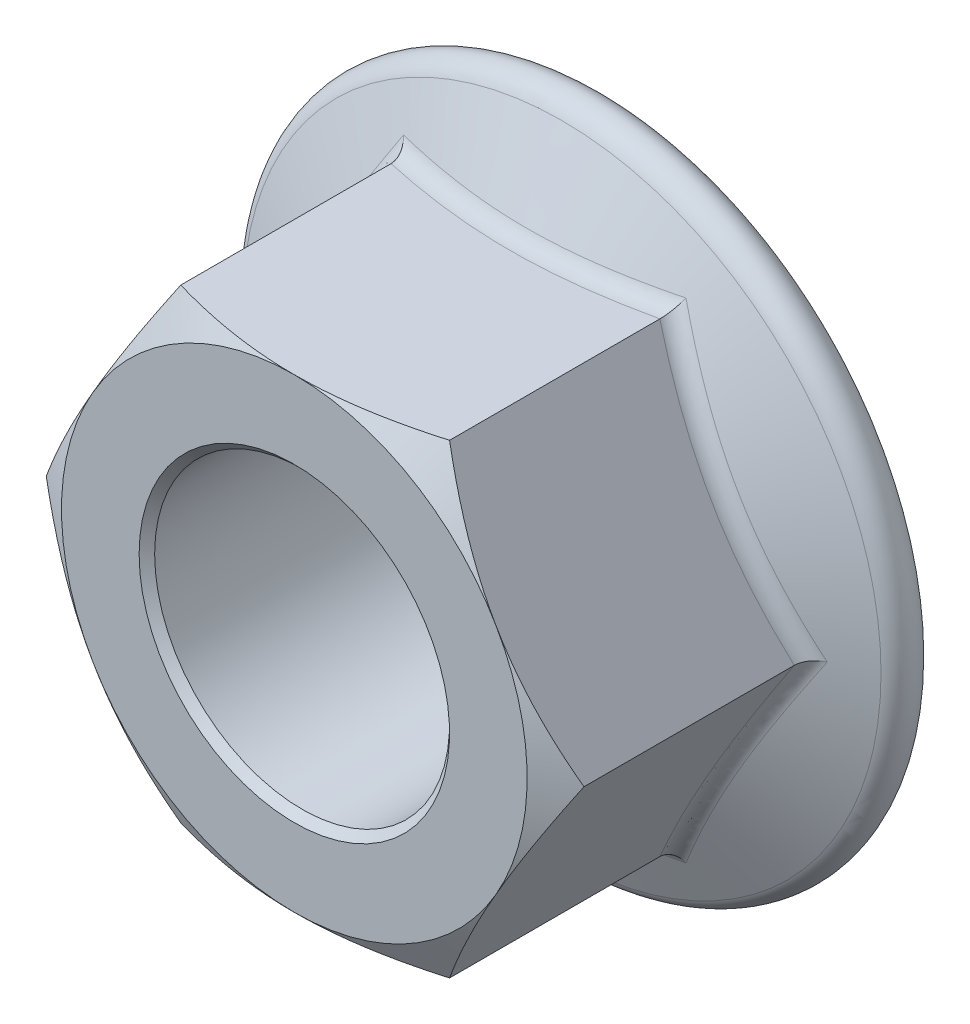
ISO-10303-21;
HEADER;
FILE_DESCRIPTION(('STEP AP214'),'2;1');
FILE_NAME('part.step','',(''),(''),'','','');
FILE_SCHEMA(('AUTOMOTIVE_DESIGN { 1 0 10303 214 1 1 1 1 }'));
ENDSEC;
DATA;
#1=APPLICATION_CONTEXT('core data for automotive mechanical design processes');
#2=APPLICATION_PROTOCOL_DEFINITION('international standard','automotive_design',2000,#1);
#3=PRODUCT_CONTEXT('',#1,'mechanical');
#4=PRODUCT('Part','Part','',(#3));
#5=PRODUCT_RELATED_PRODUCT_CATEGORY('part','',(#4));
#6=PRODUCT_DEFINITION_FORMATION('','',#4);
#7=PRODUCT_DEFINITION_CONTEXT('part definition',#1,'design');
#8=PRODUCT_DEFINITION('design','',#6,#7);
#9=PRODUCT_DEFINITION_SHAPE('','',#8);
#10=(LENGTH_UNIT() NAMED_UNIT(*) SI_UNIT(.MILLI.,.METRE.));
#11=(NAMED_UNIT(*) PLANE_ANGLE_UNIT() SI_UNIT($,.RADIAN.));
#12=(NAMED_UNIT(*) SI_UNIT($,.STERADIAN.) SOLID_ANGLE_UNIT());
#13=UNCERTAINTY_MEASURE_WITH_UNIT(LENGTH_MEASURE(1.E-05),#10,'distance_accuracy_value','');
#14=(GEOMETRIC_REPRESENTATION_CONTEXT(3) GLOBAL_UNCERTAINTY_ASSIGNED_CONTEXT((#13)) GLOBAL_UNIT_ASSIGNED_CONTEXT((#10,
#11,#12)) REPRESENTATION_CONTEXT('',''));
#15=CARTESIAN_POINT('',(0.,0.,0.));
#16=DIRECTION('',(0.,0.,1.));
#17=DIRECTION('',(1.,0.,0.));
#18=AXIS2_PLACEMENT_3D('',#15,#16,#17);
#19=CARTESIAN_POINT('',(-8.66025403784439,-15.,-20.));
#20=DIRECTION('',(0.,-1.,0.));
#21=DIRECTION('',(1.,0.,0.));
#22=AXIS2_PLACEMENT_3D('',#19,#20,#21);
#23=PLANE('',#22);
#24=DIRECTION('',(0.,0.,1.));
#25=VECTOR('',#24,1.);
#26=CARTESIAN_POINT('',(-8.66025403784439,-15.,-20.));
#27=LINE('',#26,#25);
#28=CARTESIAN_POINT('',(-8.66025403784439,-15.,-14.889067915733));
#29=VERTEX_POINT('',#28);
#30=CARTESIAN_POINT('',(-8.66025403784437,-15.,-1.33974596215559));
#31=VERTEX_POINT('',#30);
#32=EDGE_CURVE('E147',#29,#31,#27,.T.);
#33=ORIENTED_EDGE('',*,*,#32,.F.);
#34=CARTESIAN_POINT('',(-13.2562194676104,-15.,-16.0841712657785));
#35=CARTESIAN_POINT('',(-13.0142086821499,-15.,-16.9036968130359));
#36=CARTESIAN_POINT('',(-12.9350537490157,-15.8075136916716,-17.1717406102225));
#37=CARTESIAN_POINT('',(-12.711553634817,-15.,-15.9233825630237));
#38=CARTESIAN_POINT('',(-12.4776326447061,-15.,-16.7399461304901));
#39=CARTESIAN_POINT('',(-12.3982880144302,-15.8010581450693,-17.0109519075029));
#40=CARTESIAN_POINT('',(-12.1652498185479,-15.,-15.7679405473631));
#41=CARTESIAN_POINT('',(-11.9386326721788,-15.,-16.581118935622));
#42=CARTESIAN_POINT('',(-11.8605004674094,-15.7944791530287,-16.8555098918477));
#43=CARTESIAN_POINT('',(-11.0689276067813,-15.,-15.4699923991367));
#44=CARTESIAN_POINT('',(-10.8577863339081,-15.,-16.2765193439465));
#45=CARTESIAN_POINT('',(-10.7825991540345,-15.7812643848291,-16.557561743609));
#46=CARTESIAN_POINT('',(-10.5189079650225,-15.,-15.3274908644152));
#47=CARTESIAN_POINT('',(-10.3159538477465,-15.,-16.130699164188));
#48=CARTESIAN_POINT('',(-10.242484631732,-15.7746285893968,-16.4150602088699));
#49=CARTESIAN_POINT('',(-9.41282498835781,-15.,-15.0572272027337));
#50=CARTESIAN_POINT('',(-9.22718803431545,-15.,-15.8539908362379));
#51=CARTESIAN_POINT('',(-9.1577949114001,-15.7614680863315,-16.1447965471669));
#52=CARTESIAN_POINT('',(-8.8567460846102,-15.,-14.9295282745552));
#53=CARTESIAN_POINT('',(-8.68018565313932,-15.,-15.7230864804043));
#54=CARTESIAN_POINT('',(-8.61321050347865,-15.7549439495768,-16.0170976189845));
#55=CARTESIAN_POINT('',(-7.74075904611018,-15.,-14.6922672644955));
#56=CARTESIAN_POINT('',(-7.58337244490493,-15.,-15.4797854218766));
#57=CARTESIAN_POINT('',(-7.52185450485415,-15.7423264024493,-15.7798366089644));
#58=CARTESIAN_POINT('',(-7.18085128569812,-15.,-14.5827034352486));
#59=CARTESIAN_POINT('',(-7.03341857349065,-15.,-15.3672823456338));
#60=CARTESIAN_POINT('',(-6.97508313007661,-15.7362329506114,-15.670272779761));
#61=CARTESIAN_POINT('',(-6.07246061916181,-15.,-14.3872175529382));
#62=CARTESIAN_POINT('',(-5.94568887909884,-15.,-15.1665218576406));
#63=CARTESIAN_POINT('',(-5.8942181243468,-15.724987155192,-15.4747868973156));
#64=CARTESIAN_POINT('',(-5.52407696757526,-15.,-14.3007374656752));
#65=CARTESIAN_POINT('',(-5.40779071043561,-15.,-15.0775864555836));
#66=CARTESIAN_POINT('',(-5.36018039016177,-15.7198138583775,-15.38830680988));
#67=CARTESIAN_POINT('',(-4.42420547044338,-15.,-14.150200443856));
#68=CARTESIAN_POINT('',(-4.32992237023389,-15.,-14.9228043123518));
#69=CARTESIAN_POINT('',(-4.2903882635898,-15.7105789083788,-15.237769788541));
#70=CARTESIAN_POINT('',(-3.87271761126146,-15.,-14.0861436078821));
#71=CARTESIAN_POINT('',(-3.78959703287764,-15.,-14.8568427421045));
#72=CARTESIAN_POINT('',(-3.75463386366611,-15.706517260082,-15.1737129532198));
#73=CARTESIAN_POINT('',(-2.76851720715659,-15.,-13.9827718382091));
#74=CARTESIAN_POINT('',(-2.70866149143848,-15.,-14.7504534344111));
#75=CARTESIAN_POINT('',(-2.68293132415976,-15.6998578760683,-15.0703411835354));
#76=CARTESIAN_POINT('',(-2.21580933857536,-15.,-13.9434075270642));
#77=CARTESIAN_POINT('',(-2.16759428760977,-15.,-14.7098796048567));
#78=CARTESIAN_POINT('',(-2.14698572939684,-15.6972572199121,-15.0309768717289));
#79=CARTESIAN_POINT('',(-1.10914769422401,-15.,-13.8907290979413));
#80=CARTESIAN_POINT('',(-1.08502100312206,-15.,-14.6556301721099));
#81=CARTESIAN_POINT('',(-1.07442713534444,-15.6937579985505,-14.9782984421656));
#82=CARTESIAN_POINT('',(-0.555193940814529,-15.,-13.87741451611));
#83=CARTESIAN_POINT('',(-0.542974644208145,-15.,-14.6418994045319));
#84=CARTESIAN_POINT('',(-0.537814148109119,-15.6928594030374,-14.9649838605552));
#85=CARTESIAN_POINT('',(0.554023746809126,-15.,-13.8773750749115));
#86=CARTESIAN_POINT('',(0.541829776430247,-15.,-14.6418588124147));
#87=CARTESIAN_POINT('',(0.536680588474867,-15.6928567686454,-14.9649444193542));
#88=CARTESIAN_POINT('',(1.10928768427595,-15.,-13.8907131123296));
#89=CARTESIAN_POINT('',(1.08515929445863,-15.,-14.655613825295));
#90=CARTESIAN_POINT('',(1.07456234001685,-15.693756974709,-14.9782824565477));
#91=CARTESIAN_POINT('',(2.21856297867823,-15.,-13.9435613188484));
#92=CARTESIAN_POINT('',(2.17028974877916,-15.,-14.7100380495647));
#93=CARTESIAN_POINT('',(2.14965498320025,-15.6972673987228,-15.0311306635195));
#94=CARTESIAN_POINT('',(2.77257431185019,-15.,-13.9830719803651));
#95=CARTESIAN_POINT('',(2.71263477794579,-15.,-14.7507628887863));
#96=CARTESIAN_POINT('',(2.68686586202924,-15.699877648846,-15.0706413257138));
#97=CARTESIAN_POINT('',(3.87937492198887,-15.,-14.0868474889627));
#98=CARTESIAN_POINT('',(3.79611896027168,-15.,-14.8575674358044));
#99=CARTESIAN_POINT('',(3.76109843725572,-15.7065621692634,-15.1744168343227));
#100=CARTESIAN_POINT('',(4.43215947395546,-15.,-14.1511621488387));
#101=CARTESIAN_POINT('',(4.33771803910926,-15.,-14.9237944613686));
#102=CARTESIAN_POINT('',(4.29811756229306,-15.7106393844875,-15.2387314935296));
#103=CARTESIAN_POINT('',(5.53460601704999,-15.,-14.3023077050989));
#104=CARTESIAN_POINT('',(5.41811741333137,-15.,-15.079201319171));
#105=CARTESIAN_POINT('',(5.37042879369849,-15.7199086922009,-15.3898770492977));
#106=CARTESIAN_POINT('',(6.08426802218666,-15.,-14.3891385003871));
#107=CARTESIAN_POINT('',(5.95727475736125,-15.,-15.1684968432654));
#108=CARTESIAN_POINT('',(5.90572090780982,-15.7251007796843,-15.4767078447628));
#109=CARTESIAN_POINT('',(7.19527000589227,-15.,-14.5854164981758));
#110=CARTESIAN_POINT('',(7.04757990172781,-15.,-15.3700687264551));
#111=CARTESIAN_POINT('',(6.98915577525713,-15.73638575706,-15.67298584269));
#112=CARTESIAN_POINT('',(7.756509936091,-15.,-14.6954252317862));
#113=CARTESIAN_POINT('',(7.5988498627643,-15.,-15.4830272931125));
#114=CARTESIAN_POINT('',(7.53724217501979,-15.7424996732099,-15.7829945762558));
#115=CARTESIAN_POINT('',(8.87514240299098,-15.,-14.9336360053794));
#116=CARTESIAN_POINT('',(8.69828063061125,-15.,-15.7272985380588));
#117=CARTESIAN_POINT('',(8.63121688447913,-15.7551568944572,-16.0212053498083));
#118=CARTESIAN_POINT('',(9.43253456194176,-15.,-15.0618398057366));
#119=CARTESIAN_POINT('',(9.24658443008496,-15.,-15.8587181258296));
#120=CARTESIAN_POINT('',(9.1771049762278,-15.7617002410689,-16.1494091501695));
#121=CARTESIAN_POINT('',(10.541209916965,-15.,-15.3331508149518));
#122=CARTESIAN_POINT('',(10.337923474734,-15.,-16.1364932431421));
#123=CARTESIAN_POINT('',(10.2643741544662,-15.7748964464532,-16.4207201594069));
#124=CARTESIAN_POINT('',(11.0925088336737,-15.,-15.4761943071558));
#125=CARTESIAN_POINT('',(10.8810272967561,-15.,-16.2828647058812));
#126=CARTESIAN_POINT('',(10.8057645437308,-15.7815487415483,-16.563763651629));
#127=CARTESIAN_POINT('',(12.1913752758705,-15.,-15.7752555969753));
#128=CARTESIAN_POINT('',(11.9644062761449,-15.,-16.5885951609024));
#129=CARTESIAN_POINT('',(11.8862075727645,-15.7947936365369,-16.8628249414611));
#130=CARTESIAN_POINT('',(12.7389440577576,-15.,-15.9312687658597));
#131=CARTESIAN_POINT('',(12.5046665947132,-15.,-16.7480018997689));
#132=CARTESIAN_POINT('',(12.4252609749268,-15.8013862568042,-17.0188381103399));
#133=CARTESIAN_POINT('',(13.2848699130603,-15.,-16.0926373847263));
#134=CARTESIAN_POINT('',(13.0424944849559,-15.,-16.9123380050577));
#135=CARTESIAN_POINT('',(12.9632889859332,-15.8078538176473,-17.1802067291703));
#136=(BOUNDED_SURFACE() B_SPLINE_SURFACE(3,2,((#34,#35,#36),(#37,#38,#39),(#40,#41,#42),(#43,
#44,#45),(#46,#47,#48),(#49,#50,#51),(#52,#53,#54),(#55,#56,#57),(#58,#59,#60),(#61,#62,#63),
(#64,#65,#66),(#67,#68,#69),(#70,#71,#72),(#73,#74,#75),(#76,#77,#78),(#79,#80,#81),(#82,#83,
#84),(#85,#86,#87),(#88,#89,#90),(#91,#92,#93),(#94,#95,#96),(#97,#98,#99),(#100,#101,#102),
(#103,#104,#105),(#106,#107,#108),(#109,#110,#111),(#112,#113,#114),(#115,#116,#117),(#118,#119,
#120),(#121,#122,#123),(#124,#125,#126),(#127,#128,#129),(#130,#131,#132),(#133,#134,#135)),
.UNSPECIFIED.,.F.,.F.,.F.) B_SPLINE_SURFACE_WITH_KNOTS((4,2,2,2,2,2,2,2,2,2,2,2,2,2,2,2,4),(3,
3),(0.,1.70376719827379,3.40813740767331,5.11953535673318,6.83076831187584,8.49583868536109,
10.1609163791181,11.8226537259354,13.4843614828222,15.1499952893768,16.8156604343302,
18.4846882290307,20.1537085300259,21.8691183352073,23.5846942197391,25.2931870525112,
27.0010727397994),(0.,1.),
.UNSPECIFIED.) GEOMETRIC_REPRESENTATION_ITEM() RATIONAL_B_SPLINE_SURFACE(((1.,0.814577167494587,
1.),(1.,0.816228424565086,1.),(1.,0.817905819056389,1.),(1.,0.82126482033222,1.),(1.,
0.822946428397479,1.),(1.,0.82627139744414,1.),(1.,0.827914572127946,1.),(1.,0.831083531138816,
1.),(1.,0.832609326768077,1.),(1.,0.835418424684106,1.),(1.,0.836707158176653,1.),(1.,
0.839003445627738,1.),(1.,0.840010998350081,1.),(1.,0.841661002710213,1.),(1.,0.842304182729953,
1.),(1.,0.843169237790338,1.),(1.,0.843391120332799,1.),(1.,0.843391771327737,1.),(1.,
0.843169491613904,1.),(1.,0.842301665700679,1.),(1.,0.841656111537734,1.),(1.,0.83999986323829,
1.),(1.,0.838988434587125,1.),(1.,0.836683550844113,1.),(1.,0.835390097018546,1.),(1.,
0.832571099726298,1.),(1.,0.831040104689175,1.),(1.,0.827860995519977,1.),(1.,0.826212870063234,
1.),(1.,0.822878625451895,1.),(1.,0.821192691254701,1.),(1.,0.817825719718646,1.),(1.,
0.816144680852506,1.),(1.,0.814490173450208,1.))) REPRESENTATION_ITEM('') SURFACE());
#137=CARTESIAN_POINT('',(-13.2562194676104,-15.,-16.0841712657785));
#138=CARTESIAN_POINT('',(-12.711553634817,-15.,-15.9233825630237));
#139=CARTESIAN_POINT('',(-12.1652498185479,-15.,-15.7679405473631));
#140=CARTESIAN_POINT('',(-11.0689276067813,-15.,-15.4699923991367));
#141=CARTESIAN_POINT('',(-10.5189079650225,-15.,-15.3274908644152));
#142=CARTESIAN_POINT('',(-9.41282498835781,-15.,-15.0572272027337));
#143=CARTESIAN_POINT('',(-8.8567460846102,-15.,-14.9295282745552));
#144=CARTESIAN_POINT('',(-7.74075904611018,-15.,-14.6922672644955));
#145=CARTESIAN_POINT('',(-7.18085128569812,-15.,-14.5827034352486));
#146=CARTESIAN_POINT('',(-6.07246061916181,-15.,-14.3872175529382));
#147=CARTESIAN_POINT('',(-5.52407696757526,-15.,-14.3007374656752));
#148=CARTESIAN_POINT('',(-4.42420547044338,-15.,-14.150200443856));
#149=CARTESIAN_POINT('',(-3.87271761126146,-15.,-14.0861436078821));
#150=CARTESIAN_POINT('',(-2.76851720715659,-15.,-13.9827718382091));
#151=CARTESIAN_POINT('',(-2.21580933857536,-15.,-13.9434075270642));
#152=CARTESIAN_POINT('',(-1.10914769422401,-15.,-13.8907290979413));
#153=CARTESIAN_POINT('',(-0.555193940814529,-15.,-13.87741451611));
#154=CARTESIAN_POINT('',(0.554023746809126,-15.,-13.8773750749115));
#155=CARTESIAN_POINT('',(1.10928768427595,-15.,-13.8907131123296));
#156=CARTESIAN_POINT('',(2.21856297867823,-15.,-13.9435613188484));
#157=CARTESIAN_POINT('',(2.77257431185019,-15.,-13.9830719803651));
#158=CARTESIAN_POINT('',(3.87937492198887,-15.,-14.0868474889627));
#159=CARTESIAN_POINT('',(4.43215947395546,-15.,-14.1511621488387));
#160=CARTESIAN_POINT('',(5.53460601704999,-15.,-14.3023077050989));
#161=CARTESIAN_POINT('',(6.08426802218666,-15.,-14.3891385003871));
#162=CARTESIAN_POINT('',(7.19527000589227,-15.,-14.5854164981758));
#163=CARTESIAN_POINT('',(7.756509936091,-15.,-14.6954252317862));
#164=CARTESIAN_POINT('',(8.87514240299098,-15.,-14.9336360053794));
#165=CARTESIAN_POINT('',(9.43253456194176,-15.,-15.0618398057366));
#166=CARTESIAN_POINT('',(10.541209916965,-15.,-15.3331508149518));
#167=CARTESIAN_POINT('',(11.0925088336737,-15.,-15.4761943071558));
#168=CARTESIAN_POINT('',(12.1913752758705,-15.,-15.7752555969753));
#169=CARTESIAN_POINT('',(12.7389440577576,-15.,-15.9312687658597));
#170=CARTESIAN_POINT('',(13.2848699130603,-15.,-16.0926373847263));
#171=B_SPLINE_CURVE_WITH_KNOTS('',3,(#137,#138,#139,#140,#141,#142,#143,#144,#145,#146,#147,
#148,#149,#150,#151,#152,#153,#154,#155,#156,#157,#158,#159,#160,#161,#162,#163,#164,#165,#166,
#167,#168,#169,#170),.UNSPECIFIED.,.F.,.F.,(4,2,2,2,2,2,2,2,2,2,2,2,2,2,2,2,4),(0.,
1.70376719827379,3.40813740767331,5.11953535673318,6.83076831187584,8.49583868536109,
10.1609163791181,11.8226537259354,13.4843614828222,15.1499952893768,16.8156604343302,
18.4846882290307,20.1537085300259,21.8691183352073,23.5846942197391,25.2931870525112,
27.0010727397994),.UNSPECIFIED.);
#172=CARTESIAN_POINT('',(8.66025403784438,-15.,-14.889067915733));
#173=VERTEX_POINT('',#172);
#174=EDGE_CURVE('E416',#29,#173,#171,.T.);
#175=ORIENTED_EDGE('',*,*,#174,.T.);
#176=DIRECTION('',(0.,0.,1.));
#177=VECTOR('',#176,1.);
#178=CARTESIAN_POINT('',(8.66025403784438,-15.,-20.));
#179=LINE('',#178,#177);
#180=CARTESIAN_POINT('',(8.66025403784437,-15.,-1.3397459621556));
#181=VERTEX_POINT('',#180);
#182=EDGE_CURVE('E537',#173,#181,#179,.T.);
#183=ORIENTED_EDGE('',*,*,#182,.T.);
#184=CARTESIAN_POINT('',(-22.9682699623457,-15.,-7.17790057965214));
#185=CARTESIAN_POINT('',(-22.6389897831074,-15.,-7.01873142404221));
#186=CARTESIAN_POINT('',(-22.3093116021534,-15.,-6.86038603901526));
#187=CARTESIAN_POINT('',(-21.6490751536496,-15.,-6.54553189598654));
#188=CARTESIAN_POINT('',(-21.3185168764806,-15.,-6.3890231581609));
#189=CARTESIAN_POINT('',(-20.3252989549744,-15.,-5.92249019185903));
#190=CARTESIAN_POINT('',(-19.6612032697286,-15.,-5.61551110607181));
#191=CARTESIAN_POINT('',(-18.3246226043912,-15.,-5.00989859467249));
#192=CARTESIAN_POINT('',(-17.6521113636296,-15.,-4.71132298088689));
#193=CARTESIAN_POINT('',(-16.3015621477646,-15.,-4.126991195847));
#194=CARTESIAN_POINT('',(-15.6235244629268,-15.,-3.84123435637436));
#195=CARTESIAN_POINT('',(-14.2524269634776,-15.,-3.28256457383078));
#196=CARTESIAN_POINT('',(-13.5592849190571,-15.,-3.00985238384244));
#197=CARTESIAN_POINT('',(-12.1648203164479,-15.,-2.48578579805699));
#198=CARTESIAN_POINT('',(-11.4634968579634,-15.,-2.23443377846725));
#199=CARTESIAN_POINT('',(-10.0530172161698,-15.,-1.75984469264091));
#200=CARTESIAN_POINT('',(-9.34388131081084,-15.,-1.53654785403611));
#201=CARTESIAN_POINT('',(-7.91545988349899,-15.,-1.12531011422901));
#202=CARTESIAN_POINT('',(-7.19617764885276,-15.,-0.937358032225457));
#203=CARTESIAN_POINT('',(-6.10950776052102,-15.,-0.688818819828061));
#204=CARTESIAN_POINT('',(-5.74591626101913,-15.,-0.611524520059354));
#205=CARTESIAN_POINT('',(-5.01631310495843,-15.,-0.469286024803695));
#206=CARTESIAN_POINT('',(-4.65030150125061,-15.,-0.404341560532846));
#207=CARTESIAN_POINT('',(-3.91609659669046,-15.,-0.287952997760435));
#208=CARTESIAN_POINT('',(-3.5479031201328,-15.,-0.236510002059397));
#209=CARTESIAN_POINT('',(-2.80977894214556,-15.,-0.148161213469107));
#210=CARTESIAN_POINT('',(-2.43984831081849,-15.,-0.111254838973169));
#211=CARTESIAN_POINT('',(-1.70111543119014,-15.,-0.0529692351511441));
#212=CARTESIAN_POINT('',(-1.3323208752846,-15.,-0.0314931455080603));
#213=CARTESIAN_POINT('',(-0.594154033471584,-15.,-0.0041821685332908));
#214=CARTESIAN_POINT('',(-0.224781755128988,-15.,0.00165292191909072));
#215=CARTESIAN_POINT('',(0.513772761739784,-15.,-0.00245653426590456));
#216=CARTESIAN_POINT('',(0.882955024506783,-15.,-0.0123966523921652));
#217=CARTESIAN_POINT('',(1.62057875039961,-15.,-0.0478095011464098));
#218=CARTESIAN_POINT('',(1.98902017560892,-15.,-0.0732830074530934));
#219=CARTESIAN_POINT('',(2.88200878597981,-15.,-0.153315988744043));
#220=CARTESIAN_POINT('',(3.40586988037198,-15.,-0.215658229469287));
#221=CARTESIAN_POINT('',(4.44957771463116,-15.,-0.368284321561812));
#222=CARTESIAN_POINT('',(4.96942331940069,-15.,-0.458575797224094));
#223=CARTESIAN_POINT('',(6.00467140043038,-15.,-0.663898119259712));
#224=CARTESIAN_POINT('',(6.52006919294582,-15.,-0.77895235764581));
#225=CARTESIAN_POINT('',(7.54556200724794,-15.,-1.030289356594));
#226=CARTESIAN_POINT('',(8.0556575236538,-15.,-1.16657011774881));
#227=CARTESIAN_POINT('',(9.08310964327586,-15.,-1.46066370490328));
#228=CARTESIAN_POINT('',(9.60033774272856,-15.,-1.6189224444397));
#229=CARTESIAN_POINT('',(10.6293258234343,-15.,-1.95107200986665));
#230=CARTESIAN_POINT('',(11.1410893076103,-15.,-2.12495205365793));
#231=CARTESIAN_POINT('',(12.1570993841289,-15.,-2.48477464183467));
#232=CARTESIAN_POINT('',(12.6613720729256,-15.,-2.67064378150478));
#233=CARTESIAN_POINT('',(13.4147912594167,-15.,-2.95756327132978));
#234=CARTESIAN_POINT('',(13.6654863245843,-15.,-3.05457748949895));
#235=CARTESIAN_POINT('',(14.1659013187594,-15.,-3.25107322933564));
#236=CARTESIAN_POINT('',(14.4156212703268,-15.,-3.35055469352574));
#237=CARTESIAN_POINT('',(14.6648887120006,-15.,-3.45115877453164));
#238=B_SPLINE_CURVE_WITH_KNOTS('',3,(#184,#185,#186,#187,#188,#189,#190,#191,#192,#193,#194,
#195,#196,#197,#198,#199,#200,#201,#202,#203,#204,#205,#206,#207,#208,#209,#210,#211,#212,#213,
#214,#215,#216,#217,#218,#219,#220,#221,#222,#223,#224,#225,#226,#227,#228,#229,#230,#231,#232,
#233,#234,#235,#236,#237),.UNSPECIFIED.,.F.,.F.,(4,2,2,2,2,2,2,2,2,2,2,2,2,2,2,2,2,2,2,2,2,2,2,
2,2,2,4),(0.,1.09719534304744,2.19440272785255,4.38917437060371,6.596505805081,8.80372204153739,
11.0380360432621,13.2725982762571,15.5023159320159,17.7313270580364,18.8463006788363,
19.9612500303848,21.0762904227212,22.1912861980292,23.2992201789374,24.407139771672,
25.5147483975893,26.6224123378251,28.2042036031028,29.7864267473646,31.3701511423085,
32.9537264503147,34.5761185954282,36.1973994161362,37.8095545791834,38.6159794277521,
39.4223855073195),.UNSPECIFIED.);
#239=CARTESIAN_POINT('',(0.,-15.,0.));
#240=VERTEX_POINT('',#239);
#241=EDGE_CURVE('E221',#240,#181,#238,.T.);
#242=ORIENTED_EDGE('',*,*,#241,.F.);
#243=EDGE_CURVE('E226',#31,#240,#238,.T.);
#244=ORIENTED_EDGE('',*,*,#243,.F.);
#245=EDGE_LOOP('',(#33,#175,#183,#242,#244));
#246=FACE_BOUND('',#245,.T.);
#247=ADVANCED_FACE('F41',(#246),#23,.T.);
#248=CARTESIAN_POINT('',(-17.3205080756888,0.,-20.));
#249=DIRECTION('',(-0.866025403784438,-0.5,0.));
#250=DIRECTION('',(0.5,-0.866025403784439,0.));
#251=AXIS2_PLACEMENT_3D('',#248,#249,#250);
#252=PLANE('',#251);
#253=DIRECTION('',(0.,0.,1.));
#254=VECTOR('',#253,1.);
#255=CARTESIAN_POINT('',(-17.3205080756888,0.,-20.));
#256=LINE('',#255,#254);
#257=CARTESIAN_POINT('',(-17.3205080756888,0.,-14.889067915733));
#258=VERTEX_POINT('',#257);
#259=CARTESIAN_POINT('',(-17.3205080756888,0.,-1.33974596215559));
#260=VERTEX_POINT('',#259);
#261=EDGE_CURVE('E140',#258,#260,#256,.T.);
#262=ORIENTED_EDGE('',*,*,#261,.F.);
#263=CARTESIAN_POINT('',(-19.586963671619,3.92561624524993,-16.0655775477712));
#264=CARTESIAN_POINT('',(-19.4663607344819,3.71672583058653,-16.884717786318));
#265=CARTESIAN_POINT('',(-20.125518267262,3.24489093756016,-17.1531468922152));
#266=CARTESIAN_POINT('',(-19.3166826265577,3.45747574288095,-15.9064549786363));
#267=CARTESIAN_POINT('',(-19.2001040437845,3.25555571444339,-16.7226516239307));
#268=CARTESIAN_POINT('',(-19.8536259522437,2.78678610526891,-16.9940243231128));
#269=CARTESIAN_POINT('',(-19.0455921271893,2.98793322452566,-15.7526340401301));
#270=CARTESIAN_POINT('',(-18.9326510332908,2.79231351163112,-16.5654726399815));
#271=CARTESIAN_POINT('',(-19.5811259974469,2.3278671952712,-16.8402033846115));
#272=CARTESIAN_POINT('',(-18.5015795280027,2.04567576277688,-15.4577952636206));
#273=CARTESIAN_POINT('',(-18.3963425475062,1.86339996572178,-16.2640376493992));
#274=CARTESIAN_POINT('',(-19.034936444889,1.40807023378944,-16.5453646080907));
#275=CARTESIAN_POINT('',(-18.2286568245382,1.57295977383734,-15.3167818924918));
#276=CARTESIAN_POINT('',(-18.1274930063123,1.39773890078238,-16.1197341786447));
#277=CARTESIAN_POINT('',(-18.7612464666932,0.94719155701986,-16.4043512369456));
#278=CARTESIAN_POINT('',(-17.6798459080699,0.622391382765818,-15.0493314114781));
#279=CARTESIAN_POINT('',(-17.5872936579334,0.462086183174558,-15.8458961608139));
#280=CARTESIAN_POINT('',(-18.2117814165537,0.0215920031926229,-16.1369007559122));
#281=CARTESIAN_POINT('',(-17.4039501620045,0.144525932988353,-14.922955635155));
#282=CARTESIAN_POINT('',(-17.3159092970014,-0.00796531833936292,-15.7163447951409));
#283=CARTESIAN_POINT('',(-17.9360023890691,-0.443136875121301,-16.0105249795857));
#284=CARTESIAN_POINT('',(-16.8502740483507,-0.814469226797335,-14.6880992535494));
#285=CARTESIAN_POINT('',(-16.7717588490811,-0.95046154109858,-15.4755041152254));
#286=CARTESIAN_POINT('',(-17.3837396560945,-1.37467302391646,-15.7756685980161));
#287=CARTESIAN_POINT('',(-16.5724938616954,-1.29559862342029,-14.5796169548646));
#288=CARTESIAN_POINT('',(-16.4989221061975,-1.42302864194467,-15.3641105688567));
#289=CARTESIAN_POINT('',(-17.1072560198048,-1.84148009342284,-15.6671862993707));
#290=CARTESIAN_POINT('',(-16.0225443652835,-2.24813909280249,-14.3859363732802));
#291=CARTESIAN_POINT('',(-15.9592302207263,-2.35780240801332,-15.1652022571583));
#292=CARTESIAN_POINT('',(-16.5613204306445,-2.76477257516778,-15.4735057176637));
#293=CARTESIAN_POINT('',(-15.7504234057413,-2.71946642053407,-14.3001934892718));
#294=CARTESIAN_POINT('',(-15.6923146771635,-2.82011369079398,-15.0770255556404));
#295=CARTESIAN_POINT('',(-16.2918779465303,-3.2212005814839,-15.3877628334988));
#296=CARTESIAN_POINT('',(-15.2046530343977,-3.66476843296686,-14.1507918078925));
#297=CARTESIAN_POINT('',(-15.1574624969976,-3.74650484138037,-14.9234107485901));
#298=CARTESIAN_POINT('',(-15.7530958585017,-4.13606800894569,-15.2383611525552));
#299=CARTESIAN_POINT('',(-14.9310036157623,-4.13874312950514,-14.087133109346));
#300=CARTESIAN_POINT('',(-14.889352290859,-4.21088534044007,-14.8578604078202));
#301=CARTESIAN_POINT('',(-15.4837562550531,-4.59450743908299,-15.1747024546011));
#302=CARTESIAN_POINT('',(-14.3830923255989,-5.08775332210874,-13.9841681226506));
#303=CARTESIAN_POINT('',(-14.3529813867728,-5.13990699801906,-14.7518903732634));
#304=CARTESIAN_POINT('',(-14.9462203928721,-5.51228457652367,-15.0717374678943));
#305=CARTESIAN_POINT('',(-14.1088327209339,-5.56278489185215,-13.9448141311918));
#306=CARTESIAN_POINT('',(-14.0844976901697,-5.6049344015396,-14.7113282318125));
#307=CARTESIAN_POINT('',(-14.6780229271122,-5.9716187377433,-15.0323834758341));
#308=CARTESIAN_POINT('',(-13.5596909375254,-6.51392636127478,-13.8917477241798));
#309=CARTESIAN_POINT('',(-13.5473047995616,-6.53537978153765,-14.6566795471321));
#310=CARTESIAN_POINT('',(-14.1427437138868,-6.89170174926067,-14.9793170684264));
#311=CARTESIAN_POINT('',(-13.2848087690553,-6.99003624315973,-13.8780348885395));
#312=CARTESIAN_POINT('',(-13.2783319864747,-7.00125435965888,-14.6425383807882));
#313=CARTESIAN_POINT('',(-13.8756619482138,-7.35245057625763,-14.9656042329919));
#314=CARTESIAN_POINT('',(-12.7327569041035,-7.94621812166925,-13.8767935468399));
#315=CARTESIAN_POINT('',(-12.7384304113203,-7.93639131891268,-14.6412598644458));
#316=CARTESIAN_POINT('',(-13.3408192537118,-8.27865873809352,-14.9643628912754));
#317=CARTESIAN_POINT('',(-12.4555870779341,-8.42629034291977,-13.8894823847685));
#318=CARTESIAN_POINT('',(-12.4672197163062,-8.40614202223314,-14.6543453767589));
#319=CARTESIAN_POINT('',(-13.0730709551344,-8.74412553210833,-14.9770517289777));
#320=CARTESIAN_POINT('',(-11.9018569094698,-9.38537912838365,-13.9409693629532));
#321=CARTESIAN_POINT('',(-11.9255486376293,-9.34434385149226,-14.7073683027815));
#322=CARTESIAN_POINT('',(-12.5393803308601,-9.67534824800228,-15.0285387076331));
#323=CARTESIAN_POINT('',(-11.6252965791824,-9.86439567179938,-13.9797680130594));
#324=CARTESIAN_POINT('',(-11.654816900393,-9.81326497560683,-14.7473598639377));
#325=CARTESIAN_POINT('',(-12.2734380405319,-10.1411041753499,-15.0673373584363));
#326=CARTESIAN_POINT('',(-11.0727770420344,-10.8213875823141,-14.082083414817));
#327=CARTESIAN_POINT('',(-11.1139499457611,-10.7500740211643,-14.8526638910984));
#328=CARTESIAN_POINT('',(-11.7429156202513,-11.0731906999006,-15.1696527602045));
#329=CARTESIAN_POINT('',(-10.7968201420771,-11.2993589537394,-14.1456494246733));
#330=CARTESIAN_POINT('',(-10.8435846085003,-11.2183605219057,-14.9181218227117));
#331=CARTESIAN_POINT('',(-11.4783392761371,-11.5395205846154,-15.2332187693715));
#332=CARTESIAN_POINT('',(-10.2464539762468,-12.2526211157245,-14.2952887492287));
#333=CARTESIAN_POINT('',(-10.3042434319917,-12.1525268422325,-15.071984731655));
#334=CARTESIAN_POINT('',(-10.9510132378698,-12.4712590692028,-15.3828580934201));
#335=CARTESIAN_POINT('',(-9.97204470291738,-12.727911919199,-14.3813619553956));
#336=CARTESIAN_POINT('',(-10.035088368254,-12.6187170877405,-15.1605045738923));
#337=CARTESIAN_POINT('',(-10.6882635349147,-12.9366676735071,-15.4689312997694));
#338=CARTESIAN_POINT('',(-9.41742229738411,-13.6885461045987,-14.576102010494));
#339=CARTESIAN_POINT('',(-9.4908213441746,-13.5614152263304,-15.3605048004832));
#340=CARTESIAN_POINT('',(-10.1571629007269,-13.8790009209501,-15.6636713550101));
#341=CARTESIAN_POINT('',(-9.13725867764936,-14.1738037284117,-14.6853281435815));
#342=CARTESIAN_POINT('',(-9.21564653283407,-14.0380319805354,-15.4726650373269));
#343=CARTESIAN_POINT('',(-9.88885816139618,-14.3558878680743,-15.7728974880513));
#344=CARTESIAN_POINT('',(-8.57884759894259,-15.1410000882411,-14.9219929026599));
#345=CARTESIAN_POINT('',(-8.66684700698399,-14.9885806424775,-15.7153621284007));
#346=CARTESIAN_POINT('',(-9.35372166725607,-15.3079861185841,-16.0095622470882));
#347=CARTESIAN_POINT('',(-8.30060032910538,-15.6229384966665,-15.0494333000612));
#348=CARTESIAN_POINT('',(-8.39314955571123,-15.462638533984,-15.8460060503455));
#349=CARTESIAN_POINT('',(-9.08689005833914,-15.7831972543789,-16.1370026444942));
#350=CARTESIAN_POINT('',(-7.74714281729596,-16.5815550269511,-15.3192526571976));
#351=CARTESIAN_POINT('',(-7.84837391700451,-16.4062176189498,-16.1222680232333));
#352=CARTESIAN_POINT('',(-8.55556548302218,-16.7298037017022,-16.4068220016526));
#353=CARTESIAN_POINT('',(-7.47192481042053,-17.0582465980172,-15.4615684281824));
#354=CARTESIAN_POINT('',(-7.57726039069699,-16.8758000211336,-16.2679029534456));
#355=CARTESIAN_POINT('',(-8.29106741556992,-17.2012066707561,-16.5491377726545));
#356=CARTESIAN_POINT('',(-6.92335285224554,-18.0084011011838,-15.7592035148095));
#357=CARTESIAN_POINT('',(-7.03644742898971,-17.8125155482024,-16.5721917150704));
#358=CARTESIAN_POINT('',(-7.76319186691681,-18.1419645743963,-16.8467728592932));
#359=CARTESIAN_POINT('',(-6.64999827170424,-18.481865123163,-15.9145181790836));
#360=CARTESIAN_POINT('',(-6.76675438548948,-18.2796376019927,-16.7308938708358));
#361=CARTESIAN_POINT('',(-7.4998140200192,-18.6113201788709,-17.0020875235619));
#362=CARTESIAN_POINT('',(-6.37746539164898,-18.9539059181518,-16.0752036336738));
#363=CARTESIAN_POINT('',(-6.49827703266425,-18.7446540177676,-16.8945434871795));
#364=CARTESIAN_POINT('',(-7.23684227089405,-19.0797270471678,-17.1627729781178));
#365=(BOUNDED_SURFACE() B_SPLINE_SURFACE(3,2,((#263,#264,#265),(#266,#267,#268),(#269,#270,
#271),(#272,#273,#274),(#275,#276,#277),(#278,#279,#280),(#281,#282,#283),(#284,#285,#286),
(#287,#288,#289),(#290,#291,#292),(#293,#294,#295),(#296,#297,#298),(#299,#300,#301),(#302,#303,
#304),(#305,#306,#307),(#308,#309,#310),(#311,#312,#313),(#314,#315,#316),(#317,#318,#319),
(#320,#321,#322),(#323,#324,#325),(#326,#327,#328),(#329,#330,#331),(#332,#333,#334),(#335,#336,
#337),(#338,#339,#340),(#341,#342,#343),(#344,#345,#346),(#347,#348,#349),(#350,#351,#352),
(#353,#354,#355),(#356,#357,#358),(#359,#360,#361),(#362,#363,#364)),.UNSPECIFIED.,.F.,.F.,
.F.) B_SPLINE_SURFACE_WITH_KNOTS((4,2,2,2,2,2,2,2,2,2,2,2,2,2,2,2,4),(3,3),(0.,1.69054342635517,
3.3816742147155,5.07965265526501,6.77747031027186,8.42993159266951,10.0824002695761,
11.7316152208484,13.3808031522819,15.0436212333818,16.7064717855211,18.3726464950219,
20.0388131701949,21.7510843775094,23.4635222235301,25.1689606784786,26.8737914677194),(0.,1.),
.UNSPECIFIED.) GEOMETRIC_REPRESENTATION_ITEM() RATIONAL_B_SPLINE_SURFACE(((1.,0.814768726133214,
1.),(1.,0.816408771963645,1.),(1.,0.818073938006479,1.),(1.,0.821407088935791,1.),(1.,
0.823075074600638,1.),(1.,0.826371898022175,1.),(1.,0.828000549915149,1.),(1.,0.831141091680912,
1.),(1.,0.832652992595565,1.),(1.,0.835437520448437,1.),(1.,0.836715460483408,1.),(1.,
0.838994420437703,1.),(1.,0.839995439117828,1.),(1.,0.841638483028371,1.),(1.,0.842281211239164,
1.),(1.,0.843152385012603,1.),(1.,0.843380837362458,1.),(1.,0.843401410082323,1.),(1.,
0.843189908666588,1.),(1.,0.842344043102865,1.),(1.,0.841709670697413,1.),(1.,0.840075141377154,
1.),(1.,0.839074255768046,1.),(1.,0.836788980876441,1.),(1.,0.835504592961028,1.),(1.,
0.832702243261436,1.),(1.,0.831178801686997,1.),(1.,0.828012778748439,1.),(1.,0.826370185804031,
1.),(1.,0.823045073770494,1.),(1.,0.821362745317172,1.),(1.,0.818001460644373,1.),(1.,
0.816322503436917,1.),(1.,0.814669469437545,1.))) REPRESENTATION_ITEM('') SURFACE());
#366=CARTESIAN_POINT('',(-19.586963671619,3.92561624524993,-16.0655775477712));
#367=CARTESIAN_POINT('',(-19.3166826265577,3.45747574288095,-15.9064549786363));
#368=CARTESIAN_POINT('',(-19.0455921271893,2.98793322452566,-15.7526340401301));
#369=CARTESIAN_POINT('',(-18.5015795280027,2.04567576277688,-15.4577952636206));
#370=CARTESIAN_POINT('',(-18.2286568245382,1.57295977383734,-15.3167818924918));
#371=CARTESIAN_POINT('',(-17.6798459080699,0.622391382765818,-15.0493314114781));
#372=CARTESIAN_POINT('',(-17.4039501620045,0.144525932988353,-14.922955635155));
#373=CARTESIAN_POINT('',(-16.8502740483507,-0.814469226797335,-14.6880992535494));
#374=CARTESIAN_POINT('',(-16.5724938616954,-1.29559862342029,-14.5796169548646));
#375=CARTESIAN_POINT('',(-16.0225443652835,-2.24813909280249,-14.3859363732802));
#376=CARTESIAN_POINT('',(-15.7504234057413,-2.71946642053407,-14.3001934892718));
#377=CARTESIAN_POINT('',(-15.2046530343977,-3.66476843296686,-14.1507918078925));
#378=CARTESIAN_POINT('',(-14.9310036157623,-4.13874312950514,-14.087133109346));
#379=CARTESIAN_POINT('',(-14.3830923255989,-5.08775332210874,-13.9841681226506));
#380=CARTESIAN_POINT('',(-14.1088327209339,-5.56278489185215,-13.9448141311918));
#381=CARTESIAN_POINT('',(-13.5596909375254,-6.51392636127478,-13.8917477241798));
#382=CARTESIAN_POINT('',(-13.2848087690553,-6.99003624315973,-13.8780348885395));
#383=CARTESIAN_POINT('',(-12.7327569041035,-7.94621812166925,-13.8767935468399));
#384=CARTESIAN_POINT('',(-12.4555870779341,-8.42629034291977,-13.8894823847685));
#385=CARTESIAN_POINT('',(-11.9018569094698,-9.38537912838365,-13.9409693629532));
#386=CARTESIAN_POINT('',(-11.6252965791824,-9.86439567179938,-13.9797680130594));
#387=CARTESIAN_POINT('',(-11.0727770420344,-10.8213875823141,-14.082083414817));
#388=CARTESIAN_POINT('',(-10.7968201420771,-11.2993589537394,-14.1456494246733));
#389=CARTESIAN_POINT('',(-10.2464539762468,-12.2526211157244,-14.2952887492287));
#390=CARTESIAN_POINT('',(-9.97204470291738,-12.727911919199,-14.3813619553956));
#391=CARTESIAN_POINT('',(-9.41742229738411,-13.6885461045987,-14.576102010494));
#392=CARTESIAN_POINT('',(-9.13725867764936,-14.1738037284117,-14.6853281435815));
#393=CARTESIAN_POINT('',(-8.57884759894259,-15.1410000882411,-14.9219929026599));
#394=CARTESIAN_POINT('',(-8.30060032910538,-15.6229384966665,-15.0494333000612));
#395=CARTESIAN_POINT('',(-7.74714281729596,-16.5815550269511,-15.3192526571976));
#396=CARTESIAN_POINT('',(-7.47192481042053,-17.0582465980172,-15.4615684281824));
#397=CARTESIAN_POINT('',(-6.92335285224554,-18.0084011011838,-15.7592035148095));
#398=CARTESIAN_POINT('',(-6.64999827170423,-18.481865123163,-15.9145181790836));
#399=CARTESIAN_POINT('',(-6.37746539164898,-18.9539059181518,-16.0752036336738));
#400=B_SPLINE_CURVE_WITH_KNOTS('',3,(#366,#367,#368,#369,#370,#371,#372,#373,#374,#375,#376,
#377,#378,#379,#380,#381,#382,#383,#384,#385,#386,#387,#388,#389,#390,#391,#392,#393,#394,#395,
#396,#397,#398,#399),.UNSPECIFIED.,.F.,.F.,(4,2,2,2,2,2,2,2,2,2,2,2,2,2,2,2,4),(0.,
1.69054342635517,3.3816742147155,5.07965265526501,6.77747031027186,8.42993159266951,
10.0824002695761,11.7316152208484,13.3808031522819,15.0436212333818,16.7064717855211,
18.3726464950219,20.0388131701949,21.7510843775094,23.4635222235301,25.1689606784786,
26.8737914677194),.UNSPECIFIED.);
#401=EDGE_CURVE('E430',#258,#29,#400,.T.);
#402=ORIENTED_EDGE('',*,*,#401,.T.);
#403=ORIENTED_EDGE('',*,*,#32,.T.);
#404=CARTESIAN_POINT('',(-17.3206235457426,0.000200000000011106,-1.33981262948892));
#405=CARTESIAN_POINT('',(-17.130274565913,-0.329494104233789,-1.22992178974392));
#406=CARTESIAN_POINT('',(-16.939183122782,-0.660474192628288,-1.1250175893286));
#407=CARTESIAN_POINT('',(-16.5554679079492,-1.325088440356,-0.926568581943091));
#408=CARTESIAN_POINT('',(-16.3628436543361,-1.65872343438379,-0.833027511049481));
#409=CARTESIAN_POINT('',(-15.9756905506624,-2.32929228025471,-0.65856214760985));
#410=CARTESIAN_POINT('',(-15.7811583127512,-2.666232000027,-0.577667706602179));
#411=CARTESIAN_POINT('',(-15.3907420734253,-3.34245276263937,-0.430232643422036));
#412=CARTESIAN_POINT('',(-15.1948581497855,-3.6817336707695,-0.36369120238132));
#413=CARTESIAN_POINT('',(-14.8067578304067,-4.3539431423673,-0.247792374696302));
#414=CARTESIAN_POINT('',(-14.6145702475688,-4.68682180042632,-0.198051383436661));
#415=CARTESIAN_POINT('',(-14.2293144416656,-5.35410443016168,-0.114646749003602));
#416=CARTESIAN_POINT('',(-14.0362462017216,-5.68850843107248,-0.0809834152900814));
#417=CARTESIAN_POINT('',(-13.6497853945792,-6.35787818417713,-0.030584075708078));
#418=CARTESIAN_POINT('',(-13.4563934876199,-6.69284279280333,-0.0138279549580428));
#419=CARTESIAN_POINT('',(-13.0694311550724,-7.36308121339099,0.00239660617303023));
#420=CARTESIAN_POINT('',(-12.8758607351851,-7.69835501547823,0.00186558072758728));
#421=CARTESIAN_POINT('',(-12.5139822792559,-8.32514688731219,-0.0152766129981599));
#422=CARTESIAN_POINT('',(-12.3456484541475,-8.61670962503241,-0.0297968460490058));
#423=CARTESIAN_POINT('',(-12.0093680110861,-9.19916443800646,-0.0716371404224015));
#424=CARTESIAN_POINT('',(-11.8414214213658,-9.49005646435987,-0.0989581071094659));
#425=CARTESIAN_POINT('',(-11.5060066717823,-10.0710118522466,-0.165923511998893));
#426=CARTESIAN_POINT('',(-11.338539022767,-10.3610743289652,-0.20557812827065));
#427=CARTESIAN_POINT('',(-11.0043888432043,-10.939839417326,-0.296515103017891));
#428=CARTESIAN_POINT('',(-10.8377063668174,-11.2285419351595,-0.347798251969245));
#429=CARTESIAN_POINT('',(-10.3317324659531,-12.1049144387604,-0.520386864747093));
#430=CARTESIAN_POINT('',(-9.99390625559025,-12.6900465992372,-0.658901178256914));
#431=CARTESIAN_POINT('',(-9.32329122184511,-13.8515859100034,-0.973271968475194));
#432=CARTESIAN_POINT('',(-8.99049381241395,-14.4280079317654,-1.14905461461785));
#433=CARTESIAN_POINT('',(-8.66013856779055,-15.0002,-1.33981262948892));
#434=B_SPLINE_CURVE_WITH_KNOTS('',3,(#404,#405,#406,#407,#408,#409,#410,#411,#412,#413,#414,
#415,#416,#417,#418,#419,#420,#421,#422,#423,#424,#425,#426,#427,#428,#429,#430,#431,#432,#433),
.UNSPECIFIED.,.F.,.F.,(4,2,2,2,2,2,2,2,2,2,2,2,2,2,4),(0.,1.18875411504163,2.37789802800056,
3.56980778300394,4.76164951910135,5.92407379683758,7.0865204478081,8.24758247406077,
9.40860862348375,10.4193068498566,11.4300765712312,12.4416826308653,13.4533574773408,
15.5211962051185,17.5849760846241),.UNSPECIFIED.);
#435=CARTESIAN_POINT('',(-12.9903810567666,-7.5,0.));
#436=VERTEX_POINT('',#435);
#437=EDGE_CURVE('E161',#436,#31,#434,.T.);
#438=ORIENTED_EDGE('',*,*,#437,.F.);
#439=EDGE_CURVE('E154',#260,#436,#434,.T.);
#440=ORIENTED_EDGE('',*,*,#439,.F.);
#441=EDGE_LOOP('',(#262,#402,#403,#438,#440));
#442=FACE_BOUND('',#441,.T.);
#443=ADVANCED_FACE('F163',(#442),#252,.T.);
#444=CARTESIAN_POINT('',(-8.6602540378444,15.,-20.));
#445=DIRECTION('',(-0.866025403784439,0.5,0.));
#446=DIRECTION('',(-0.5,-0.866025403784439,0.));
#447=AXIS2_PLACEMENT_3D('',#444,#445,#446);
#448=PLANE('',#447);
#449=DIRECTION('',(0.,0.,1.));
#450=VECTOR('',#449,1.);
#451=CARTESIAN_POINT('',(-8.6602540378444,15.,-20.));
#452=LINE('',#451,#450);
#453=CARTESIAN_POINT('',(-8.6602540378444,15.,-14.889067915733));
#454=VERTEX_POINT('',#453);
#455=CARTESIAN_POINT('',(-8.66025403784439,15.,-1.33974596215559));
#456=VERTEX_POINT('',#455);
#457=EDGE_CURVE('E149',#454,#456,#452,.T.);
#458=ORIENTED_EDGE('',*,*,#457,.F.);
#459=CARTESIAN_POINT('',(-6.39379844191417,18.92561624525,-16.0655775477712));
#460=CARTESIAN_POINT('',(-6.51440137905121,18.7167258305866,-16.884717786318));
#461=CARTESIAN_POINT('',(-7.25260114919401,19.0516555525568,-17.1531468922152));
#462=CARTESIAN_POINT('',(-6.66407948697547,18.457475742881,-15.9064549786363));
#463=CARTESIAN_POINT('',(-6.78065806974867,18.2555557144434,-16.7226516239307));
#464=CARTESIAN_POINT('',(-7.51338541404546,18.5871374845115,-16.9940243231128));
#465=CARTESIAN_POINT('',(-6.93516998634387,17.9879332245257,-15.7526340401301));
#466=CARTESIAN_POINT('',(-7.04811108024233,17.7923135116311,-16.5654726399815));
#467=CARTESIAN_POINT('',(-7.77457087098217,18.1216861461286,-16.8402033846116));
#468=CARTESIAN_POINT('',(-7.47918258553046,17.0456757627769,-15.4577952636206));
#469=CARTESIAN_POINT('',(-7.58441956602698,16.8633999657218,-16.2640376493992));
#470=CARTESIAN_POINT('',(-8.29804362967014,17.1887736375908,-16.5453646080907));
#471=CARTESIAN_POINT('',(-7.75210528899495,16.5729597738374,-15.3167818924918));
#472=CARTESIAN_POINT('',(-7.85326910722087,16.3977389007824,-16.1197341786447));
#473=CARTESIAN_POINT('',(-8.56033128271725,16.7213118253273,-16.4043512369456));
#474=CARTESIAN_POINT('',(-8.30091620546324,15.6223913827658,-15.0493314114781));
#475=CARTESIAN_POINT('',(-8.39346845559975,15.4620861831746,-15.8458961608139));
#476=CARTESIAN_POINT('',(-9.08719148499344,15.7826613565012,-16.1369007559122));
#477=CARTESIAN_POINT('',(-8.57681195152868,15.1445259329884,-14.922955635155));
#478=CARTESIAN_POINT('',(-8.6648528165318,14.9920346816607,-15.7163447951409));
#479=CARTESIAN_POINT('',(-9.35176898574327,15.3114652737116,-16.0105249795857));
#480=CARTESIAN_POINT('',(-9.1304880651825,14.1855307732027,-14.6880992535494));
#481=CARTESIAN_POINT('',(-9.20900326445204,14.0495384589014,-15.4755041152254));
#482=CARTESIAN_POINT('',(-9.88237158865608,14.3674236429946,-15.7756685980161));
#483=CARTESIAN_POINT('',(-9.4082682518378,13.7044013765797,-14.5796169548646));
#484=CARTESIAN_POINT('',(-9.48184000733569,13.5769713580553,-15.3641105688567));
#485=CARTESIAN_POINT('',(-10.1483965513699,13.8945782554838,-15.6671862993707));
#486=CARTESIAN_POINT('',(-9.95821774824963,12.7518609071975,-14.3859363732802));
#487=CARTESIAN_POINT('',(-10.0215318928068,12.6421975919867,-15.1652022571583));
#488=CARTESIAN_POINT('',(-10.6750235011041,12.9601379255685,-15.4735057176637));
#489=CARTESIAN_POINT('',(-10.2303387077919,12.2805335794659,-14.3001934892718));
#490=CARTESIAN_POINT('',(-10.2884474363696,12.179886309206,-15.0770255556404));
#491=CARTESIAN_POINT('',(-10.9355805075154,12.4985798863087,-15.3877628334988));
#492=CARTESIAN_POINT('',(-10.7761090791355,11.3352315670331,-14.1507918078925));
#493=CARTESIAN_POINT('',(-10.8232996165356,11.2534951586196,-14.9234107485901));
#494=CARTESIAN_POINT('',(-11.458487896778,11.5745471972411,-15.2383611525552));
#495=CARTESIAN_POINT('',(-11.0497584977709,10.8612568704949,-14.0871331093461));
#496=CARTESIAN_POINT('',(-11.0914098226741,10.7891146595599,-14.8578604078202));
#497=CARTESIAN_POINT('',(-11.720838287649,11.1120725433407,-15.1747024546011));
#498=CARTESIAN_POINT('',(-11.5976697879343,9.91224667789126,-13.9841681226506));
#499=CARTESIAN_POINT('',(-11.6277807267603,9.86009300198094,-14.7518903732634));
#500=CARTESIAN_POINT('',(-12.2468886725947,10.1876642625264,-15.0717374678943));
#501=CARTESIAN_POINT('',(-11.8719293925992,9.43721510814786,-13.9448141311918));
#502=CARTESIAN_POINT('',(-11.8962644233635,9.39506559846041,-14.7113282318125));
#503=CARTESIAN_POINT('',(-12.510584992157,9.72573136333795,-15.0323834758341));
#504=CARTESIAN_POINT('',(-12.4210711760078,8.48607363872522,-13.8917477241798));
#505=CARTESIAN_POINT('',(-12.4334573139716,8.46462021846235,-14.6566795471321));
#506=CARTESIAN_POINT('',(-13.0397606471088,8.80212446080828,-14.9793170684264));
#507=CARTESIAN_POINT('',(-12.6959533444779,8.00996375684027,-13.8780348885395));
#508=CARTESIAN_POINT('',(-12.7024301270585,7.99874564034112,-14.6425383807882));
#509=CARTESIAN_POINT('',(-13.3052399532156,8.34045045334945,-14.9656042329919));
#510=CARTESIAN_POINT('',(-13.2480052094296,7.05378187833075,-13.8767935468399));
#511=CARTESIAN_POINT('',(-13.2423317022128,7.06360868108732,-14.6412598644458));
#512=CARTESIAN_POINT('',(-13.8399384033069,7.41415901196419,-14.9643628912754));
#513=CARTESIAN_POINT('',(-13.5251750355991,6.57370965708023,-13.8894823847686));
#514=CARTESIAN_POINT('',(-13.5135423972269,6.59385797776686,-14.6543453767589));
#515=CARTESIAN_POINT('',(-14.1091703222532,6.94954878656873,-14.9770517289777));
#516=CARTESIAN_POINT('',(-14.0789052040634,5.61462087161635,-13.9409693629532));
#517=CARTESIAN_POINT('',(-14.0552134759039,5.65565614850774,-14.7073683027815));
#518=CARTESIAN_POINT('',(-14.6487875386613,6.02174779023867,-15.0285387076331));
#519=CARTESIAN_POINT('',(-14.3554655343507,5.13560432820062,-13.9797680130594));
#520=CARTESIAN_POINT('',(-14.3259452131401,5.18673502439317,-14.7473598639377));
#521=CARTESIAN_POINT('',(-14.9191728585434,5.55855704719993,-15.0673373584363));
#522=CARTESIAN_POINT('',(-14.9079850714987,4.17861241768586,-14.082083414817));
#523=CARTESIAN_POINT('',(-14.866812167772,4.24992597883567,-14.8526638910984));
#524=CARTESIAN_POINT('',(-15.4611222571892,4.63306789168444,-15.1696527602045));
#525=CARTESIAN_POINT('',(-15.183941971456,3.70064104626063,-14.1456494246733));
#526=CARTESIAN_POINT('',(-15.1371775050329,3.78163947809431,-14.9181218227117));
#527=CARTESIAN_POINT('',(-15.732687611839,4.17077311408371,-15.2332187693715));
#528=CARTESIAN_POINT('',(-15.7343081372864,2.74737888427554,-14.2952887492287));
#529=CARTESIAN_POINT('',(-15.6765186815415,2.84747315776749,-15.071984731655));
#530=CARTESIAN_POINT('',(-16.2759337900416,3.24822612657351,-15.3828580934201));
#531=CARTESIAN_POINT('',(-16.0087174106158,2.27208808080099,-14.3813619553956));
#532=CARTESIAN_POINT('',(-15.9456737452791,2.38128291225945,-15.1605045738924));
#533=CARTESIAN_POINT('',(-16.5476146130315,2.78797390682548,-15.4689312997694));
#534=CARTESIAN_POINT('',(-16.5633398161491,1.3114538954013,-14.576102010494));
#535=CARTESIAN_POINT('',(-16.4899407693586,1.43858477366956,-15.3605048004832));
#536=CARTESIAN_POINT('',(-17.0981488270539,1.85686064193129,-15.6636713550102));
#537=CARTESIAN_POINT('',(-16.8435034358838,0.826196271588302,-14.6853281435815));
#538=CARTESIAN_POINT('',(-16.7651155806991,0.961968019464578,-15.4726650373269));
#539=CARTESIAN_POINT('',(-17.3769926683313,1.38605844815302,-15.7728974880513));
#540=CARTESIAN_POINT('',(-17.4019145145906,-0.141000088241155,-14.9219929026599));
#541=CARTESIAN_POINT('',(-17.3139151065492,0.0114193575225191,-15.7153621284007));
#542=CARTESIAN_POINT('',(-17.9339656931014,0.446567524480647,-16.0095622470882));
#543=CARTESIAN_POINT('',(-17.6801617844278,-0.622938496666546,-15.0494333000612));
#544=CARTESIAN_POINT('',(-17.5876125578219,-0.462638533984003,-15.8460060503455));
#545=CARTESIAN_POINT('',(-18.2120948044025,-0.0221209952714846,-16.1370026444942));
#546=CARTESIAN_POINT('',(-18.2336192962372,-1.58155502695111,-15.3192526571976));
#547=CARTESIAN_POINT('',(-18.1323881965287,-1.40621761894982,-16.1222680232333));
#548=CARTESIAN_POINT('',(-18.7662177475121,-0.955564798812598,-16.4068220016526));
#549=CARTESIAN_POINT('',(-18.5088373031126,-2.0582465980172,-15.4615684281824));
#550=CARTESIAN_POINT('',(-18.4035017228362,-1.87580002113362,-16.2679029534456));
#551=CARTESIAN_POINT('',(-19.0422156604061,-1.4203283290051,-16.5491377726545));
#552=CARTESIAN_POINT('',(-19.0574092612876,-3.00840110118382,-15.7592035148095));
#553=CARTESIAN_POINT('',(-18.9443146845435,-2.81251554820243,-16.5721917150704));
#554=CARTESIAN_POINT('',(-19.5929981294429,-2.34786091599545,-16.8467728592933));
#555=CARTESIAN_POINT('',(-19.3307638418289,-3.48186512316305,-15.9145181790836));
#556=CARTESIAN_POINT('',(-19.2140077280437,-3.27963760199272,-16.7308938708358));
#557=CARTESIAN_POINT('',(-19.8677830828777,-2.81063062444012,-17.0020875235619));
#558=CARTESIAN_POINT('',(-19.6032967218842,-3.95390591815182,-16.0752036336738));
#559=CARTESIAN_POINT('',(-19.4824850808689,-3.74465401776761,-16.8945434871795));
#560=CARTESIAN_POINT('',(-20.1419494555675,-3.27257427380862,-17.1627729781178));
#561=(BOUNDED_SURFACE() B_SPLINE_SURFACE(3,2,((#459,#460,#461),(#462,#463,#464),(#465,#466,
#467),(#468,#469,#470),(#471,#472,#473),(#474,#475,#476),(#477,#478,#479),(#480,#481,#482),
(#483,#484,#485),(#486,#487,#488),(#489,#490,#491),(#492,#493,#494),(#495,#496,#497),(#498,#499,
#500),(#501,#502,#503),(#504,#505,#506),(#507,#508,#509),(#510,#511,#512),(#513,#514,#515),
(#516,#517,#518),(#519,#520,#521),(#522,#523,#524),(#525,#526,#527),(#528,#529,#530),(#531,#532,
#533),(#534,#535,#536),(#537,#538,#539),(#540,#541,#542),(#543,#544,#545),(#546,#547,#548),
(#549,#550,#551),(#552,#553,#554),(#555,#556,#557),(#558,#559,#560)),.UNSPECIFIED.,.F.,.F.,
.F.) B_SPLINE_SURFACE_WITH_KNOTS((4,2,2,2,2,2,2,2,2,2,2,2,2,2,2,2,4),(3,3),(0.,1.69054342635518,
3.3816742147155,5.07965265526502,6.77747031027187,8.42993159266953,10.0824002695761,
11.7316152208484,13.3808031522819,15.0436212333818,16.7064717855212,18.3726464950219,
20.038813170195,21.7510843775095,23.4635222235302,25.1689606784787,26.8737914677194),(0.,1.),
.UNSPECIFIED.) GEOMETRIC_REPRESENTATION_ITEM() RATIONAL_B_SPLINE_SURFACE(((1.,0.814768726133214,
1.),(1.,0.816408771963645,1.),(1.,0.818073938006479,1.),(1.,0.821407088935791,1.),(1.,
0.823075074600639,1.),(1.,0.826371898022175,1.),(1.,0.828000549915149,1.),(1.,0.831141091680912,
1.),(1.,0.832652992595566,1.),(1.,0.835437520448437,1.),(1.,0.836715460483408,1.),(1.,
0.838994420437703,1.),(1.,0.839995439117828,1.),(1.,0.841638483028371,1.),(1.,0.842281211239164,
1.),(1.,0.843152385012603,1.),(1.,0.843380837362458,1.),(1.,0.843401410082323,1.),(1.,
0.843189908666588,1.),(1.,0.842344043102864,1.),(1.,0.841709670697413,1.),(1.,0.840075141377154,
1.),(1.,0.839074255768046,1.),(1.,0.836788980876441,1.),(1.,0.835504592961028,1.),(1.,
0.832702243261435,1.),(1.,0.831178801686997,1.),(1.,0.828012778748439,1.),(1.,0.826370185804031,
1.),(1.,0.823045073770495,1.),(1.,0.821362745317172,1.),(1.,0.818001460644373,1.),(1.,
0.816322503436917,1.),(1.,0.814669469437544,1.))) REPRESENTATION_ITEM('') SURFACE());
#562=CARTESIAN_POINT('',(-6.39379844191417,18.92561624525,-16.0655775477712));
#563=CARTESIAN_POINT('',(-6.66407948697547,18.457475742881,-15.9064549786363));
#564=CARTESIAN_POINT('',(-6.93516998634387,17.9879332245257,-15.7526340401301));
#565=CARTESIAN_POINT('',(-7.47918258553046,17.0456757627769,-15.4577952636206));
#566=CARTESIAN_POINT('',(-7.75210528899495,16.5729597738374,-15.3167818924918));
#567=CARTESIAN_POINT('',(-8.30091620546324,15.6223913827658,-15.0493314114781));
#568=CARTESIAN_POINT('',(-8.57681195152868,15.1445259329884,-14.922955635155));
#569=CARTESIAN_POINT('',(-9.1304880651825,14.1855307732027,-14.6880992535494));
#570=CARTESIAN_POINT('',(-9.4082682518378,13.7044013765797,-14.5796169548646));
#571=CARTESIAN_POINT('',(-9.95821774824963,12.7518609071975,-14.3859363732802));
#572=CARTESIAN_POINT('',(-10.2303387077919,12.2805335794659,-14.3001934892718));
#573=CARTESIAN_POINT('',(-10.7761090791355,11.3352315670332,-14.1507918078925));
#574=CARTESIAN_POINT('',(-11.0497584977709,10.8612568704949,-14.0871331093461));
#575=CARTESIAN_POINT('',(-11.5976697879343,9.91224667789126,-13.9841681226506));
#576=CARTESIAN_POINT('',(-11.8719293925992,9.43721510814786,-13.9448141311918));
#577=CARTESIAN_POINT('',(-12.4210711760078,8.48607363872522,-13.8917477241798));
#578=CARTESIAN_POINT('',(-12.6959533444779,8.00996375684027,-13.8780348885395));
#579=CARTESIAN_POINT('',(-13.2480052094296,7.05378187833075,-13.8767935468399));
#580=CARTESIAN_POINT('',(-13.5251750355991,6.57370965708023,-13.8894823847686));
#581=CARTESIAN_POINT('',(-14.0789052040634,5.61462087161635,-13.9409693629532));
#582=CARTESIAN_POINT('',(-14.3554655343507,5.13560432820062,-13.9797680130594));
#583=CARTESIAN_POINT('',(-14.9079850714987,4.17861241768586,-14.082083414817));
#584=CARTESIAN_POINT('',(-15.183941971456,3.70064104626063,-14.1456494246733));
#585=CARTESIAN_POINT('',(-15.7343081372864,2.74737888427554,-14.2952887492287));
#586=CARTESIAN_POINT('',(-16.0087174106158,2.27208808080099,-14.3813619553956));
#587=CARTESIAN_POINT('',(-16.5633398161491,1.3114538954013,-14.576102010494));
#588=CARTESIAN_POINT('',(-16.8435034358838,0.826196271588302,-14.6853281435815));
#589=CARTESIAN_POINT('',(-17.4019145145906,-0.141000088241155,-14.9219929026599));
#590=CARTESIAN_POINT('',(-17.6801617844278,-0.622938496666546,-15.0494333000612));
#591=CARTESIAN_POINT('',(-18.2336192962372,-1.58155502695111,-15.3192526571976));
#592=CARTESIAN_POINT('',(-18.5088373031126,-2.0582465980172,-15.4615684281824));
#593=CARTESIAN_POINT('',(-19.0574092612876,-3.00840110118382,-15.7592035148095));
#594=CARTESIAN_POINT('',(-19.3307638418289,-3.48186512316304,-15.9145181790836));
#595=CARTESIAN_POINT('',(-19.6032967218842,-3.95390591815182,-16.0752036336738));
#596=B_SPLINE_CURVE_WITH_KNOTS('',3,(#562,#563,#564,#565,#566,#567,#568,#569,#570,#571,#572,
#573,#574,#575,#576,#577,#578,#579,#580,#581,#582,#583,#584,#585,#586,#587,#588,#589,#590,#591,
#592,#593,#594,#595),.UNSPECIFIED.,.F.,.F.,(4,2,2,2,2,2,2,2,2,2,2,2,2,2,2,2,4),(0.,
1.69054342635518,3.3816742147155,5.07965265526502,6.77747031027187,8.42993159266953,
10.0824002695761,11.7316152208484,13.3808031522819,15.0436212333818,16.7064717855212,
18.3726464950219,20.038813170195,21.7510843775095,23.4635222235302,25.1689606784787,
26.8737914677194),.UNSPECIFIED.);
#597=EDGE_CURVE('E57',#454,#258,#596,.T.);
#598=ORIENTED_EDGE('',*,*,#597,.T.);
#599=ORIENTED_EDGE('',*,*,#261,.T.);
#600=CARTESIAN_POINT('',(-8.66013856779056,15.0002,-1.33981262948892));
#601=CARTESIAN_POINT('',(-8.85048754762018,14.6705058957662,-1.22992178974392));
#602=CARTESIAN_POINT('',(-9.04157899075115,14.3395258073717,-1.1250175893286));
#603=CARTESIAN_POINT('',(-9.425294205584,13.674911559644,-0.926568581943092));
#604=CARTESIAN_POINT('',(-9.61791845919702,13.3412765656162,-0.833027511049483));
#605=CARTESIAN_POINT('',(-10.0050715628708,12.6707077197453,-0.658562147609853));
#606=CARTESIAN_POINT('',(-10.199603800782,12.333767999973,-0.577667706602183));
#607=CARTESIAN_POINT('',(-10.5900200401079,11.6575472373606,-0.430232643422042));
#608=CARTESIAN_POINT('',(-10.7859039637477,11.3182663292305,-0.363691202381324));
#609=CARTESIAN_POINT('',(-11.1740042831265,10.6460568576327,-0.247792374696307));
#610=CARTESIAN_POINT('',(-11.3661918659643,10.3131781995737,-0.198051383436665));
#611=CARTESIAN_POINT('',(-11.7514476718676,9.64589556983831,-0.114646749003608));
#612=CARTESIAN_POINT('',(-11.9445159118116,9.31149156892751,-0.0809834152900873));
#613=CARTESIAN_POINT('',(-12.3309767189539,8.64212181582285,-0.030584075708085));
#614=CARTESIAN_POINT('',(-12.5243686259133,8.30715720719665,-0.0138279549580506));
#615=CARTESIAN_POINT('',(-12.9113309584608,7.636918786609,0.00239660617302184));
#616=CARTESIAN_POINT('',(-13.1049013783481,7.30164498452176,0.0018655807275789));
#617=CARTESIAN_POINT('',(-13.4667798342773,6.6748531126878,-0.0152766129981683));
#618=CARTESIAN_POINT('',(-13.6351136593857,6.38329037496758,-0.0297968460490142));
#619=CARTESIAN_POINT('',(-13.9713941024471,5.80083556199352,-0.0716371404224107));
#620=CARTESIAN_POINT('',(-14.1393406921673,5.50994353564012,-0.0989581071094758));
#621=CARTESIAN_POINT('',(-14.4747554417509,4.92898814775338,-0.165923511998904));
#622=CARTESIAN_POINT('',(-14.6422230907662,4.63892567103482,-0.20557812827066));
#623=CARTESIAN_POINT('',(-14.9763732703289,4.06016058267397,-0.296515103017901));
#624=CARTESIAN_POINT('',(-15.1430557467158,3.77145806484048,-0.347798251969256));
#625=CARTESIAN_POINT('',(-15.6490296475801,2.8950855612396,-0.520386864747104));
#626=CARTESIAN_POINT('',(-15.9868558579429,2.30995340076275,-0.658901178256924));
#627=CARTESIAN_POINT('',(-16.6574708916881,1.14841408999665,-0.973271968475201));
#628=CARTESIAN_POINT('',(-16.9902683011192,0.571992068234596,-1.14905461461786));
#629=CARTESIAN_POINT('',(-17.3206235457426,-0.000199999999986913,-1.33981262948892));
#630=B_SPLINE_CURVE_WITH_KNOTS('',3,(#600,#601,#602,#603,#604,#605,#606,#607,#608,#609,#610,
#611,#612,#613,#614,#615,#616,#617,#618,#619,#620,#621,#622,#623,#624,#625,#626,#627,#628,#629),
.UNSPECIFIED.,.F.,.F.,(4,2,2,2,2,2,2,2,2,2,2,2,2,2,4),(0.,1.18875411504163,2.37789802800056,
3.56980778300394,4.76164951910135,5.92407379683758,7.08652044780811,8.24758247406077,
9.40860862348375,10.4193068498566,11.4300765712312,12.4416826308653,13.4533574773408,
15.5211962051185,17.584976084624),.UNSPECIFIED.);
#631=CARTESIAN_POINT('',(-12.9903810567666,7.5,0.));
#632=VERTEX_POINT('',#631);
#633=EDGE_CURVE('E142',#632,#260,#630,.T.);
#634=ORIENTED_EDGE('',*,*,#633,.F.);
#635=EDGE_CURVE('E160',#456,#632,#630,.T.);
#636=ORIENTED_EDGE('',*,*,#635,.F.);
#637=EDGE_LOOP('',(#458,#598,#599,#634,#636));
#638=FACE_BOUND('',#637,.T.);
#639=ADVANCED_FACE('F137',(#638),#448,.T.);
#640=CARTESIAN_POINT('',(8.66025403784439,15.,-20.));
#641=DIRECTION('',(0.,1.,0.));
#642=DIRECTION('',(0.,0.,1.));
#643=AXIS2_PLACEMENT_3D('',#640,#641,#642);
#644=PLANE('',#643);
#645=DIRECTION('',(0.,0.,1.));
#646=VECTOR('',#645,1.);
#647=CARTESIAN_POINT('',(8.66025403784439,15.,-20.));
#648=LINE('',#647,#646);
#649=CARTESIAN_POINT('',(8.66025403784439,15.,-14.889067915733));
#650=VERTEX_POINT('',#649);
#651=CARTESIAN_POINT('',(8.66025403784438,15.,-1.3397459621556));
#652=VERTEX_POINT('',#651);
#653=EDGE_CURVE('E540',#650,#652,#648,.T.);
#654=ORIENTED_EDGE('',*,*,#653,.F.);
#655=CARTESIAN_POINT('',(13.2603230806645,15.,-16.0853831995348));
#656=CARTESIAN_POINT('',(13.0182600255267,15.,-16.9049338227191));
#657=CARTESIAN_POINT('',(12.9390978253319,15.8075624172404,-17.1729525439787));
#658=CARTESIAN_POINT('',(12.7153895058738,15.,-15.9244857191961));
#659=CARTESIAN_POINT('',(12.4814189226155,15.,-16.741073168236));
#660=CARTESIAN_POINT('',(12.4020652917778,15.8011041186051,-17.0120550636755));
#661=CARTESIAN_POINT('',(12.1688167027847,15.,-15.7689378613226));
#662=CARTESIAN_POINT('',(11.9421518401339,15.,-16.5821383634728));
#663=CARTESIAN_POINT('',(11.864010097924,15.7945220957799,-16.8565072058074));
#664=CARTESIAN_POINT('',(11.071953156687,15.,-15.470786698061));
#665=CARTESIAN_POINT('',(10.860768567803,15.,-16.2773321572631));
#666=CARTESIAN_POINT('',(10.7855712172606,15.781300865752,-16.5583560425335));
#667=CARTESIAN_POINT('',(10.5216611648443,15.,-15.3281879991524));
#668=CARTESIAN_POINT('',(10.3186663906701,15.,-16.1314129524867));
#669=CARTESIAN_POINT('',(10.245186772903,15.7746616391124,-16.4157573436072));
#670=CARTESIAN_POINT('',(9.41502609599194,15.,-15.057740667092));
#671=CARTESIAN_POINT('',(9.22935461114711,15.,-15.8545172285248));
#672=CARTESIAN_POINT('',(9.15995125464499,15.761493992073,-16.1453100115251));
#673=CARTESIAN_POINT('',(8.85866741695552,15.,-14.9299553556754));
#674=CARTESIAN_POINT('',(8.68207595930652,15.,-15.7235245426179));
#675=CARTESIAN_POINT('',(8.61509095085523,15.754966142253,-16.0175247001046));
#676=CARTESIAN_POINT('',(7.74211689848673,15.,-14.6925374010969));
#677=CARTESIAN_POINT('',(7.5847072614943,15.,-15.4800629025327));
#678=CARTESIAN_POINT('',(7.52318087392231,15.7423412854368,-15.780106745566));
#679=CARTESIAN_POINT('',(7.18192543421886,15.,-14.5829030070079));
#680=CARTESIAN_POINT('',(7.03447405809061,15.,-15.3674874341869));
#681=CARTESIAN_POINT('',(6.9761313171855,15.7362442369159,-15.6704723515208));
#682=CARTESIAN_POINT('',(6.07298067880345,15.,-14.3872994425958));
#683=CARTESIAN_POINT('',(5.94619978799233,15.,-15.1666062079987));
#684=CARTESIAN_POINT('',(5.89472457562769,15.7249920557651,-15.4748687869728));
#685=CARTESIAN_POINT('',(5.52432681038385,15.,-14.3007713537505));
#686=CARTESIAN_POINT('',(5.40803627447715,15.,-15.0776214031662));
#687=CARTESIAN_POINT('',(5.36042338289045,15.7198159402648,-15.3883406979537));
#688=CARTESIAN_POINT('',(4.42391178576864,15.,-14.1501605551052));
#689=CARTESIAN_POINT('',(4.32963529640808,15.,-14.9227634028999));
#690=CARTESIAN_POINT('',(4.29010262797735,15.7105764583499,-15.2377298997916));
#691=CARTESIAN_POINT('',(3.87215061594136,15.,-14.0860779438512));
#692=CARTESIAN_POINT('',(3.78904213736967,15.,-14.8567752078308));
#693=CARTESIAN_POINT('',(3.75408305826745,15.7065130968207,-15.1736472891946));
#694=CARTESIAN_POINT('',(2.76740362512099,15.,-13.9826801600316));
#695=CARTESIAN_POINT('',(2.70757202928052,15.,-14.7503590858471));
#696=CARTESIAN_POINT('',(2.68185101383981,15.699851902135,-15.0702495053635));
#697=CARTESIAN_POINT('',(2.21442248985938,15.,-13.9433154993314));
#698=CARTESIAN_POINT('',(2.16623735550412,15.,-14.7097848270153));
#699=CARTESIAN_POINT('',(2.1456410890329,15.6972511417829,-15.0308848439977));
#700=CARTESIAN_POINT('',(1.10721428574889,15.,-13.8906631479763));
#701=CARTESIAN_POINT('',(1.08312994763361,15.,-14.6555622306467));
#702=CARTESIAN_POINT('',(1.07255384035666,15.6937535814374,-14.978232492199));
#703=CARTESIAN_POINT('',(0.552987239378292,15.,-13.8773749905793));
#704=CARTESIAN_POINT('',(0.540816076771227,15.,-14.6418586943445));
#705=CARTESIAN_POINT('',(0.535676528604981,15.6928567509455,-14.9649443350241));
#706=CARTESIAN_POINT('',(-0.556564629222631,15.,-13.8774146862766));
#707=CARTESIAN_POINT('',(-0.544315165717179,15.,-14.6418996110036));
#708=CARTESIAN_POINT('',(-0.539141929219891,15.6928594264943,-14.9649840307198));
#709=CARTESIAN_POINT('',(-1.11188945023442,15.,-13.8907953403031));
#710=CARTESIAN_POINT('',(-1.0877045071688,15.,-14.6556985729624));
#711=CARTESIAN_POINT('',(-1.07708307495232,15.6937624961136,-14.9783646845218));
#712=CARTESIAN_POINT('',(-2.22128430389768,15.,-13.9437329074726));
#713=CARTESIAN_POINT('',(-2.17295277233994,15.,-14.7102147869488));
#714=CARTESIAN_POINT('',(-2.15229330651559,15.697278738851,-15.031302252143));
#715=CARTESIAN_POINT('',(-2.77535431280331,15.,-13.9832903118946));
#716=CARTESIAN_POINT('',(-2.71535587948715,15.,-14.7509877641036));
#717=CARTESIAN_POINT('',(-2.68956237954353,15.6998919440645,-15.0708596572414));
#718=CARTESIAN_POINT('',(-3.88227097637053,15.,-14.0871616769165));
#719=CARTESIAN_POINT('',(-3.79895537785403,15.,-14.8578908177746));
#720=CARTESIAN_POINT('',(-3.76391096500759,15.7065821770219,-15.1747310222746));
#721=CARTESIAN_POINT('',(-4.43511289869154,15.,-14.1515254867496));
#722=CARTESIAN_POINT('',(-4.34061167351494,15.,-14.9241683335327));
#723=CARTESIAN_POINT('',(-4.30098790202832,15.7106621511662,-15.23909483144));
#724=CARTESIAN_POINT('',(-5.53767239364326,15.,-14.3027699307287));
#725=CARTESIAN_POINT('',(-5.4211241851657,15.,-15.0796765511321));
#726=CARTESIAN_POINT('',(-5.37341371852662,15.7199365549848,-15.390339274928));
#727=CARTESIAN_POINT('',(-6.08738998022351,15.,-14.3896504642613));
#728=CARTESIAN_POINT('',(-5.96033735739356,15.,-15.169022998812));
#729=CARTESIAN_POINT('',(-5.90876260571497,15.7251309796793,-15.4772198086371));
#730=CARTESIAN_POINT('',(-7.19850774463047,15.,-14.5860294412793));
#731=CARTESIAN_POINT('',(-7.05075919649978,15.,-15.3706980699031));
#732=CARTESIAN_POINT('',(-6.99231606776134,15.736420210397,-15.6735987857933));
#733=CARTESIAN_POINT('',(-7.75980780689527,15.,-14.696089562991));
#734=CARTESIAN_POINT('',(-7.6020897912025,15.,-15.4837090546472));
#735=CARTESIAN_POINT('',(-7.54046424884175,15.7425360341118,-15.7836589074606));
#736=CARTESIAN_POINT('',(-8.87855955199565,15.,-14.9344018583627));
#737=CARTESIAN_POINT('',(-8.70164124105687,15.,-15.7280836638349));
#738=CARTESIAN_POINT('',(-8.63456183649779,15.7551965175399,-16.0219712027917));
#739=CARTESIAN_POINT('',(-9.43601085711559,15.,-15.0626557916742));
#740=CARTESIAN_POINT('',(-9.2500049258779,15.,-15.8595541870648));
#741=CARTESIAN_POINT('',(-9.18051102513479,15.7617412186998,-16.1502251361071));
#742=CARTESIAN_POINT('',(-10.544802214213,15.,-15.3340647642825));
#743=CARTESIAN_POINT('',(-10.3414617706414,15.,-16.1374286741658));
#744=CARTESIAN_POINT('',(-10.2679002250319,15.7749396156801,-16.4216341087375));
#745=CARTESIAN_POINT('',(-11.0961579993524,15.,-15.4771560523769));
#746=CARTESIAN_POINT('',(-10.8846233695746,15.,-16.2838485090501));
#747=CARTESIAN_POINT('',(-10.8093495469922,15.7815927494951,-16.5647253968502));
#748=CARTESIAN_POINT('',(-12.1951379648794,15.,-15.7763110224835));
#749=CARTESIAN_POINT('',(-11.9681178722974,15.,-16.5896736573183));
#750=CARTESIAN_POINT('',(-11.8899101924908,15.7948389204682,-16.8638803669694));
#751=CARTESIAN_POINT('',(-12.7427634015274,15.,-15.9323700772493));
#752=CARTESIAN_POINT('',(-12.5084358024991,15.,-16.7491266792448));
#753=CARTESIAN_POINT('',(-12.4290222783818,15.801431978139,-17.0199394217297));
#754=CARTESIAN_POINT('',(-13.288745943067,15.,-16.0937835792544));
#755=CARTESIAN_POINT('',(-13.0463212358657,15.,-16.9135078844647));
#756=CARTESIAN_POINT('',(-12.9671089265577,15.8078998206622,-17.1813529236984));
#757=(BOUNDED_SURFACE() B_SPLINE_SURFACE(3,2,((#655,#656,#657),(#658,#659,#660),(#661,#662,
#663),(#664,#665,#666),(#667,#668,#669),(#670,#671,#672),(#673,#674,#675),(#676,#677,#678),
(#679,#680,#681),(#682,#683,#684),(#685,#686,#687),(#688,#689,#690),(#691,#692,#693),(#694,#695,
#696),(#697,#698,#699),(#700,#701,#702),(#703,#704,#705),(#706,#707,#708),(#709,#710,#711),
(#712,#713,#714),(#715,#716,#717),(#718,#719,#720),(#721,#722,#723),(#724,#725,#726),(#727,#728,
#729),(#730,#731,#732),(#733,#734,#735),(#736,#737,#738),(#739,#740,#741),(#742,#743,#744),
(#745,#746,#747),(#748,#749,#750),(#751,#752,#753),(#754,#755,#756)),.UNSPECIFIED.,.F.,.F.,
.F.) B_SPLINE_SURFACE_WITH_KNOTS((4,2,2,2,2,2,2,2,2,2,2,2,2,2,2,2,4),(3,3),(0.,1.70463006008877,
3.40986416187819,5.12213784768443,6.83424626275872,8.50013923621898,10.166039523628,
11.8285937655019,13.4911182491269,15.1569375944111,16.8227882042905,18.4920039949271,
20.1612123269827,21.8768288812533,23.5926114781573,25.3013055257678,27.0093924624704),(0.,1.),
.UNSPECIFIED.) GEOMETRIC_REPRESENTATION_ITEM() RATIONAL_B_SPLINE_SURFACE(((1.,0.814564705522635,
1.),(1.,0.816216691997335,1.),(1.,0.817894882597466,1.),(1.,0.821255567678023,1.),(1.,
0.822938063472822,1.),(1.,0.826264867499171,1.),(1.,0.827908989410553,1.),(1.,0.83107980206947,
1.),(1.,0.832606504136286,1.),(1.,0.835417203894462,1.),(1.,0.836706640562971,1.),(1.,
0.839004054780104,1.),(1.,0.840012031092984,1.),(1.,0.841662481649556,1.),(1.,0.842305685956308,
1.),(1.,0.843170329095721,1.),(1.,0.843391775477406,1.),(1.,0.843391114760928,1.),(1.,
0.843168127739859,1.),(1.,0.842298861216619,1.),(1.,0.841652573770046,1.),(1.,0.839994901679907,
1.),(1.,0.838982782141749,1.),(1.,0.836676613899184,1.),(1.,0.835382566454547,1.),(1.,
0.832562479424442,1.),(1.,0.831030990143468,1.),(1.,0.827851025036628,1.),(1.,0.826202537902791,
1.),(1.,0.822867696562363,1.),(1.,0.821181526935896,1.),(1.,0.817814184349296,1.),(1.,
0.816133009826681,1.),(1.,0.814478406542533,1.))) REPRESENTATION_ITEM('') SURFACE());
#758=CARTESIAN_POINT('',(13.2603230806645,15.,-16.0853831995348));
#759=CARTESIAN_POINT('',(12.7153895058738,15.,-15.9244857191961));
#760=CARTESIAN_POINT('',(12.1688167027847,15.,-15.7689378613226));
#761=CARTESIAN_POINT('',(11.0719531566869,15.,-15.470786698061));
#762=CARTESIAN_POINT('',(10.5216611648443,15.,-15.3281879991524));
#763=CARTESIAN_POINT('',(9.41502609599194,15.,-15.057740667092));
#764=CARTESIAN_POINT('',(8.85866741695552,15.,-14.9299553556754));
#765=CARTESIAN_POINT('',(7.74211689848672,15.,-14.6925374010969));
#766=CARTESIAN_POINT('',(7.18192543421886,15.,-14.5829030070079));
#767=CARTESIAN_POINT('',(6.07298067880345,15.,-14.3872994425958));
#768=CARTESIAN_POINT('',(5.52432681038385,15.,-14.3007713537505));
#769=CARTESIAN_POINT('',(4.42391178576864,15.,-14.1501605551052));
#770=CARTESIAN_POINT('',(3.87215061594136,15.,-14.0860779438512));
#771=CARTESIAN_POINT('',(2.76740362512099,15.,-13.9826801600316));
#772=CARTESIAN_POINT('',(2.21442248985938,15.,-13.9433154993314));
#773=CARTESIAN_POINT('',(1.10721428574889,15.,-13.8906631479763));
#774=CARTESIAN_POINT('',(0.552987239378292,15.,-13.8773749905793));
#775=CARTESIAN_POINT('',(-0.556564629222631,15.,-13.8774146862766));
#776=CARTESIAN_POINT('',(-1.11188945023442,15.,-13.8907953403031));
#777=CARTESIAN_POINT('',(-2.22128430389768,15.,-13.9437329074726));
#778=CARTESIAN_POINT('',(-2.77535431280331,15.,-13.9832903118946));
#779=CARTESIAN_POINT('',(-3.88227097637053,15.,-14.0871616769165));
#780=CARTESIAN_POINT('',(-4.43511289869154,15.,-14.1515254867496));
#781=CARTESIAN_POINT('',(-5.53767239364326,15.,-14.3027699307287));
#782=CARTESIAN_POINT('',(-6.08738998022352,15.,-14.3896504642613));
#783=CARTESIAN_POINT('',(-7.19850774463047,15.,-14.5860294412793));
#784=CARTESIAN_POINT('',(-7.75980780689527,15.,-14.696089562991));
#785=CARTESIAN_POINT('',(-8.87855955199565,15.,-14.9344018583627));
#786=CARTESIAN_POINT('',(-9.43601085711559,15.,-15.0626557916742));
#787=CARTESIAN_POINT('',(-10.544802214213,15.,-15.3340647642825));
#788=CARTESIAN_POINT('',(-11.0961579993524,15.,-15.4771560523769));
#789=CARTESIAN_POINT('',(-12.1951379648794,15.,-15.7763110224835));
#790=CARTESIAN_POINT('',(-12.7427634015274,15.,-15.9323700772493));
#791=CARTESIAN_POINT('',(-13.288745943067,15.,-16.0937835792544));
#792=B_SPLINE_CURVE_WITH_KNOTS('',3,(#758,#759,#760,#761,#762,#763,#764,#765,#766,#767,#768,
#769,#770,#771,#772,#773,#774,#775,#776,#777,#778,#779,#780,#781,#782,#783,#784,#785,#786,#787,
#788,#789,#790,#791),.UNSPECIFIED.,.F.,.F.,(4,2,2,2,2,2,2,2,2,2,2,2,2,2,2,2,4),(0.,
1.70463006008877,3.40986416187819,5.12213784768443,6.83424626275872,8.50013923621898,
10.166039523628,11.8285937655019,13.4911182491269,15.1569375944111,16.8227882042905,
18.4920039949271,20.1612123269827,21.8768288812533,23.5926114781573,25.3013055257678,
27.0093924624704),.UNSPECIFIED.);
#793=EDGE_CURVE('E11',#650,#454,#792,.T.);
#794=ORIENTED_EDGE('',*,*,#793,.T.);
#795=ORIENTED_EDGE('',*,*,#457,.T.);
#796=CARTESIAN_POINT('',(-22.9682699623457,15.,-7.17790057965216));
#797=CARTESIAN_POINT('',(-22.6389897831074,15.,-7.01873142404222));
#798=CARTESIAN_POINT('',(-22.3093116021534,15.,-6.86038603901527));
#799=CARTESIAN_POINT('',(-21.6490751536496,15.,-6.54553189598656));
#800=CARTESIAN_POINT('',(-21.3185168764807,15.,-6.38902315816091));
#801=CARTESIAN_POINT('',(-20.3252989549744,15.,-5.92249019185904));
#802=CARTESIAN_POINT('',(-19.6612032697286,15.,-5.61551110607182));
#803=CARTESIAN_POINT('',(-18.3246226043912,15.,-5.0098985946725));
#804=CARTESIAN_POINT('',(-17.6521113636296,15.,-4.7113229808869));
#805=CARTESIAN_POINT('',(-16.3015621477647,15.,-4.126991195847));
#806=CARTESIAN_POINT('',(-15.6235244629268,15.,-3.84123435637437));
#807=CARTESIAN_POINT('',(-14.2524269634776,15.,-3.28256457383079));
#808=CARTESIAN_POINT('',(-13.5592849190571,15.,-3.00985238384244));
#809=CARTESIAN_POINT('',(-12.1648203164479,15.,-2.485785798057));
#810=CARTESIAN_POINT('',(-11.4634968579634,15.,-2.23443377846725));
#811=CARTESIAN_POINT('',(-10.0530172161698,15.,-1.75984469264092));
#812=CARTESIAN_POINT('',(-9.34388131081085,15.,-1.53654785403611));
#813=CARTESIAN_POINT('',(-7.915459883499,15.,-1.12531011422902));
#814=CARTESIAN_POINT('',(-7.19617764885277,15.,-0.937358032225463));
#815=CARTESIAN_POINT('',(-6.10950776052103,15.,-0.688818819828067));
#816=CARTESIAN_POINT('',(-5.74591626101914,15.,-0.611524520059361));
#817=CARTESIAN_POINT('',(-5.01631310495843,15.,-0.4692860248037));
#818=CARTESIAN_POINT('',(-4.65030150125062,15.,-0.40434156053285));
#819=CARTESIAN_POINT('',(-3.91609659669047,15.,-0.287952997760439));
#820=CARTESIAN_POINT('',(-3.54790312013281,15.,-0.236510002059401));
#821=CARTESIAN_POINT('',(-2.80977894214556,15.,-0.148161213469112));
#822=CARTESIAN_POINT('',(-2.43984831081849,15.,-0.111254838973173));
#823=CARTESIAN_POINT('',(-1.70111543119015,15.,-0.0529692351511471));
#824=CARTESIAN_POINT('',(-1.3323208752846,15.,-0.0314931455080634));
#825=CARTESIAN_POINT('',(-0.594154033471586,15.,-0.00418216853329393));
#826=CARTESIAN_POINT('',(-0.22478175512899,15.,0.00165292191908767));
#827=CARTESIAN_POINT('',(0.513772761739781,15.,-0.00245653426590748));
#828=CARTESIAN_POINT('',(0.882955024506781,15.,-0.0123966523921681));
#829=CARTESIAN_POINT('',(1.62057875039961,15.,-0.0478095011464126));
#830=CARTESIAN_POINT('',(1.98902017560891,15.,-0.0732830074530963));
#831=CARTESIAN_POINT('',(2.8820087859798,15.,-0.153315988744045));
#832=CARTESIAN_POINT('',(3.40586988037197,15.,-0.215658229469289));
#833=CARTESIAN_POINT('',(4.44957771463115,15.,-0.368284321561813));
#834=CARTESIAN_POINT('',(4.96942331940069,15.,-0.458575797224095));
#835=CARTESIAN_POINT('',(6.00467140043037,15.,-0.663898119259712));
#836=CARTESIAN_POINT('',(6.52006919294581,15.,-0.77895235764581));
#837=CARTESIAN_POINT('',(7.54556200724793,15.,-1.030289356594));
#838=CARTESIAN_POINT('',(8.05565752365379,15.,-1.1665701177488));
#839=CARTESIAN_POINT('',(9.08310964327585,15.,-1.46066370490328));
#840=CARTESIAN_POINT('',(9.60033774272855,15.,-1.6189224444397));
#841=CARTESIAN_POINT('',(10.6293258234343,15.,-1.95107200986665));
#842=CARTESIAN_POINT('',(11.1410893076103,15.,-2.12495205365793));
#843=CARTESIAN_POINT('',(12.1570993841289,15.,-2.48477464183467));
#844=CARTESIAN_POINT('',(12.6613720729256,15.,-2.67064378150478));
#845=CARTESIAN_POINT('',(13.4147912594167,15.,-2.95756327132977));
#846=CARTESIAN_POINT('',(13.6654863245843,15.,-3.05457748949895));
#847=CARTESIAN_POINT('',(14.1659013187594,15.,-3.25107322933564));
#848=CARTESIAN_POINT('',(14.4156212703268,15.,-3.35055469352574));
#849=CARTESIAN_POINT('',(14.6648887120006,15.,-3.45115877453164));
#850=B_SPLINE_CURVE_WITH_KNOTS('',3,(#796,#797,#798,#799,#800,#801,#802,#803,#804,#805,#806,
#807,#808,#809,#810,#811,#812,#813,#814,#815,#816,#817,#818,#819,#820,#821,#822,#823,#824,#825,
#826,#827,#828,#829,#830,#831,#832,#833,#834,#835,#836,#837,#838,#839,#840,#841,#842,#843,#844,
#845,#846,#847,#848,#849),.UNSPECIFIED.,.F.,.F.,(4,2,2,2,2,2,2,2,2,2,2,2,2,2,2,2,2,2,2,2,2,2,2,
2,2,2,4),(0.,1.09719534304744,2.19440272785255,4.38917437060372,6.596505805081,8.80372204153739,
11.0380360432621,13.2725982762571,15.502315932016,17.7313270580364,18.8463006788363,
19.9612500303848,21.0762904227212,22.1912861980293,23.2992201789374,24.407139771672,
25.5147483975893,26.6224123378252,28.2042036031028,29.7864267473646,31.3701511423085,
32.9537264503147,34.5761185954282,36.1973994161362,37.8095545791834,38.6159794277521,
39.4223855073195),.UNSPECIFIED.);
#851=CARTESIAN_POINT('',(0.,15.,0.));
#852=VERTEX_POINT('',#851);
#853=EDGE_CURVE('E158',#852,#456,#850,.F.);
#854=ORIENTED_EDGE('',*,*,#853,.F.);
#855=EDGE_CURVE('E170',#652,#852,#850,.F.);
#856=ORIENTED_EDGE('',*,*,#855,.F.);
#857=EDGE_LOOP('',(#654,#794,#795,#854,#856));
#858=FACE_BOUND('',#857,.T.);
#859=ADVANCED_FACE('F293',(#858),#644,.T.);
#860=CARTESIAN_POINT('',(17.3205080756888,0.,-20.));
#861=DIRECTION('',(0.866025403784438,0.5,0.));
#862=DIRECTION('',(-0.5,0.866025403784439,0.));
#863=AXIS2_PLACEMENT_3D('',#860,#861,#862);
#864=PLANE('',#863);
#865=DIRECTION('',(0.,0.,1.));
#866=VECTOR('',#865,1.);
#867=CARTESIAN_POINT('',(17.3205080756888,0.,-20.));
#868=LINE('',#867,#866);
#869=CARTESIAN_POINT('',(17.3205080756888,0.,-14.889067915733));
#870=VERTEX_POINT('',#869);
#871=CARTESIAN_POINT('',(17.3205080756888,0.,-1.3397459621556));
#872=VERTEX_POINT('',#871);
#873=EDGE_CURVE('E539',#870,#872,#868,.T.);
#874=ORIENTED_EDGE('',*,*,#873,.F.);
#875=CARTESIAN_POINT('',(19.586963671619,-3.92561624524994,-16.0655775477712));
#876=CARTESIAN_POINT('',(19.466360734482,-3.71672583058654,-16.884717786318));
#877=CARTESIAN_POINT('',(20.125518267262,-3.24489093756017,-17.1531468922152));
#878=CARTESIAN_POINT('',(19.3166826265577,-3.45747574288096,-15.9064549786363));
#879=CARTESIAN_POINT('',(19.2001040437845,-3.2555557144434,-16.7226516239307));
#880=CARTESIAN_POINT('',(19.8536259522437,-2.78678610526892,-16.9940243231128));
#881=CARTESIAN_POINT('',(19.0455921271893,-2.98793322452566,-15.7526340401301));
#882=CARTESIAN_POINT('',(18.9326510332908,-2.79231351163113,-16.5654726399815));
#883=CARTESIAN_POINT('',(19.5811259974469,-2.3278671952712,-16.8402033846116));
#884=CARTESIAN_POINT('',(18.5015795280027,-2.04567576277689,-15.4577952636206));
#885=CARTESIAN_POINT('',(18.3963425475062,-1.86339996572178,-16.2640376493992));
#886=CARTESIAN_POINT('',(19.034936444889,-1.40807023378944,-16.5453646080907));
#887=CARTESIAN_POINT('',(18.2286568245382,-1.57295977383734,-15.3167818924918));
#888=CARTESIAN_POINT('',(18.1274930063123,-1.39773890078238,-16.1197341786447));
#889=CARTESIAN_POINT('',(18.7612464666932,-0.947191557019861,-16.4043512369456));
#890=CARTESIAN_POINT('',(17.6798459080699,-0.622391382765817,-15.0493314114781));
#891=CARTESIAN_POINT('',(17.5872936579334,-0.462086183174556,-15.8458961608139));
#892=CARTESIAN_POINT('',(18.2117814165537,-0.021592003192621,-16.1369007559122));
#893=CARTESIAN_POINT('',(17.4039501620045,-0.14452593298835,-14.922955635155));
#894=CARTESIAN_POINT('',(17.3159092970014,0.00796531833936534,-15.7163447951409));
#895=CARTESIAN_POINT('',(17.9360023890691,0.443136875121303,-16.0105249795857));
#896=CARTESIAN_POINT('',(16.8502740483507,0.814469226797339,-14.6880992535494));
#897=CARTESIAN_POINT('',(16.7717588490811,0.950461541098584,-15.4755041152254));
#898=CARTESIAN_POINT('',(17.3837396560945,1.37467302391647,-15.7756685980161));
#899=CARTESIAN_POINT('',(16.5724938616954,1.29559862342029,-14.5796169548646));
#900=CARTESIAN_POINT('',(16.4989221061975,1.42302864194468,-15.3641105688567));
#901=CARTESIAN_POINT('',(17.1072560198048,1.84148009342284,-15.6671862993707));
#902=CARTESIAN_POINT('',(16.0225443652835,2.24813909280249,-14.3859363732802));
#903=CARTESIAN_POINT('',(15.9592302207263,2.35780240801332,-15.1652022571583));
#904=CARTESIAN_POINT('',(16.5613204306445,2.76477257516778,-15.4735057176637));
#905=CARTESIAN_POINT('',(15.7504234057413,2.71946642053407,-14.3001934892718));
#906=CARTESIAN_POINT('',(15.6923146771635,2.82011369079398,-15.0770255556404));
#907=CARTESIAN_POINT('',(16.2918779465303,3.22120058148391,-15.3877628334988));
#908=CARTESIAN_POINT('',(15.2046530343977,3.66476843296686,-14.1507918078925));
#909=CARTESIAN_POINT('',(15.1574624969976,3.74650484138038,-14.9234107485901));
#910=CARTESIAN_POINT('',(15.7530958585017,4.1360680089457,-15.2383611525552));
#911=CARTESIAN_POINT('',(14.9310036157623,4.13874312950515,-14.087133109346));
#912=CARTESIAN_POINT('',(14.889352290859,4.21088534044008,-14.8578604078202));
#913=CARTESIAN_POINT('',(15.4837562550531,4.594507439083,-15.1747024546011));
#914=CARTESIAN_POINT('',(14.3830923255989,5.08775332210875,-13.9841681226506));
#915=CARTESIAN_POINT('',(14.3529813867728,5.13990699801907,-14.7518903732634));
#916=CARTESIAN_POINT('',(14.9462203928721,5.51228457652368,-15.0717374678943));
#917=CARTESIAN_POINT('',(14.1088327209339,5.56278489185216,-13.9448141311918));
#918=CARTESIAN_POINT('',(14.0844976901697,5.60493440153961,-14.7113282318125));
#919=CARTESIAN_POINT('',(14.6780229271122,5.97161873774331,-15.0323834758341));
#920=CARTESIAN_POINT('',(13.5596909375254,6.5139263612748,-13.8917477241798));
#921=CARTESIAN_POINT('',(13.5473047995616,6.53537978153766,-14.6566795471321));
#922=CARTESIAN_POINT('',(14.1427437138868,6.89170174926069,-14.9793170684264));
#923=CARTESIAN_POINT('',(13.2848087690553,6.99003624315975,-13.8780348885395));
#924=CARTESIAN_POINT('',(13.2783319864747,7.0012543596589,-14.6425383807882));
#925=CARTESIAN_POINT('',(13.8756619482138,7.35245057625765,-14.9656042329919));
#926=CARTESIAN_POINT('',(12.7327569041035,7.94621812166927,-13.8767935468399));
#927=CARTESIAN_POINT('',(12.7384304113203,7.9363913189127,-14.6412598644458));
#928=CARTESIAN_POINT('',(13.3408192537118,8.27865873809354,-14.9643628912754));
#929=CARTESIAN_POINT('',(12.4555870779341,8.42629034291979,-13.8894823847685));
#930=CARTESIAN_POINT('',(12.4672197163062,8.40614202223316,-14.6543453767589));
#931=CARTESIAN_POINT('',(13.0730709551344,8.74412553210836,-14.9770517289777));
#932=CARTESIAN_POINT('',(11.9018569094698,9.38537912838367,-13.9409693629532));
#933=CARTESIAN_POINT('',(11.9255486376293,9.34434385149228,-14.7073683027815));
#934=CARTESIAN_POINT('',(12.5393803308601,9.6753482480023,-15.0285387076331));
#935=CARTESIAN_POINT('',(11.6252965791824,9.8643956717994,-13.9797680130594));
#936=CARTESIAN_POINT('',(11.654816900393,9.81326497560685,-14.7473598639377));
#937=CARTESIAN_POINT('',(12.2734380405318,10.1411041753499,-15.0673373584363));
#938=CARTESIAN_POINT('',(11.0727770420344,10.8213875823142,-14.082083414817));
#939=CARTESIAN_POINT('',(11.1139499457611,10.7500740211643,-14.8526638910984));
#940=CARTESIAN_POINT('',(11.7429156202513,11.0731906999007,-15.1696527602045));
#941=CARTESIAN_POINT('',(10.7968201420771,11.2993589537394,-14.1456494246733));
#942=CARTESIAN_POINT('',(10.8435846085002,11.2183605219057,-14.9181218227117));
#943=CARTESIAN_POINT('',(11.4783392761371,11.5395205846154,-15.2332187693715));
#944=CARTESIAN_POINT('',(10.2464539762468,12.2526211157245,-14.2952887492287));
#945=CARTESIAN_POINT('',(10.3042434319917,12.1525268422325,-15.071984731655));
#946=CARTESIAN_POINT('',(10.9510132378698,12.4712590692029,-15.3828580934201));
#947=CARTESIAN_POINT('',(9.97204470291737,12.727911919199,-14.3813619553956));
#948=CARTESIAN_POINT('',(10.035088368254,12.6187170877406,-15.1605045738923));
#949=CARTESIAN_POINT('',(10.6882635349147,12.9366676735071,-15.4689312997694));
#950=CARTESIAN_POINT('',(9.4174222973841,13.6885461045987,-14.576102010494));
#951=CARTESIAN_POINT('',(9.49082134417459,13.5614152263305,-15.3605048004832));
#952=CARTESIAN_POINT('',(10.1571629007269,13.8790009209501,-15.6636713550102));
#953=CARTESIAN_POINT('',(9.13725867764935,14.1738037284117,-14.6853281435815));
#954=CARTESIAN_POINT('',(9.21564653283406,14.0380319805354,-15.4726650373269));
#955=CARTESIAN_POINT('',(9.88885816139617,14.3558878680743,-15.7728974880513));
#956=CARTESIAN_POINT('',(8.57884759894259,15.1410000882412,-14.9219929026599));
#957=CARTESIAN_POINT('',(8.66684700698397,14.9885806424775,-15.7153621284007));
#958=CARTESIAN_POINT('',(9.35372166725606,15.3079861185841,-16.0095622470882));
#959=CARTESIAN_POINT('',(8.30060032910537,15.6229384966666,-15.0494333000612));
#960=CARTESIAN_POINT('',(8.39314955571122,15.462638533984,-15.8460060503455));
#961=CARTESIAN_POINT('',(9.08689005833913,15.7831972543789,-16.1370026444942));
#962=CARTESIAN_POINT('',(7.74714281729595,16.5815550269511,-15.3192526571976));
#963=CARTESIAN_POINT('',(7.8483739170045,16.4062176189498,-16.1222680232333));
#964=CARTESIAN_POINT('',(8.55556548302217,16.7298037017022,-16.4068220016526));
#965=CARTESIAN_POINT('',(7.47192481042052,17.0582465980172,-15.4615684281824));
#966=CARTESIAN_POINT('',(7.57726039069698,16.8758000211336,-16.2679029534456));
#967=CARTESIAN_POINT('',(8.2910674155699,17.2012066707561,-16.5491377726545));
#968=CARTESIAN_POINT('',(6.92335285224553,18.0084011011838,-15.7592035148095));
#969=CARTESIAN_POINT('',(7.03644742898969,17.8125155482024,-16.5721917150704));
#970=CARTESIAN_POINT('',(7.7631918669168,18.1419645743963,-16.8467728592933));
#971=CARTESIAN_POINT('',(6.64999827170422,18.4818651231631,-15.9145181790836));
#972=CARTESIAN_POINT('',(6.76675438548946,18.2796376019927,-16.7308938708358));
#973=CARTESIAN_POINT('',(7.49981402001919,18.6113201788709,-17.0020875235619));
#974=CARTESIAN_POINT('',(6.37746539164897,18.9539059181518,-16.0752036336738));
#975=CARTESIAN_POINT('',(6.49827703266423,18.7446540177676,-16.8945434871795));
#976=CARTESIAN_POINT('',(7.23684227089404,19.0797270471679,-17.1627729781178));
#977=(BOUNDED_SURFACE() B_SPLINE_SURFACE(3,2,((#875,#876,#877),(#878,#879,#880),(#881,#882,
#883),(#884,#885,#886),(#887,#888,#889),(#890,#891,#892),(#893,#894,#895),(#896,#897,#898),
(#899,#900,#901),(#902,#903,#904),(#905,#906,#907),(#908,#909,#910),(#911,#912,#913),(#914,#915,
#916),(#917,#918,#919),(#920,#921,#922),(#923,#924,#925),(#926,#927,#928),(#929,#930,#931),
(#932,#933,#934),(#935,#936,#937),(#938,#939,#940),(#941,#942,#943),(#944,#945,#946),(#947,#948,
#949),(#950,#951,#952),(#953,#954,#955),(#956,#957,#958),(#959,#960,#961),(#962,#963,#964),
(#965,#966,#967),(#968,#969,#970),(#971,#972,#973),(#974,#975,#976)),.UNSPECIFIED.,.F.,.F.,
.F.) B_SPLINE_SURFACE_WITH_KNOTS((4,2,2,2,2,2,2,2,2,2,2,2,2,2,2,2,4),(3,3),(0.,1.69054342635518,
3.38167421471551,5.07965265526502,6.77747031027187,8.42993159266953,10.0824002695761,
11.7316152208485,13.3808031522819,15.0436212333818,16.7064717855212,18.372646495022,
20.038813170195,21.7510843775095,23.4635222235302,25.1689606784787,26.8737914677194),(0.,1.),
.UNSPECIFIED.) GEOMETRIC_REPRESENTATION_ITEM() RATIONAL_B_SPLINE_SURFACE(((1.,0.814768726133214,
1.),(1.,0.816408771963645,1.),(1.,0.818073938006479,1.),(1.,0.821407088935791,1.),(1.,
0.823075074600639,1.),(1.,0.826371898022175,1.),(1.,0.828000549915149,1.),(1.,0.831141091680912,
1.),(1.,0.832652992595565,1.),(1.,0.835437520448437,1.),(1.,0.836715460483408,1.),(1.,
0.838994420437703,1.),(1.,0.839995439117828,1.),(1.,0.841638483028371,1.),(1.,0.842281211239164,
1.),(1.,0.843152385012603,1.),(1.,0.843380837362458,1.),(1.,0.843401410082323,1.),(1.,
0.843189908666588,1.),(1.,0.842344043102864,1.),(1.,0.841709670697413,1.),(1.,0.840075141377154,
1.),(1.,0.839074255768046,1.),(1.,0.836788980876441,1.),(1.,0.835504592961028,1.),(1.,
0.832702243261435,1.),(1.,0.831178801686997,1.),(1.,0.828012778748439,1.),(1.,0.826370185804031,
1.),(1.,0.823045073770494,1.),(1.,0.821362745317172,1.),(1.,0.818001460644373,1.),(1.,
0.816322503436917,1.),(1.,0.814669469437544,1.))) REPRESENTATION_ITEM('') SURFACE());
#978=CARTESIAN_POINT('',(19.586963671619,-3.92561624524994,-16.0655775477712));
#979=CARTESIAN_POINT('',(19.3166826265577,-3.45747574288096,-15.9064549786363));
#980=CARTESIAN_POINT('',(19.0455921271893,-2.98793322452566,-15.7526340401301));
#981=CARTESIAN_POINT('',(18.5015795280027,-2.04567576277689,-15.4577952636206));
#982=CARTESIAN_POINT('',(18.2286568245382,-1.57295977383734,-15.3167818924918));
#983=CARTESIAN_POINT('',(17.6798459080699,-0.622391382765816,-15.0493314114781));
#984=CARTESIAN_POINT('',(17.4039501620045,-0.14452593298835,-14.922955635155));
#985=CARTESIAN_POINT('',(16.8502740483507,0.814469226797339,-14.6880992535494));
#986=CARTESIAN_POINT('',(16.5724938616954,1.29559862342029,-14.5796169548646));
#987=CARTESIAN_POINT('',(16.0225443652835,2.24813909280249,-14.3859363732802));
#988=CARTESIAN_POINT('',(15.7504234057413,2.71946642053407,-14.3001934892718));
#989=CARTESIAN_POINT('',(15.2046530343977,3.66476843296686,-14.1507918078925));
#990=CARTESIAN_POINT('',(14.9310036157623,4.13874312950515,-14.0871331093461));
#991=CARTESIAN_POINT('',(14.3830923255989,5.08775332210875,-13.9841681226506));
#992=CARTESIAN_POINT('',(14.1088327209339,5.56278489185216,-13.9448141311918));
#993=CARTESIAN_POINT('',(13.5596909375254,6.5139263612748,-13.8917477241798));
#994=CARTESIAN_POINT('',(13.2848087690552,6.99003624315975,-13.8780348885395));
#995=CARTESIAN_POINT('',(12.7327569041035,7.94621812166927,-13.8767935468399));
#996=CARTESIAN_POINT('',(12.4555870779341,8.42629034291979,-13.8894823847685));
#997=CARTESIAN_POINT('',(11.9018569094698,9.38537912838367,-13.9409693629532));
#998=CARTESIAN_POINT('',(11.6252965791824,9.8643956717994,-13.9797680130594));
#999=CARTESIAN_POINT('',(11.0727770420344,10.8213875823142,-14.082083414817));
#1000=CARTESIAN_POINT('',(10.7968201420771,11.2993589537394,-14.1456494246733));
#1001=CARTESIAN_POINT('',(10.2464539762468,12.2526211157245,-14.2952887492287));
#1002=CARTESIAN_POINT('',(9.97204470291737,12.727911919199,-14.3813619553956));
#1003=CARTESIAN_POINT('',(9.4174222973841,13.6885461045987,-14.576102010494));
#1004=CARTESIAN_POINT('',(9.13725867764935,14.1738037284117,-14.6853281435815));
#1005=CARTESIAN_POINT('',(8.57884759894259,15.1410000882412,-14.9219929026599));
#1006=CARTESIAN_POINT('',(8.30060032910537,15.6229384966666,-15.0494333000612));
#1007=CARTESIAN_POINT('',(7.74714281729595,16.5815550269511,-15.3192526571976));
#1008=CARTESIAN_POINT('',(7.47192481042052,17.0582465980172,-15.4615684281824));
#1009=CARTESIAN_POINT('',(6.92335285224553,18.0084011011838,-15.7592035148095));
#1010=CARTESIAN_POINT('',(6.64999827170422,18.4818651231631,-15.9145181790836));
#1011=CARTESIAN_POINT('',(6.37746539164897,18.9539059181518,-16.0752036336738));
#1012=B_SPLINE_CURVE_WITH_KNOTS('',3,(#978,#979,#980,#981,#982,#983,#984,#985,#986,#987,#988,
#989,#990,#991,#992,#993,#994,#995,#996,#997,#998,#999,#1000,#1001,#1002,#1003,#1004,#1005,
#1006,#1007,#1008,#1009,#1010,#1011),.UNSPECIFIED.,.F.,.F.,(4,2,2,2,2,2,2,2,2,2,2,2,2,2,2,2,4),
(0.,1.69054342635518,3.38167421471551,5.07965265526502,6.77747031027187,8.42993159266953,
10.0824002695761,11.7316152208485,13.3808031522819,15.0436212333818,16.7064717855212,
18.372646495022,20.038813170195,21.7510843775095,23.4635222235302,25.1689606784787,
26.8737914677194),.UNSPECIFIED.);
#1013=EDGE_CURVE('E68',#870,#650,#1012,.T.);
#1014=ORIENTED_EDGE('',*,*,#1013,.T.);
#1015=ORIENTED_EDGE('',*,*,#653,.T.);
#1016=CARTESIAN_POINT('',(17.3206235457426,-0.000199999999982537,-1.33981262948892));
#1017=CARTESIAN_POINT('',(17.130274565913,0.329494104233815,-1.22992178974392));
#1018=CARTESIAN_POINT('',(16.939183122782,0.660474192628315,-1.1250175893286));
#1019=CARTESIAN_POINT('',(16.5554679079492,1.32508844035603,-0.92656858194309));
#1020=CARTESIAN_POINT('',(16.3628436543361,1.65872343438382,-0.833027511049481));
#1021=CARTESIAN_POINT('',(15.9756905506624,2.32929228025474,-0.65856214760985));
#1022=CARTESIAN_POINT('',(15.7811583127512,2.66623200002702,-0.57766770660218));
#1023=CARTESIAN_POINT('',(15.3907420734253,3.3424527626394,-0.430232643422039));
#1024=CARTESIAN_POINT('',(15.1948581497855,3.68173367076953,-0.363691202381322));
#1025=CARTESIAN_POINT('',(14.8067578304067,4.35394314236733,-0.247792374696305));
#1026=CARTESIAN_POINT('',(14.6145702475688,4.68682180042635,-0.198051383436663));
#1027=CARTESIAN_POINT('',(14.2293144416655,5.35410443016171,-0.114646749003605));
#1028=CARTESIAN_POINT('',(14.0362462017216,5.6885084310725,-0.0809834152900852));
#1029=CARTESIAN_POINT('',(13.6497853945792,6.35787818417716,-0.0305840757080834));
#1030=CARTESIAN_POINT('',(13.4563934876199,6.69284279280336,-0.013827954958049));
#1031=CARTESIAN_POINT('',(13.0694311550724,7.36308121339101,0.0023966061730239));
#1032=CARTESIAN_POINT('',(12.8758607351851,7.69835501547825,0.0018655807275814));
#1033=CARTESIAN_POINT('',(12.5139822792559,8.32514688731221,-0.0152766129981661));
#1034=CARTESIAN_POINT('',(12.3456484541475,8.61670962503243,-0.0297968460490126));
#1035=CARTESIAN_POINT('',(12.0093680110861,9.19916443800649,-0.0716371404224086));
#1036=CARTESIAN_POINT('',(11.8414214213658,9.4900564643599,-0.0989581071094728));
#1037=CARTESIAN_POINT('',(11.5060066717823,10.0710118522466,-0.165923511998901));
#1038=CARTESIAN_POINT('',(11.338539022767,10.3610743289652,-0.205578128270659));
#1039=CARTESIAN_POINT('',(11.0043888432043,10.939839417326,-0.296515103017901));
#1040=CARTESIAN_POINT('',(10.8377063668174,11.2285419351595,-0.347798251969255));
#1041=CARTESIAN_POINT('',(10.3317324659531,12.1049144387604,-0.520386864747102));
#1042=CARTESIAN_POINT('',(9.99390625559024,12.6900465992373,-0.658901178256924));
#1043=CARTESIAN_POINT('',(9.3232912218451,13.8515859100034,-0.973271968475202));
#1044=CARTESIAN_POINT('',(8.99049381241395,14.4280079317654,-1.14905461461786));
#1045=CARTESIAN_POINT('',(8.66013856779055,15.0002,-1.33981262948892));
#1046=B_SPLINE_CURVE_WITH_KNOTS('',3,(#1016,#1017,#1018,#1019,#1020,#1021,#1022,#1023,#1024,
#1025,#1026,#1027,#1028,#1029,#1030,#1031,#1032,#1033,#1034,#1035,#1036,#1037,#1038,#1039,#1040,
#1041,#1042,#1043,#1044,#1045),.UNSPECIFIED.,.F.,.F.,(4,2,2,2,2,2,2,2,2,2,2,2,2,2,4),(0.,
1.18875411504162,2.37789802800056,3.56980778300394,4.76164951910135,5.92407379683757,
7.0865204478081,8.24758247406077,9.40860862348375,10.4193068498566,11.4300765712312,
12.4416826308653,13.4533574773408,15.5211962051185,17.584976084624),.UNSPECIFIED.);
#1047=CARTESIAN_POINT('',(12.9903810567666,7.5,0.));
#1048=VERTEX_POINT('',#1047);
#1049=EDGE_CURVE('E523',#1048,#652,#1046,.T.);
#1050=ORIENTED_EDGE('',*,*,#1049,.F.);
#1051=EDGE_CURVE('E211',#872,#1048,#1046,.T.);
#1052=ORIENTED_EDGE('',*,*,#1051,.F.);
#1053=EDGE_LOOP('',(#874,#1014,#1015,#1050,#1052));
#1054=FACE_BOUND('',#1053,.T.);
#1055=ADVANCED_FACE('F374',(#1054),#864,.T.);
#1056=CARTESIAN_POINT('',(8.66025403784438,-15.,-20.));
#1057=DIRECTION('',(0.866025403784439,-0.5,0.));
#1058=DIRECTION('',(0.5,0.866025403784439,0.));
#1059=AXIS2_PLACEMENT_3D('',#1056,#1057,#1058);
#1060=PLANE('',#1059);
#1061=ORIENTED_EDGE('',*,*,#182,.F.);
#1062=CARTESIAN_POINT('',(6.39379844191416,-18.9256162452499,-16.0655775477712));
#1063=CARTESIAN_POINT('',(6.51440137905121,-18.7167258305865,-16.884717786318));
#1064=CARTESIAN_POINT('',(7.25260114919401,-19.0516555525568,-17.1531468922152));
#1065=CARTESIAN_POINT('',(6.66407948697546,-18.457475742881,-15.9064549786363));
#1066=CARTESIAN_POINT('',(6.78065806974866,-18.2555557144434,-16.7226516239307));
#1067=CARTESIAN_POINT('',(7.51338541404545,-18.5871374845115,-16.9940243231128));
#1068=CARTESIAN_POINT('',(6.93516998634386,-17.9879332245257,-15.7526340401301));
#1069=CARTESIAN_POINT('',(7.04811108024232,-17.7923135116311,-16.5654726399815));
#1070=CARTESIAN_POINT('',(7.77457087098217,-18.1216861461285,-16.8402033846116));
#1071=CARTESIAN_POINT('',(7.47918258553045,-17.0456757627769,-15.4577952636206));
#1072=CARTESIAN_POINT('',(7.58441956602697,-16.8633999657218,-16.2640376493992));
#1073=CARTESIAN_POINT('',(8.29804362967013,-17.1887736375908,-16.5453646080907));
#1074=CARTESIAN_POINT('',(7.75210528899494,-16.5729597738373,-15.3167818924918));
#1075=CARTESIAN_POINT('',(7.85326910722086,-16.3977389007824,-16.1197341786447));
#1076=CARTESIAN_POINT('',(8.56033128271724,-16.7213118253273,-16.4043512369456));
#1077=CARTESIAN_POINT('',(8.30091620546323,-15.6223913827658,-15.0493314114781));
#1078=CARTESIAN_POINT('',(8.39346845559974,-15.4620861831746,-15.8458961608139));
#1079=CARTESIAN_POINT('',(9.08719148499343,-15.7826613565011,-16.1369007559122));
#1080=CARTESIAN_POINT('',(8.57681195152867,-15.1445259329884,-14.922955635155));
#1081=CARTESIAN_POINT('',(8.66485281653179,-14.9920346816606,-15.7163447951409));
#1082=CARTESIAN_POINT('',(9.35176898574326,-15.3114652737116,-16.0105249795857));
#1083=CARTESIAN_POINT('',(9.13048806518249,-14.1855307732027,-14.6880992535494));
#1084=CARTESIAN_POINT('',(9.20900326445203,-14.0495384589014,-15.4755041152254));
#1085=CARTESIAN_POINT('',(9.88237158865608,-14.3674236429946,-15.7756685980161));
#1086=CARTESIAN_POINT('',(9.40826825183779,-13.7044013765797,-14.5796169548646));
#1087=CARTESIAN_POINT('',(9.48184000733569,-13.5769713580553,-15.3641105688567));
#1088=CARTESIAN_POINT('',(10.1483965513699,-13.8945782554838,-15.6671862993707));
#1089=CARTESIAN_POINT('',(9.95821774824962,-12.7518609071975,-14.3859363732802));
#1090=CARTESIAN_POINT('',(10.0215318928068,-12.6421975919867,-15.1652022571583));
#1091=CARTESIAN_POINT('',(10.6750235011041,-12.9601379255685,-15.4735057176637));
#1092=CARTESIAN_POINT('',(10.2303387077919,-12.2805335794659,-14.3001934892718));
#1093=CARTESIAN_POINT('',(10.2884474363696,-12.179886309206,-15.0770255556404));
#1094=CARTESIAN_POINT('',(10.9355805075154,-12.4985798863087,-15.3877628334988));
#1095=CARTESIAN_POINT('',(10.7761090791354,-11.3352315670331,-14.1507918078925));
#1096=CARTESIAN_POINT('',(10.8232996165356,-11.2534951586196,-14.9234107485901));
#1097=CARTESIAN_POINT('',(11.4584878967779,-11.5745471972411,-15.2383611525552));
#1098=CARTESIAN_POINT('',(11.0497584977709,-10.8612568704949,-14.087133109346));
#1099=CARTESIAN_POINT('',(11.0914098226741,-10.7891146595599,-14.8578604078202));
#1100=CARTESIAN_POINT('',(11.720838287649,-11.1120725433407,-15.1747024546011));
#1101=CARTESIAN_POINT('',(11.5976697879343,-9.91224667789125,-13.9841681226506));
#1102=CARTESIAN_POINT('',(11.6277807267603,-9.86009300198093,-14.7518903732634));
#1103=CARTESIAN_POINT('',(12.2468886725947,-10.1876642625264,-15.0717374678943));
#1104=CARTESIAN_POINT('',(11.8719293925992,-9.43721510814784,-13.9448141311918));
#1105=CARTESIAN_POINT('',(11.8962644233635,-9.39506559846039,-14.7113282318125));
#1106=CARTESIAN_POINT('',(12.510584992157,-9.72573136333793,-15.0323834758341));
#1107=CARTESIAN_POINT('',(12.4210711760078,-8.4860736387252,-13.8917477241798));
#1108=CARTESIAN_POINT('',(12.4334573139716,-8.46462021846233,-14.6566795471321));
#1109=CARTESIAN_POINT('',(13.0397606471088,-8.80212446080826,-14.9793170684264));
#1110=CARTESIAN_POINT('',(12.6959533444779,-8.00996375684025,-13.8780348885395));
#1111=CARTESIAN_POINT('',(12.7024301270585,-7.9987456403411,-14.6425383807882));
#1112=CARTESIAN_POINT('',(13.3052399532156,-8.34045045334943,-14.9656042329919));
#1113=CARTESIAN_POINT('',(13.2480052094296,-7.05378187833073,-13.8767935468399));
#1114=CARTESIAN_POINT('',(13.2423317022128,-7.0636086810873,-14.6412598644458));
#1115=CARTESIAN_POINT('',(13.8399384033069,-7.41415901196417,-14.9643628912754));
#1116=CARTESIAN_POINT('',(13.5251750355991,-6.57370965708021,-13.8894823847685));
#1117=CARTESIAN_POINT('',(13.5135423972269,-6.59385797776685,-14.6543453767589));
#1118=CARTESIAN_POINT('',(14.1091703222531,-6.94954878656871,-14.9770517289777));
#1119=CARTESIAN_POINT('',(14.0789052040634,-5.61462087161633,-13.9409693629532));
#1120=CARTESIAN_POINT('',(14.0552134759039,-5.65565614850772,-14.7073683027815));
#1121=CARTESIAN_POINT('',(14.6487875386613,-6.02174779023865,-15.028538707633));
#1122=CARTESIAN_POINT('',(14.3554655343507,-5.13560432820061,-13.9797680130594));
#1123=CARTESIAN_POINT('',(14.3259452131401,-5.18673502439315,-14.7473598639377));
#1124=CARTESIAN_POINT('',(14.9191728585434,-5.55855704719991,-15.0673373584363));
#1125=CARTESIAN_POINT('',(14.9079850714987,-4.17861241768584,-14.082083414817));
#1126=CARTESIAN_POINT('',(14.866812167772,-4.24992597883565,-14.8526638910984));
#1127=CARTESIAN_POINT('',(15.4611222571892,-4.63306789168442,-15.1696527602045));
#1128=CARTESIAN_POINT('',(15.183941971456,-3.70064104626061,-14.1456494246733));
#1129=CARTESIAN_POINT('',(15.1371775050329,-3.78163947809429,-14.9181218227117));
#1130=CARTESIAN_POINT('',(15.732687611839,-4.17077311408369,-15.2332187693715));
#1131=CARTESIAN_POINT('',(15.7343081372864,-2.74737888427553,-14.2952887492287));
#1132=CARTESIAN_POINT('',(15.6765186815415,-2.84747315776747,-15.071984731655));
#1133=CARTESIAN_POINT('',(16.2759337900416,-3.24822612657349,-15.3828580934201));
#1134=CARTESIAN_POINT('',(16.0087174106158,-2.27208808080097,-14.3813619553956));
#1135=CARTESIAN_POINT('',(15.9456737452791,-2.38128291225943,-15.1605045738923));
#1136=CARTESIAN_POINT('',(16.5476146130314,-2.78797390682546,-15.4689312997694));
#1137=CARTESIAN_POINT('',(16.563339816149,-1.31145389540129,-14.576102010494));
#1138=CARTESIAN_POINT('',(16.4899407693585,-1.43858477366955,-15.3605048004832));
#1139=CARTESIAN_POINT('',(17.0981488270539,-1.85686064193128,-15.6636713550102));
#1140=CARTESIAN_POINT('',(16.8435034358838,-0.82619627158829,-14.6853281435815));
#1141=CARTESIAN_POINT('',(16.7651155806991,-0.961968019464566,-15.4726650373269));
#1142=CARTESIAN_POINT('',(17.3769926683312,-1.38605844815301,-15.7728974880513));
#1143=CARTESIAN_POINT('',(17.4019145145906,0.141000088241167,-14.9219929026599));
#1144=CARTESIAN_POINT('',(17.3139151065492,-0.0114193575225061,-15.7153621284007));
#1145=CARTESIAN_POINT('',(17.9339656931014,-0.446567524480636,-16.0095622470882));
#1146=CARTESIAN_POINT('',(17.6801617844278,0.622938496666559,-15.0494333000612));
#1147=CARTESIAN_POINT('',(17.5876125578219,0.462638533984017,-15.8460060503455));
#1148=CARTESIAN_POINT('',(18.2120948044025,0.0221209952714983,-16.1370026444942));
#1149=CARTESIAN_POINT('',(18.2336192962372,1.58155502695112,-15.3192526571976));
#1150=CARTESIAN_POINT('',(18.1323881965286,1.40621761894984,-16.1222680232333));
#1151=CARTESIAN_POINT('',(18.7662177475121,0.955564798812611,-16.4068220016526));
#1152=CARTESIAN_POINT('',(18.5088373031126,2.05824659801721,-15.4615684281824));
#1153=CARTESIAN_POINT('',(18.4035017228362,1.87580002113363,-16.2679029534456));
#1154=CARTESIAN_POINT('',(19.0422156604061,1.42032832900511,-16.5491377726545));
#1155=CARTESIAN_POINT('',(19.0574092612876,3.00840110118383,-15.7592035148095));
#1156=CARTESIAN_POINT('',(18.9443146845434,2.81251554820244,-16.5721917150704));
#1157=CARTESIAN_POINT('',(19.5929981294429,2.34786091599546,-16.8467728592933));
#1158=CARTESIAN_POINT('',(19.3307638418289,3.48186512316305,-15.9145181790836));
#1159=CARTESIAN_POINT('',(19.2140077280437,3.27963760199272,-16.7308938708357));
#1160=CARTESIAN_POINT('',(19.8677830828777,2.81063062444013,-17.0020875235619));
#1161=CARTESIAN_POINT('',(19.6032967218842,3.95390591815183,-16.0752036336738));
#1162=CARTESIAN_POINT('',(19.4824850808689,3.74465401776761,-16.8945434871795));
#1163=CARTESIAN_POINT('',(20.1419494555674,3.27257427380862,-17.1627729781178));
#1164=(BOUNDED_SURFACE() B_SPLINE_SURFACE(3,2,((#1062,#1063,#1064),(#1065,#1066,#1067),(#1068,
#1069,#1070),(#1071,#1072,#1073),(#1074,#1075,#1076),(#1077,#1078,#1079),(#1080,#1081,#1082),
(#1083,#1084,#1085),(#1086,#1087,#1088),(#1089,#1090,#1091),(#1092,#1093,#1094),(#1095,#1096,
#1097),(#1098,#1099,#1100),(#1101,#1102,#1103),(#1104,#1105,#1106),(#1107,#1108,#1109),(#1110,
#1111,#1112),(#1113,#1114,#1115),(#1116,#1117,#1118),(#1119,#1120,#1121),(#1122,#1123,#1124),
(#1125,#1126,#1127),(#1128,#1129,#1130),(#1131,#1132,#1133),(#1134,#1135,#1136),(#1137,#1138,
#1139),(#1140,#1141,#1142),(#1143,#1144,#1145),(#1146,#1147,#1148),(#1149,#1150,#1151),(#1152,
#1153,#1154),(#1155,#1156,#1157),(#1158,#1159,#1160),(#1161,#1162,#1163)),.UNSPECIFIED.,.F.,.F.,
.F.) B_SPLINE_SURFACE_WITH_KNOTS((4,2,2,2,2,2,2,2,2,2,2,2,2,2,2,2,4),(3,3),(0.,1.69054342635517,
3.3816742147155,5.07965265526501,6.77747031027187,8.42993159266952,10.0824002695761,
11.7316152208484,13.3808031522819,15.0436212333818,16.7064717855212,18.3726464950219,
20.038813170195,21.7510843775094,23.4635222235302,25.1689606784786,26.8737914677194),(0.,1.),
.UNSPECIFIED.) GEOMETRIC_REPRESENTATION_ITEM() RATIONAL_B_SPLINE_SURFACE(((1.,0.814768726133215,
1.),(1.,0.816408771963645,1.),(1.,0.818073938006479,1.),(1.,0.821407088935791,1.),(1.,
0.823075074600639,1.),(1.,0.826371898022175,1.),(1.,0.828000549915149,1.),(1.,0.831141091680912,
1.),(1.,0.832652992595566,1.),(1.,0.835437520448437,1.),(1.,0.836715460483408,1.),(1.,
0.838994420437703,1.),(1.,0.839995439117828,1.),(1.,0.841638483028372,1.),(1.,0.842281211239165,
1.),(1.,0.843152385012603,1.),(1.,0.843380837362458,1.),(1.,0.843401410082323,1.),(1.,
0.843189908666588,1.),(1.,0.842344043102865,1.),(1.,0.841709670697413,1.),(1.,0.840075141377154,
1.),(1.,0.839074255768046,1.),(1.,0.836788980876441,1.),(1.,0.835504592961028,1.),(1.,
0.832702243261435,1.),(1.,0.831178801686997,1.),(1.,0.828012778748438,1.),(1.,0.826370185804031,
1.),(1.,0.823045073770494,1.),(1.,0.821362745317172,1.),(1.,0.818001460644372,1.),(1.,
0.816322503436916,1.),(1.,0.814669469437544,1.))) REPRESENTATION_ITEM('') SURFACE());
#1165=CARTESIAN_POINT('',(6.39379844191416,-18.9256162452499,-16.0655775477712));
#1166=CARTESIAN_POINT('',(6.66407948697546,-18.457475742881,-15.9064549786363));
#1167=CARTESIAN_POINT('',(6.93516998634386,-17.9879332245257,-15.7526340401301));
#1168=CARTESIAN_POINT('',(7.47918258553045,-17.0456757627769,-15.4577952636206));
#1169=CARTESIAN_POINT('',(7.75210528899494,-16.5729597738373,-15.3167818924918));
#1170=CARTESIAN_POINT('',(8.30091620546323,-15.6223913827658,-15.0493314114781));
#1171=CARTESIAN_POINT('',(8.57681195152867,-15.1445259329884,-14.922955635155));
#1172=CARTESIAN_POINT('',(9.13048806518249,-14.1855307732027,-14.6880992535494));
#1173=CARTESIAN_POINT('',(9.40826825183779,-13.7044013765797,-14.5796169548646));
#1174=CARTESIAN_POINT('',(9.95821774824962,-12.7518609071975,-14.3859363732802));
#1175=CARTESIAN_POINT('',(10.2303387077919,-12.2805335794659,-14.3001934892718));
#1176=CARTESIAN_POINT('',(10.7761090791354,-11.3352315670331,-14.1507918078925));
#1177=CARTESIAN_POINT('',(11.0497584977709,-10.8612568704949,-14.087133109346));
#1178=CARTESIAN_POINT('',(11.5976697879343,-9.91224667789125,-13.9841681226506));
#1179=CARTESIAN_POINT('',(11.8719293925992,-9.43721510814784,-13.9448141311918));
#1180=CARTESIAN_POINT('',(12.4210711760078,-8.4860736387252,-13.8917477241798));
#1181=CARTESIAN_POINT('',(12.6959533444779,-8.00996375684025,-13.8780348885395));
#1182=CARTESIAN_POINT('',(13.2480052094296,-7.05378187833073,-13.8767935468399));
#1183=CARTESIAN_POINT('',(13.5251750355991,-6.57370965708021,-13.8894823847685));
#1184=CARTESIAN_POINT('',(14.0789052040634,-5.61462087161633,-13.9409693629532));
#1185=CARTESIAN_POINT('',(14.3554655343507,-5.13560432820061,-13.9797680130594));
#1186=CARTESIAN_POINT('',(14.9079850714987,-4.17861241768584,-14.082083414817));
#1187=CARTESIAN_POINT('',(15.183941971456,-3.70064104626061,-14.1456494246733));
#1188=CARTESIAN_POINT('',(15.7343081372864,-2.74737888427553,-14.2952887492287));
#1189=CARTESIAN_POINT('',(16.0087174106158,-2.27208808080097,-14.3813619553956));
#1190=CARTESIAN_POINT('',(16.563339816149,-1.31145389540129,-14.576102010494));
#1191=CARTESIAN_POINT('',(16.8435034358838,-0.82619627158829,-14.6853281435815));
#1192=CARTESIAN_POINT('',(17.4019145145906,0.141000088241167,-14.9219929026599));
#1193=CARTESIAN_POINT('',(17.6801617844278,0.622938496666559,-15.0494333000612));
#1194=CARTESIAN_POINT('',(18.2336192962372,1.58155502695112,-15.3192526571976));
#1195=CARTESIAN_POINT('',(18.5088373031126,2.05824659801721,-15.4615684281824));
#1196=CARTESIAN_POINT('',(19.0574092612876,3.00840110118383,-15.7592035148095));
#1197=CARTESIAN_POINT('',(19.3307638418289,3.48186512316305,-15.9145181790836));
#1198=CARTESIAN_POINT('',(19.6032967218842,3.95390591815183,-16.0752036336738));
#1199=B_SPLINE_CURVE_WITH_KNOTS('',3,(#1165,#1166,#1167,#1168,#1169,#1170,#1171,#1172,#1173,
#1174,#1175,#1176,#1177,#1178,#1179,#1180,#1181,#1182,#1183,#1184,#1185,#1186,#1187,#1188,#1189,
#1190,#1191,#1192,#1193,#1194,#1195,#1196,#1197,#1198),.UNSPECIFIED.,.F.,.F.,(4,2,2,2,2,2,2,2,2,
2,2,2,2,2,2,2,4),(0.,1.69054342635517,3.3816742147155,5.07965265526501,6.77747031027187,
8.42993159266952,10.0824002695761,11.7316152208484,13.3808031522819,15.0436212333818,
16.7064717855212,18.3726464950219,20.038813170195,21.7510843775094,23.4635222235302,
25.1689606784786,26.8737914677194),.UNSPECIFIED.);
#1200=EDGE_CURVE('E448',#173,#870,#1199,.T.);
#1201=ORIENTED_EDGE('',*,*,#1200,.T.);
#1202=ORIENTED_EDGE('',*,*,#873,.T.);
#1203=CARTESIAN_POINT('',(8.66013856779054,-15.0002,-1.33981262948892));
#1204=CARTESIAN_POINT('',(8.85048754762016,-14.6705058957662,-1.22992178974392));
#1205=CARTESIAN_POINT('',(9.04157899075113,-14.3395258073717,-1.1250175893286));
#1206=CARTESIAN_POINT('',(9.42529420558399,-13.674911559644,-0.926568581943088));
#1207=CARTESIAN_POINT('',(9.61791845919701,-13.3412765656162,-0.833027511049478));
#1208=CARTESIAN_POINT('',(10.0050715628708,-12.6707077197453,-0.658562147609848));
#1209=CARTESIAN_POINT('',(10.199603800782,-12.333767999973,-0.577667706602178));
#1210=CARTESIAN_POINT('',(10.5900200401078,-11.6575472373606,-0.430232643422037));
#1211=CARTESIAN_POINT('',(10.7859039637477,-11.3182663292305,-0.363691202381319));
#1212=CARTESIAN_POINT('',(11.1740042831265,-10.6460568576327,-0.247792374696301));
#1213=CARTESIAN_POINT('',(11.3661918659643,-10.3131781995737,-0.198051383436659));
#1214=CARTESIAN_POINT('',(11.7514476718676,-9.6458955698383,-0.114646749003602));
#1215=CARTESIAN_POINT('',(11.9445159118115,-9.31149156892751,-0.0809834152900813));
#1216=CARTESIAN_POINT('',(12.3309767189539,-8.64212181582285,-0.0305840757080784));
#1217=CARTESIAN_POINT('',(12.5243686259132,-8.30715720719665,-0.0138279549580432));
#1218=CARTESIAN_POINT('',(12.9113309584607,-7.636918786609,0.00239660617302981));
#1219=CARTESIAN_POINT('',(13.104901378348,-7.30164498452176,0.00186558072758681));
#1220=CARTESIAN_POINT('',(13.4667798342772,-6.6748531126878,-0.0152766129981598));
#1221=CARTESIAN_POINT('',(13.6351136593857,-6.38329037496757,-0.0297968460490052));
#1222=CARTESIAN_POINT('',(13.971394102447,-5.80083556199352,-0.0716371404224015));
#1223=CARTESIAN_POINT('',(14.1393406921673,-5.50994353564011,-0.0989581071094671));
#1224=CARTESIAN_POINT('',(14.4747554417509,-4.92898814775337,-0.165923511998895));
#1225=CARTESIAN_POINT('',(14.6422230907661,-4.63892567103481,-0.205578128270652));
#1226=CARTESIAN_POINT('',(14.9763732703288,-4.06016058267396,-0.296515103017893));
#1227=CARTESIAN_POINT('',(15.1430557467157,-3.77145806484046,-0.347798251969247));
#1228=CARTESIAN_POINT('',(15.6490296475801,-2.89508556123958,-0.520386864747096));
#1229=CARTESIAN_POINT('',(15.9868558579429,-2.30995340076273,-0.658901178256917));
#1230=CARTESIAN_POINT('',(16.657470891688,-1.14841408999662,-0.973271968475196));
#1231=CARTESIAN_POINT('',(16.9902683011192,-0.571992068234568,-1.14905461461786));
#1232=CARTESIAN_POINT('',(17.3206235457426,0.000200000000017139,-1.33981262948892));
#1233=B_SPLINE_CURVE_WITH_KNOTS('',3,(#1203,#1204,#1205,#1206,#1207,#1208,#1209,#1210,#1211,
#1212,#1213,#1214,#1215,#1216,#1217,#1218,#1219,#1220,#1221,#1222,#1223,#1224,#1225,#1226,#1227,
#1228,#1229,#1230,#1231,#1232),.UNSPECIFIED.,.F.,.F.,(4,2,2,2,2,2,2,2,2,2,2,2,2,2,4),(0.,
1.18875411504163,2.37789802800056,3.56980778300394,4.76164951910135,5.92407379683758,
7.0865204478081,8.24758247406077,9.40860862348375,10.4193068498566,11.4300765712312,
12.4416826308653,13.4533574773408,15.5211962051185,17.5849760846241),.UNSPECIFIED.);
#1234=CARTESIAN_POINT('',(12.9903810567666,-7.49999999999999,0.));
#1235=VERTEX_POINT('',#1234);
#1236=EDGE_CURVE('E202',#1235,#872,#1233,.T.);
#1237=ORIENTED_EDGE('',*,*,#1236,.F.);
#1238=EDGE_CURVE('E519',#181,#1235,#1233,.T.);
#1239=ORIENTED_EDGE('',*,*,#1238,.F.);
#1240=EDGE_LOOP('',(#1061,#1201,#1202,#1237,#1239));
#1241=FACE_BOUND('',#1240,.T.);
#1242=ADVANCED_FACE('F231',(#1241),#1060,.T.);
#1243=CARTESIAN_POINT('',(8.66025403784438,-15.,-20.));
#1244=DIRECTION('',(0.,0.,1.));
#1245=DIRECTION('',(1.,0.,0.));
#1246=AXIS2_PLACEMENT_3D('',#1243,#1244,#1245);
#1247=PLANE('',#1246);
#1248=CARTESIAN_POINT('',(0.,0.,-20.));
#1249=DIRECTION('',(0.,0.,-1.));
#1250=DIRECTION('',(-1.,0.,0.));
#1251=AXIS2_PLACEMENT_3D('',#1248,#1249,#1250);
#1252=CIRCLE('',#1251,10.);
#1253=CARTESIAN_POINT('',(-10.,0.,-20.));
#1254=VERTEX_POINT('',#1253);
#1255=EDGE_CURVE('E503',#1254,#1254,#1252,.T.);
#1256=ORIENTED_EDGE('',*,*,#1255,.F.);
#1257=EDGE_LOOP('',(#1256));
#1258=FACE_BOUND('',#1257,.T.);
#1259=CARTESIAN_POINT('',(0.,0.,-20.));
#1260=DIRECTION('',(0.,0.,1.));
#1261=DIRECTION('',(1.,0.,0.));
#1262=AXIS2_PLACEMENT_3D('',#1259,#1260,#1261);
#1263=CIRCLE('',#1262,19.95);
#1264=CARTESIAN_POINT('',(19.95,0.,-20.));
#1265=VERTEX_POINT('',#1264);
#1266=EDGE_CURVE('E510',#1265,#1265,#1263,.T.);
#1267=ORIENTED_EDGE('',*,*,#1266,.F.);
#1268=EDGE_LOOP('',(#1267));
#1269=FACE_BOUND('',#1268,.T.);
#1270=ADVANCED_FACE('F602',(#1258,#1269),#1247,.F.);
#1271=CARTESIAN_POINT('',(8.66025403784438,-15.,0.));
#1272=DIRECTION('',(0.,0.,1.));
#1273=DIRECTION('',(1.,0.,0.));
#1274=AXIS2_PLACEMENT_3D('',#1271,#1272,#1273);
#1275=PLANE('',#1274);
#1276=CARTESIAN_POINT('',(0.,0.,0.));
#1277=DIRECTION('',(0.,0.,-1.));
#1278=DIRECTION('',(-1.,0.,0.));
#1279=AXIS2_PLACEMENT_3D('',#1276,#1277,#1278);
#1280=CIRCLE('',#1279,10.);
#1281=CARTESIAN_POINT('',(-10.,0.,0.));
#1282=VERTEX_POINT('',#1281);
#1283=EDGE_CURVE('E496',#1282,#1282,#1280,.T.);
#1284=ORIENTED_EDGE('',*,*,#1283,.T.);
#1285=EDGE_LOOP('',(#1284));
#1286=FACE_BOUND('',#1285,.T.);
#1287=CARTESIAN_POINT('',(0.,0.,0.));
#1288=DIRECTION('',(0.,0.,1.));
#1289=DIRECTION('',(1.,0.,0.));
#1290=AXIS2_PLACEMENT_3D('',#1287,#1288,#1289);
#1291=CIRCLE('',#1290,15.);
#1292=EDGE_CURVE('E451',#1235,#240,#1291,.F.);
#1293=ORIENTED_EDGE('',*,*,#1292,.F.);
#1294=EDGE_CURVE('E441',#1048,#1235,#1291,.F.);
#1295=ORIENTED_EDGE('',*,*,#1294,.F.);
#1296=EDGE_CURVE('E736',#852,#1048,#1291,.F.);
#1297=ORIENTED_EDGE('',*,*,#1296,.F.);
#1298=CARTESIAN_POINT('',(0.,0.,0.));
#1299=DIRECTION('',(0.,0.,-1.));
#1300=DIRECTION('',(-1.,0.,0.));
#1301=AXIS2_PLACEMENT_3D('',#1298,#1299,#1300);
#1302=CIRCLE('',#1301,15.);
#1303=EDGE_CURVE('E515',#632,#852,#1302,.T.);
#1304=ORIENTED_EDGE('',*,*,#1303,.F.);
#1305=EDGE_CURVE('E153',#436,#632,#1291,.F.);
#1306=ORIENTED_EDGE('',*,*,#1305,.F.);
#1307=EDGE_CURVE('E456',#240,#436,#1291,.F.);
#1308=ORIENTED_EDGE('',*,*,#1307,.F.);
#1309=EDGE_LOOP('',(#1293,#1295,#1297,#1304,#1306,#1308));
#1310=FACE_BOUND('',#1309,.T.);
#1311=ADVANCED_FACE('F533',(#1286,#1310),#1275,.T.);
#1312=CARTESIAN_POINT('',(0.,0.,-20.));
#1313=DIRECTION('',(0.,0.,1.));
#1314=DIRECTION('',(1.,0.,0.));
#1315=AXIS2_PLACEMENT_3D('',#1312,#1313,#1314);
#1316=CYLINDRICAL_SURFACE('',#1315,9.5);
#1317=CARTESIAN_POINT('',(0.,0.,-19.5));
#1318=DIRECTION('',(0.,0.,-1.));
#1319=DIRECTION('',(-1.,0.,0.));
#1320=AXIS2_PLACEMENT_3D('',#1317,#1318,#1319);
#1321=CIRCLE('',#1320,9.5);
#1322=CARTESIAN_POINT('',(-9.5,0.,-19.5));
#1323=VERTEX_POINT('',#1322);
#1324=EDGE_CURVE('E686',#1323,#1323,#1321,.T.);
#1325=ORIENTED_EDGE('',*,*,#1324,.T.);
#1326=EDGE_LOOP('',(#1325));
#1327=FACE_BOUND('',#1326,.T.);
#1328=CARTESIAN_POINT('',(0.,0.,-0.500000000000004));
#1329=DIRECTION('',(0.,0.,-1.));
#1330=DIRECTION('',(-1.,0.,0.));
#1331=AXIS2_PLACEMENT_3D('',#1328,#1329,#1330);
#1332=CIRCLE('',#1331,9.5);
#1333=CARTESIAN_POINT('',(-9.5,0.,-0.500000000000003));
#1334=VERTEX_POINT('',#1333);
#1335=EDGE_CURVE('E498',#1334,#1334,#1332,.T.);
#1336=ORIENTED_EDGE('',*,*,#1335,.F.);
#1337=EDGE_LOOP('',(#1336));
#1338=FACE_BOUND('',#1337,.T.);
#1339=ADVANCED_FACE('F191',(#1327,#1338),#1316,.F.);
#1340=CARTESIAN_POINT('',(0.,0.,0.));
#1341=DIRECTION('',(0.,0.,-1.));
#1342=DIRECTION('',(-1.,0.,0.));
#1343=AXIS2_PLACEMENT_3D('',#1340,#1341,#1342);
#1344=CONICAL_SURFACE('',#1343,15.,1.0471975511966);
#1345=ORIENTED_EDGE('',*,*,#1051,.T.);
#1346=ORIENTED_EDGE('',*,*,#1294,.T.);
#1347=ORIENTED_EDGE('',*,*,#1236,.T.);
#1348=EDGE_LOOP('',(#1345,#1346,#1347));
#1349=FACE_BOUND('',#1348,.T.);
#1350=ADVANCED_FACE('F189',(#1349),#1344,.T.);
#1351=ORIENTED_EDGE('',*,*,#855,.T.);
#1352=ORIENTED_EDGE('',*,*,#1296,.T.);
#1353=ORIENTED_EDGE('',*,*,#1049,.T.);
#1354=EDGE_LOOP('',(#1351,#1352,#1353));
#1355=FACE_BOUND('',#1354,.T.);
#1356=ADVANCED_FACE('F195',(#1355),#1344,.T.);
#1357=ORIENTED_EDGE('',*,*,#635,.T.);
#1358=ORIENTED_EDGE('',*,*,#1303,.T.);
#1359=ORIENTED_EDGE('',*,*,#853,.T.);
#1360=EDGE_LOOP('',(#1357,#1358,#1359));
#1361=FACE_BOUND('',#1360,.T.);
#1362=ADVANCED_FACE('F197',(#1361),#1344,.T.);
#1363=ORIENTED_EDGE('',*,*,#633,.T.);
#1364=ORIENTED_EDGE('',*,*,#439,.T.);
#1365=ORIENTED_EDGE('',*,*,#1305,.T.);
#1366=EDGE_LOOP('',(#1363,#1364,#1365));
#1367=FACE_BOUND('',#1366,.T.);
#1368=ADVANCED_FACE('F152',(#1367),#1344,.T.);
#1369=ORIENTED_EDGE('',*,*,#437,.T.);
#1370=ORIENTED_EDGE('',*,*,#243,.T.);
#1371=ORIENTED_EDGE('',*,*,#1307,.T.);
#1372=EDGE_LOOP('',(#1369,#1370,#1371));
#1373=FACE_BOUND('',#1372,.T.);
#1374=ADVANCED_FACE('F535',(#1373),#1344,.T.);
#1375=ORIENTED_EDGE('',*,*,#241,.T.);
#1376=ORIENTED_EDGE('',*,*,#1238,.T.);
#1377=ORIENTED_EDGE('',*,*,#1292,.T.);
#1378=EDGE_LOOP('',(#1375,#1376,#1377));
#1379=FACE_BOUND('',#1378,.T.);
#1380=ADVANCED_FACE('F199',(#1379),#1344,.T.);
#1381=CARTESIAN_POINT('',(0.,0.,-18.55));
#1382=DIRECTION('',(0.,0.,1.));
#1383=DIRECTION('',(1.,0.,0.));
#1384=AXIS2_PLACEMENT_3D('',#1381,#1382,#1383);
#1385=TOROIDAL_SURFACE('',#1384,19.95,1.45);
#1386=CARTESIAN_POINT('',(0.,0.,-17.2358537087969));
#1387=DIRECTION('',(0.,0.,1.));
#1388=DIRECTION('',(1.,0.,0.));
#1389=AXIS2_PLACEMENT_3D('',#1386,#1387,#1388);
#1390=CIRCLE('',#1389,20.562796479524);
#1391=CARTESIAN_POINT('',(20.562796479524,0.,-17.2358537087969));
#1392=VERTEX_POINT('',#1391);
#1393=EDGE_CURVE('E509',#1392,#1392,#1390,.T.);
#1394=ORIENTED_EDGE('',*,*,#1393,.F.);
#1395=EDGE_LOOP('',(#1394));
#1396=FACE_BOUND('',#1395,.T.);
#1397=ORIENTED_EDGE('',*,*,#1266,.T.);
#1398=EDGE_LOOP('',(#1397));
#1399=FACE_BOUND('',#1398,.T.);
#1400=ADVANCED_FACE('F200',(#1396,#1399),#1385,.T.);
#1401=CARTESIAN_POINT('',(0.,0.,-17.2358537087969));
#1402=DIRECTION('',(0.,0.,-1.));
#1403=DIRECTION('',(-1.,0.,0.));
#1404=AXIS2_PLACEMENT_3D('',#1401,#1402,#1403);
#1405=CONICAL_SURFACE('',#1404,20.562796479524,1.13446401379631);
#1406=CARTESIAN_POINT('',(7.23684227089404,19.0797270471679,-17.1627729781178));
#1407=CARTESIAN_POINT('',(7.49981402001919,18.6113201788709,-17.0020875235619));
#1408=CARTESIAN_POINT('',(7.7631918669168,18.1419645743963,-16.8467728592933));
#1409=CARTESIAN_POINT('',(8.2910674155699,17.2012066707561,-16.5491377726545));
#1410=CARTESIAN_POINT('',(8.55556548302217,16.7298037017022,-16.4068220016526));
#1411=CARTESIAN_POINT('',(9.08689005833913,15.7831972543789,-16.1370026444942));
#1412=CARTESIAN_POINT('',(9.35372166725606,15.3079861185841,-16.0095622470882));
#1413=CARTESIAN_POINT('',(9.88885816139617,14.3558878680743,-15.7728974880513));
#1414=CARTESIAN_POINT('',(10.1571629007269,13.8790009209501,-15.6636713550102));
#1415=CARTESIAN_POINT('',(10.6882635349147,12.9366676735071,-15.4689312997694));
#1416=CARTESIAN_POINT('',(10.9510132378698,12.4712590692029,-15.3828580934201));
#1417=CARTESIAN_POINT('',(11.4783392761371,11.5395205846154,-15.2332187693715));
#1418=CARTESIAN_POINT('',(11.7429156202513,11.0731906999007,-15.1696527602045));
#1419=CARTESIAN_POINT('',(12.2734380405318,10.1411041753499,-15.0673373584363));
#1420=CARTESIAN_POINT('',(12.5393803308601,9.6753482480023,-15.0285387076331));
#1421=CARTESIAN_POINT('',(13.0730709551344,8.74412553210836,-14.9770517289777));
#1422=CARTESIAN_POINT('',(13.3408192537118,8.27865873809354,-14.9643628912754));
#1423=CARTESIAN_POINT('',(13.8756619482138,7.35245057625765,-14.9656042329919));
#1424=CARTESIAN_POINT('',(14.1427437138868,6.89170174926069,-14.9793170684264));
#1425=CARTESIAN_POINT('',(14.6780229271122,5.97161873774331,-15.0323834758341));
#1426=CARTESIAN_POINT('',(14.9462203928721,5.51228457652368,-15.0717374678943));
#1427=CARTESIAN_POINT('',(15.4837562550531,4.594507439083,-15.1747024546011));
#1428=CARTESIAN_POINT('',(15.7530958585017,4.1360680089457,-15.2383611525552));
#1429=CARTESIAN_POINT('',(16.2918779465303,3.22120058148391,-15.3877628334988));
#1430=CARTESIAN_POINT('',(16.5613204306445,2.76477257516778,-15.4735057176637));
#1431=CARTESIAN_POINT('',(17.1072560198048,1.84148009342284,-15.6671862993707));
#1432=CARTESIAN_POINT('',(17.3837396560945,1.37467302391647,-15.7756685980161));
#1433=CARTESIAN_POINT('',(17.9360023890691,0.443136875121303,-16.0105249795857));
#1434=CARTESIAN_POINT('',(18.2117814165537,-0.0215920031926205,-16.1369007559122));
#1435=CARTESIAN_POINT('',(18.7612464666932,-0.94719155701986,-16.4043512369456));
#1436=CARTESIAN_POINT('',(19.034936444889,-1.40807023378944,-16.5453646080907));
#1437=CARTESIAN_POINT('',(19.5811259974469,-2.3278671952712,-16.8402033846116));
#1438=CARTESIAN_POINT('',(19.8536259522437,-2.78678610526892,-16.9940243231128));
#1439=CARTESIAN_POINT('',(20.125518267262,-3.24489093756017,-17.1531468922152));
#1440=B_SPLINE_CURVE_WITH_KNOTS('',3,(#1406,#1407,#1408,#1409,#1410,#1411,#1412,#1413,#1414,
#1415,#1416,#1417,#1418,#1419,#1420,#1421,#1422,#1423,#1424,#1425,#1426,#1427,#1428,#1429,#1430,
#1431,#1432,#1433,#1434,#1435,#1436,#1437,#1438,#1439),.UNSPECIFIED.,.F.,.F.,(4,2,2,2,2,2,2,2,2,
2,2,2,2,2,2,2,4),(0.,1.70483078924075,3.41026924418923,5.12270709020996,6.83497829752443,
8.50114497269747,10.1673196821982,11.8301702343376,13.4929883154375,15.142176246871,
16.7913911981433,18.4438598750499,20.0963211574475,21.7941388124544,23.4921172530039,
25.1832480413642,26.8737914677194),.UNSPECIFIED.);
#1441=CARTESIAN_POINT('',(9.09950340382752,15.7608022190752,-16.1336004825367));
#1442=VERTEX_POINT('',#1441);
#1443=CARTESIAN_POINT('',(18.199006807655,0.,-16.1336004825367));
#1444=VERTEX_POINT('',#1443);
#1445=EDGE_CURVE('E485',#1442,#1444,#1440,.T.);
#1446=ORIENTED_EDGE('',*,*,#1445,.T.);
#1447=CARTESIAN_POINT('',(20.1419494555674,3.27257427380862,-17.1627729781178));
#1448=CARTESIAN_POINT('',(19.8677830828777,2.81063062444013,-17.0020875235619));
#1449=CARTESIAN_POINT('',(19.5929981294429,2.34786091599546,-16.8467728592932));
#1450=CARTESIAN_POINT('',(19.0422156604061,1.42032832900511,-16.5491377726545));
#1451=CARTESIAN_POINT('',(18.7662177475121,0.955564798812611,-16.4068220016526));
#1452=CARTESIAN_POINT('',(18.2120948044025,0.0221209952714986,-16.1370026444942));
#1453=CARTESIAN_POINT('',(17.9339656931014,-0.446567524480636,-16.0095622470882));
#1454=CARTESIAN_POINT('',(17.3769926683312,-1.38605844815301,-15.7728974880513));
#1455=CARTESIAN_POINT('',(17.0981488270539,-1.85686064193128,-15.6636713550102));
#1456=CARTESIAN_POINT('',(16.5476146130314,-2.78797390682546,-15.4689312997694));
#1457=CARTESIAN_POINT('',(16.2759337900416,-3.24822612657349,-15.3828580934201));
#1458=CARTESIAN_POINT('',(15.732687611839,-4.17077311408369,-15.2332187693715));
#1459=CARTESIAN_POINT('',(15.4611222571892,-4.63306789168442,-15.1696527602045));
#1460=CARTESIAN_POINT('',(14.9191728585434,-5.55855704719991,-15.0673373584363));
#1461=CARTESIAN_POINT('',(14.6487875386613,-6.02174779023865,-15.028538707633));
#1462=CARTESIAN_POINT('',(14.1091703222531,-6.94954878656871,-14.9770517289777));
#1463=CARTESIAN_POINT('',(13.8399384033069,-7.41415901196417,-14.9643628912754));
#1464=CARTESIAN_POINT('',(13.3052399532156,-8.34045045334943,-14.9656042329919));
#1465=CARTESIAN_POINT('',(13.0397606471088,-8.80212446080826,-14.9793170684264));
#1466=CARTESIAN_POINT('',(12.510584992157,-9.72573136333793,-15.0323834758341));
#1467=CARTESIAN_POINT('',(12.2468886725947,-10.1876642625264,-15.0717374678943));
#1468=CARTESIAN_POINT('',(11.720838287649,-11.1120725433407,-15.1747024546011));
#1469=CARTESIAN_POINT('',(11.4584878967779,-11.5745471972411,-15.2383611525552));
#1470=CARTESIAN_POINT('',(10.9355805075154,-12.4985798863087,-15.3877628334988));
#1471=CARTESIAN_POINT('',(10.6750235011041,-12.9601379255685,-15.4735057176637));
#1472=CARTESIAN_POINT('',(10.1483965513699,-13.8945782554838,-15.6671862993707));
#1473=CARTESIAN_POINT('',(9.88237158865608,-14.3674236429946,-15.7756685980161));
#1474=CARTESIAN_POINT('',(9.35176898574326,-15.3114652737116,-16.0105249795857));
#1475=CARTESIAN_POINT('',(9.08719148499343,-15.7826613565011,-16.1369007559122));
#1476=CARTESIAN_POINT('',(8.56033128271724,-16.7213118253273,-16.4043512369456));
#1477=CARTESIAN_POINT('',(8.29804362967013,-17.1887736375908,-16.5453646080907));
#1478=CARTESIAN_POINT('',(7.77457087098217,-18.1216861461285,-16.8402033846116));
#1479=CARTESIAN_POINT('',(7.51338541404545,-18.5871374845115,-16.9940243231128));
#1480=CARTESIAN_POINT('',(7.25260114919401,-19.0516555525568,-17.1531468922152));
#1481=B_SPLINE_CURVE_WITH_KNOTS('',3,(#1447,#1448,#1449,#1450,#1451,#1452,#1453,#1454,#1455,
#1456,#1457,#1458,#1459,#1460,#1461,#1462,#1463,#1464,#1465,#1466,#1467,#1468,#1469,#1470,#1471,
#1472,#1473,#1474,#1475,#1476,#1477,#1478,#1479,#1480),.UNSPECIFIED.,.F.,.F.,(4,2,2,2,2,2,2,2,2,
2,2,2,2,2,2,2,4),(0.,1.70483078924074,3.41026924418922,5.12270709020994,6.83497829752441,
8.50114497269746,10.1673196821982,11.8301702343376,13.4929883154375,15.1421762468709,
16.7913911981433,18.4438598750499,20.0963211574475,21.7941388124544,23.4921172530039,
25.1832480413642,26.8737914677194),.UNSPECIFIED.);
#1482=CARTESIAN_POINT('',(9.09950340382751,-15.7608022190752,-16.1336004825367));
#1483=VERTEX_POINT('',#1482);
#1484=EDGE_CURVE('E406',#1444,#1483,#1481,.T.);
#1485=ORIENTED_EDGE('',*,*,#1484,.T.);
#1486=CARTESIAN_POINT('',(12.9632889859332,-15.8078538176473,-17.1802067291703));
#1487=CARTESIAN_POINT('',(12.4252609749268,-15.8013862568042,-17.0188381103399));
#1488=CARTESIAN_POINT('',(11.8862075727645,-15.7947936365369,-16.8628249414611));
#1489=CARTESIAN_POINT('',(10.8057645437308,-15.7815487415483,-16.563763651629));
#1490=CARTESIAN_POINT('',(10.2643741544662,-15.7748964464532,-16.4207201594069));
#1491=CARTESIAN_POINT('',(9.1771049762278,-15.7617002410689,-16.1494091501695));
#1492=CARTESIAN_POINT('',(8.63121688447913,-15.7551568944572,-16.0212053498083));
#1493=CARTESIAN_POINT('',(7.53724217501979,-15.7424996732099,-15.7829945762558));
#1494=CARTESIAN_POINT('',(6.98915577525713,-15.73638575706,-15.67298584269));
#1495=CARTESIAN_POINT('',(5.90572090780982,-15.7251007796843,-15.4767078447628));
#1496=CARTESIAN_POINT('',(5.37042879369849,-15.7199086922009,-15.3898770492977));
#1497=CARTESIAN_POINT('',(4.29811756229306,-15.7106393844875,-15.2387314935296));
#1498=CARTESIAN_POINT('',(3.76109843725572,-15.7065621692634,-15.1744168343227));
#1499=CARTESIAN_POINT('',(2.68686586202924,-15.699877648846,-15.0706413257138));
#1500=CARTESIAN_POINT('',(2.14965498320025,-15.6972673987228,-15.0311306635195));
#1501=CARTESIAN_POINT('',(1.07456234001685,-15.693756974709,-14.9782824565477));
#1502=CARTESIAN_POINT('',(0.536680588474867,-15.6928567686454,-14.9649444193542));
#1503=CARTESIAN_POINT('',(-0.537814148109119,-15.6928594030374,-14.9649838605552));
#1504=CARTESIAN_POINT('',(-1.07442713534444,-15.6937579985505,-14.9782984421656));
#1505=CARTESIAN_POINT('',(-2.14698572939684,-15.6972572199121,-15.0309768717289));
#1506=CARTESIAN_POINT('',(-2.68293132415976,-15.6998578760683,-15.0703411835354));
#1507=CARTESIAN_POINT('',(-3.75463386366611,-15.706517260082,-15.1737129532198));
#1508=CARTESIAN_POINT('',(-4.2903882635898,-15.7105789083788,-15.237769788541));
#1509=CARTESIAN_POINT('',(-5.36018039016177,-15.7198138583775,-15.38830680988));
#1510=CARTESIAN_POINT('',(-5.8942181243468,-15.724987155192,-15.4747868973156));
#1511=CARTESIAN_POINT('',(-6.97508313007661,-15.7362329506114,-15.670272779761));
#1512=CARTESIAN_POINT('',(-7.52185450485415,-15.7423264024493,-15.7798366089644));
#1513=CARTESIAN_POINT('',(-8.61321050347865,-15.7549439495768,-16.0170976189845));
#1514=CARTESIAN_POINT('',(-9.1577949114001,-15.7614680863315,-16.1447965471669));
#1515=CARTESIAN_POINT('',(-10.242484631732,-15.7746285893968,-16.4150602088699));
#1516=CARTESIAN_POINT('',(-10.7825991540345,-15.7812643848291,-16.557561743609));
#1517=CARTESIAN_POINT('',(-11.8605004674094,-15.7944791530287,-16.8555098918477));
#1518=CARTESIAN_POINT('',(-12.3982880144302,-15.8010581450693,-17.0109519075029));
#1519=CARTESIAN_POINT('',(-12.9350537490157,-15.8075136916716,-17.1717406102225));
#1520=B_SPLINE_CURVE_WITH_KNOTS('',3,(#1486,#1487,#1488,#1489,#1490,#1491,#1492,#1493,#1494,
#1495,#1496,#1497,#1498,#1499,#1500,#1501,#1502,#1503,#1504,#1505,#1506,#1507,#1508,#1509,#1510,
#1511,#1512,#1513,#1514,#1515,#1516,#1517,#1518,#1519),.UNSPECIFIED.,.F.,.F.,(4,2,2,2,2,2,2,2,2,
2,2,2,2,2,2,2,4),(0.,1.70788568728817,3.41637852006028,5.1319544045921,6.8473642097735,
8.51638451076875,10.1854123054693,11.8510774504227,13.5167112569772,15.178419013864,
16.8401563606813,18.5052340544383,20.1703044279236,21.8815373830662,23.5929353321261,
25.2973055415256,27.0010727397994),.UNSPECIFIED.);
#1521=CARTESIAN_POINT('',(-9.09950340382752,-15.7608022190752,-16.1336004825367));
#1522=VERTEX_POINT('',#1521);
#1523=EDGE_CURVE('E420',#1483,#1522,#1520,.T.);
#1524=ORIENTED_EDGE('',*,*,#1523,.T.);
#1525=CARTESIAN_POINT('',(-7.23684227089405,-19.0797270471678,-17.1627729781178));
#1526=CARTESIAN_POINT('',(-7.4998140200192,-18.6113201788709,-17.0020875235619));
#1527=CARTESIAN_POINT('',(-7.76319186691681,-18.1419645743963,-16.8467728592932));
#1528=CARTESIAN_POINT('',(-8.29106741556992,-17.2012066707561,-16.5491377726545));
#1529=CARTESIAN_POINT('',(-8.55556548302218,-16.7298037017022,-16.4068220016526));
#1530=CARTESIAN_POINT('',(-9.08689005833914,-15.7831972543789,-16.1370026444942));
#1531=CARTESIAN_POINT('',(-9.35372166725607,-15.3079861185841,-16.0095622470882));
#1532=CARTESIAN_POINT('',(-9.88885816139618,-14.3558878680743,-15.7728974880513));
#1533=CARTESIAN_POINT('',(-10.1571629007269,-13.8790009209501,-15.6636713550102));
#1534=CARTESIAN_POINT('',(-10.6882635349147,-12.9366676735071,-15.4689312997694));
#1535=CARTESIAN_POINT('',(-10.9510132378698,-12.4712590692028,-15.3828580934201));
#1536=CARTESIAN_POINT('',(-11.4783392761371,-11.5395205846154,-15.2332187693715));
#1537=CARTESIAN_POINT('',(-11.7429156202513,-11.0731906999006,-15.1696527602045));
#1538=CARTESIAN_POINT('',(-12.2734380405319,-10.1411041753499,-15.0673373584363));
#1539=CARTESIAN_POINT('',(-12.5393803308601,-9.67534824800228,-15.0285387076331));
#1540=CARTESIAN_POINT('',(-13.0730709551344,-8.74412553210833,-14.9770517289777));
#1541=CARTESIAN_POINT('',(-13.3408192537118,-8.27865873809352,-14.9643628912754));
#1542=CARTESIAN_POINT('',(-13.8756619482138,-7.35245057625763,-14.9656042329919));
#1543=CARTESIAN_POINT('',(-14.1427437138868,-6.89170174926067,-14.9793170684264));
#1544=CARTESIAN_POINT('',(-14.6780229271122,-5.9716187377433,-15.0323834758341));
#1545=CARTESIAN_POINT('',(-14.9462203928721,-5.51228457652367,-15.0717374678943));
#1546=CARTESIAN_POINT('',(-15.4837562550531,-4.59450743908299,-15.1747024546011));
#1547=CARTESIAN_POINT('',(-15.7530958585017,-4.13606800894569,-15.2383611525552));
#1548=CARTESIAN_POINT('',(-16.2918779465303,-3.2212005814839,-15.3877628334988));
#1549=CARTESIAN_POINT('',(-16.5613204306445,-2.76477257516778,-15.4735057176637));
#1550=CARTESIAN_POINT('',(-17.1072560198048,-1.84148009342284,-15.6671862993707));
#1551=CARTESIAN_POINT('',(-17.3837396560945,-1.37467302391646,-15.7756685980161));
#1552=CARTESIAN_POINT('',(-17.9360023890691,-0.443136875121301,-16.0105249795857));
#1553=CARTESIAN_POINT('',(-18.2117814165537,0.0215920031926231,-16.1369007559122));
#1554=CARTESIAN_POINT('',(-18.7612464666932,0.947191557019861,-16.4043512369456));
#1555=CARTESIAN_POINT('',(-19.034936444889,1.40807023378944,-16.5453646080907));
#1556=CARTESIAN_POINT('',(-19.5811259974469,2.3278671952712,-16.8402033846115));
#1557=CARTESIAN_POINT('',(-19.8536259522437,2.78678610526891,-16.9940243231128));
#1558=CARTESIAN_POINT('',(-20.125518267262,3.24489093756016,-17.1531468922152));
#1559=B_SPLINE_CURVE_WITH_KNOTS('',3,(#1525,#1526,#1527,#1528,#1529,#1530,#1531,#1532,#1533,
#1534,#1535,#1536,#1537,#1538,#1539,#1540,#1541,#1542,#1543,#1544,#1545,#1546,#1547,#1548,#1549,
#1550,#1551,#1552,#1553,#1554,#1555,#1556,#1557,#1558),.UNSPECIFIED.,.F.,.F.,(4,2,2,2,2,2,2,2,2,
2,2,2,2,2,2,2,4),(0.,1.70483078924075,3.41026924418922,5.12270709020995,6.83497829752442,
8.50114497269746,10.1673196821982,11.8301702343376,13.4929883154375,15.1421762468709,
16.7913911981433,18.4438598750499,20.0963211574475,21.7941388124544,23.4921172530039,
25.1832480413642,26.8737914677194),.UNSPECIFIED.);
#1560=CARTESIAN_POINT('',(-18.199006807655,0.,-16.1336004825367));
#1561=VERTEX_POINT('',#1560);
#1562=EDGE_CURVE('E443',#1522,#1561,#1559,.T.);
#1563=ORIENTED_EDGE('',*,*,#1562,.T.);
#1564=CARTESIAN_POINT('',(-20.1419494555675,-3.27257427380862,-17.1627729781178));
#1565=CARTESIAN_POINT('',(-19.8677830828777,-2.81063062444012,-17.0020875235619));
#1566=CARTESIAN_POINT('',(-19.5929981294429,-2.34786091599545,-16.8467728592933));
#1567=CARTESIAN_POINT('',(-19.0422156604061,-1.4203283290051,-16.5491377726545));
#1568=CARTESIAN_POINT('',(-18.7662177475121,-0.955564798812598,-16.4068220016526));
#1569=CARTESIAN_POINT('',(-18.2120948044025,-0.0221209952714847,-16.1370026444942));
#1570=CARTESIAN_POINT('',(-17.9339656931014,0.446567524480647,-16.0095622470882));
#1571=CARTESIAN_POINT('',(-17.3769926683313,1.38605844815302,-15.7728974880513));
#1572=CARTESIAN_POINT('',(-17.0981488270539,1.85686064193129,-15.6636713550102));
#1573=CARTESIAN_POINT('',(-16.5476146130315,2.78797390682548,-15.4689312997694));
#1574=CARTESIAN_POINT('',(-16.2759337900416,3.24822612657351,-15.3828580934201));
#1575=CARTESIAN_POINT('',(-15.732687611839,4.17077311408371,-15.2332187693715));
#1576=CARTESIAN_POINT('',(-15.4611222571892,4.63306789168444,-15.1696527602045));
#1577=CARTESIAN_POINT('',(-14.9191728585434,5.55855704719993,-15.0673373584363));
#1578=CARTESIAN_POINT('',(-14.6487875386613,6.02174779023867,-15.0285387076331));
#1579=CARTESIAN_POINT('',(-14.1091703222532,6.94954878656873,-14.9770517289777));
#1580=CARTESIAN_POINT('',(-13.8399384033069,7.41415901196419,-14.9643628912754));
#1581=CARTESIAN_POINT('',(-13.3052399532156,8.34045045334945,-14.9656042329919));
#1582=CARTESIAN_POINT('',(-13.0397606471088,8.80212446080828,-14.9793170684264));
#1583=CARTESIAN_POINT('',(-12.510584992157,9.72573136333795,-15.0323834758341));
#1584=CARTESIAN_POINT('',(-12.2468886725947,10.1876642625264,-15.0717374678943));
#1585=CARTESIAN_POINT('',(-11.720838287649,11.1120725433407,-15.1747024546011));
#1586=CARTESIAN_POINT('',(-11.458487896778,11.5745471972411,-15.2383611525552));
#1587=CARTESIAN_POINT('',(-10.9355805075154,12.4985798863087,-15.3877628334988));
#1588=CARTESIAN_POINT('',(-10.6750235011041,12.9601379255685,-15.4735057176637));
#1589=CARTESIAN_POINT('',(-10.1483965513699,13.8945782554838,-15.6671862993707));
#1590=CARTESIAN_POINT('',(-9.88237158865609,14.3674236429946,-15.7756685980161));
#1591=CARTESIAN_POINT('',(-9.35176898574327,15.3114652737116,-16.0105249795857));
#1592=CARTESIAN_POINT('',(-9.08719148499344,15.7826613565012,-16.1369007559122));
#1593=CARTESIAN_POINT('',(-8.56033128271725,16.7213118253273,-16.4043512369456));
#1594=CARTESIAN_POINT('',(-8.29804362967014,17.1887736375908,-16.5453646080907));
#1595=CARTESIAN_POINT('',(-7.77457087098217,18.1216861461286,-16.8402033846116));
#1596=CARTESIAN_POINT('',(-7.51338541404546,18.5871374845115,-16.9940243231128));
#1597=CARTESIAN_POINT('',(-7.25260114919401,19.0516555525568,-17.1531468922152));
#1598=B_SPLINE_CURVE_WITH_KNOTS('',3,(#1564,#1565,#1566,#1567,#1568,#1569,#1570,#1571,#1572,
#1573,#1574,#1575,#1576,#1577,#1578,#1579,#1580,#1581,#1582,#1583,#1584,#1585,#1586,#1587,#1588,
#1589,#1590,#1591,#1592,#1593,#1594,#1595,#1596,#1597),.UNSPECIFIED.,.F.,.F.,(4,2,2,2,2,2,2,2,2,
2,2,2,2,2,2,2,4),(0.,1.70483078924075,3.41026924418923,5.12270709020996,6.83497829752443,
8.50114497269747,10.1673196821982,11.8301702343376,13.4929883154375,15.142176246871,
16.7913911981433,18.4438598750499,20.0963211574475,21.7941388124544,23.4921172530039,
25.1832480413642,26.8737914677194),.UNSPECIFIED.);
#1599=CARTESIAN_POINT('',(-9.09950340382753,15.7608022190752,-16.1336004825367));
#1600=VERTEX_POINT('',#1599);
#1601=EDGE_CURVE('E457',#1561,#1600,#1598,.T.);
#1602=ORIENTED_EDGE('',*,*,#1601,.T.);
#1603=CARTESIAN_POINT('',(-12.9671089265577,15.8078998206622,-17.1813529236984));
#1604=CARTESIAN_POINT('',(-12.4290222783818,15.801431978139,-17.0199394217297));
#1605=CARTESIAN_POINT('',(-11.8899101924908,15.7948389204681,-16.8638803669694));
#1606=CARTESIAN_POINT('',(-10.8093495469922,15.7815927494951,-16.5647253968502));
#1607=CARTESIAN_POINT('',(-10.2679002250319,15.7749396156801,-16.4216341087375));
#1608=CARTESIAN_POINT('',(-9.18051102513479,15.7617412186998,-16.1502251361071));
#1609=CARTESIAN_POINT('',(-8.63456183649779,15.7551965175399,-16.0219712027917));
#1610=CARTESIAN_POINT('',(-7.54046424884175,15.7425360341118,-15.7836589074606));
#1611=CARTESIAN_POINT('',(-6.99231606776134,15.736420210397,-15.6735987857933));
#1612=CARTESIAN_POINT('',(-5.90876260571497,15.7251309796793,-15.4772198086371));
#1613=CARTESIAN_POINT('',(-5.37341371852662,15.7199365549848,-15.390339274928));
#1614=CARTESIAN_POINT('',(-4.30098790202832,15.7106621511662,-15.23909483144));
#1615=CARTESIAN_POINT('',(-3.76391096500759,15.7065821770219,-15.1747310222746));
#1616=CARTESIAN_POINT('',(-2.68956237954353,15.6998919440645,-15.0708596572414));
#1617=CARTESIAN_POINT('',(-2.15229330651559,15.697278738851,-15.031302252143));
#1618=CARTESIAN_POINT('',(-1.07708307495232,15.6937624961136,-14.9783646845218));
#1619=CARTESIAN_POINT('',(-0.539141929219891,15.6928594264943,-14.9649840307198));
#1620=CARTESIAN_POINT('',(0.535676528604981,15.6928567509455,-14.9649443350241));
#1621=CARTESIAN_POINT('',(1.07255384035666,15.6937535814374,-14.978232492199));
#1622=CARTESIAN_POINT('',(2.1456410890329,15.6972511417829,-15.0308848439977));
#1623=CARTESIAN_POINT('',(2.68185101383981,15.699851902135,-15.0702495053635));
#1624=CARTESIAN_POINT('',(3.75408305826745,15.7065130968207,-15.1736472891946));
#1625=CARTESIAN_POINT('',(4.29010262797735,15.7105764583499,-15.2377298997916));
#1626=CARTESIAN_POINT('',(5.36042338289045,15.7198159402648,-15.3883406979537));
#1627=CARTESIAN_POINT('',(5.89472457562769,15.7249920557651,-15.4748687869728));
#1628=CARTESIAN_POINT('',(6.9761313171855,15.7362442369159,-15.6704723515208));
#1629=CARTESIAN_POINT('',(7.52318087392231,15.7423412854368,-15.780106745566));
#1630=CARTESIAN_POINT('',(8.61509095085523,15.754966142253,-16.0175247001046));
#1631=CARTESIAN_POINT('',(9.15995125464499,15.761493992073,-16.1453100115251));
#1632=CARTESIAN_POINT('',(10.245186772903,15.7746616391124,-16.4157573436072));
#1633=CARTESIAN_POINT('',(10.7855712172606,15.781300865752,-16.5583560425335));
#1634=CARTESIAN_POINT('',(11.864010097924,15.7945220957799,-16.8565072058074));
#1635=CARTESIAN_POINT('',(12.4020652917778,15.8011041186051,-17.0120550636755));
#1636=CARTESIAN_POINT('',(12.9390978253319,15.8075624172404,-17.1729525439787));
#1637=B_SPLINE_CURVE_WITH_KNOTS('',3,(#1603,#1604,#1605,#1606,#1607,#1608,#1609,#1610,#1611,
#1612,#1613,#1614,#1615,#1616,#1617,#1618,#1619,#1620,#1621,#1622,#1623,#1624,#1625,#1626,#1627,
#1628,#1629,#1630,#1631,#1632,#1633,#1634,#1635,#1636),.UNSPECIFIED.,.F.,.F.,(4,2,2,2,2,2,2,2,2,
2,2,2,2,2,2,2,4),(0.,1.70808693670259,3.41678098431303,5.13256358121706,6.84818013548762,
8.51738846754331,10.1866042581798,11.8524548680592,13.5182742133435,15.1807986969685,
16.8433529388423,18.5092532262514,20.1751461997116,21.8872546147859,23.5995283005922,
25.3047624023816,27.0093924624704),.UNSPECIFIED.);
#1638=EDGE_CURVE('E455',#1600,#1442,#1637,.T.);
#1639=ORIENTED_EDGE('',*,*,#1638,.T.);
#1640=EDGE_LOOP('',(#1446,#1485,#1524,#1563,#1602,#1639));
#1641=FACE_BOUND('',#1640,.T.);
#1642=ORIENTED_EDGE('',*,*,#1393,.T.);
#1643=EDGE_LOOP('',(#1642));
#1644=FACE_BOUND('',#1643,.T.);
#1645=ADVANCED_FACE('F260',(#1641,#1644),#1405,.T.);
#1646=CARTESIAN_POINT('',(-8.6602540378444,15.,-14.889067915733));
#1647=CARTESIAN_POINT('',(-8.66025308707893,14.999998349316,-14.9235025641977));
#1648=CARTESIAN_POINT('',(-8.66107063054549,15.0014143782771,-14.9579107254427));
#1649=CARTESIAN_POINT('',(-8.66427264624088,15.0069604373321,-15.0264047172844));
#1650=CARTESIAN_POINT('',(-8.66665570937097,15.0110880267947,-15.0604908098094));
#1651=CARTESIAN_POINT('',(-8.67600621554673,15.0272835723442,-15.1614766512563));
#1652=CARTESIAN_POINT('',(-8.68517707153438,15.0431679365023,-15.2275979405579));
#1653=CARTESIAN_POINT('',(-8.70865909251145,15.0838400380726,-15.3557315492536));
#1654=CARTESIAN_POINT('',(-8.72295279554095,15.1085975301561,-15.417756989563));
#1655=CARTESIAN_POINT('',(-8.75598425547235,15.1658096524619,-15.5369883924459));
#1656=CARTESIAN_POINT('',(-8.77473031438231,15.1982786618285,-15.594185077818));
#1657=CARTESIAN_POINT('',(-8.81858127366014,15.2742308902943,-15.709717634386));
#1658=CARTESIAN_POINT('',(-8.84418985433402,15.3185865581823,-15.7672883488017));
#1659=CARTESIAN_POINT('',(-8.89926275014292,15.4139756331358,-15.8743388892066));
#1660=CARTESIAN_POINT('',(-8.92872576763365,15.4650067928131,-15.9238214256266));
#1661=CARTESIAN_POINT('',(-9.00259082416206,15.5929445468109,-16.0313023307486));
#1662=CARTESIAN_POINT('',(-9.04843244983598,15.6723447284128,-16.0854590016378));
#1663=CARTESIAN_POINT('',(-9.09732726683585,15.7570330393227,-16.1315653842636));
#1664=CARTESIAN_POINT('',(-9.09841483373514,15.7589167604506,-16.1325852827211));
#1665=CARTESIAN_POINT('',(-9.09950340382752,15.7608022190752,-16.1336004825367));
#1666=B_SPLINE_CURVE_WITH_KNOTS('',3,(#1646,#1647,#1648,#1649,#1650,#1651,#1652,#1653,#1654,
#1655,#1656,#1657,#1658,#1659,#1660,#1661,#1662,#1663,#1664,#1665),.UNSPECIFIED.,.F.,.F.,(4,2,2,
2,2,2,2,2,2,4),(0.,0.103218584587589,0.206344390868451,0.411135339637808,0.615234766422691,
0.819717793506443,1.04997553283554,1.28015595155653,1.59726820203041,1.60447529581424),.UNSPECIFIED.);
#1667=EDGE_CURVE('E322',#1600,#454,#1666,.F.);
#1668=ORIENTED_EDGE('',*,*,#1667,.F.);
#1669=ORIENTED_EDGE('',*,*,#1601,.F.);
#1670=CARTESIAN_POINT('',(-17.3205080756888,0.,-14.889067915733));
#1671=CARTESIAN_POINT('',(-17.3205061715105,-5.32111001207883E-11,-14.9235025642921));
#1672=CARTESIAN_POINT('',(-17.3221412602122,5.29137733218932E-10,-14.9579107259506));
#1673=CARTESIAN_POINT('',(-17.3285452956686,1.68602675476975E-09,-15.0264047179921));
#1674=CARTESIAN_POINT('',(-17.3333114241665,2.26057349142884E-09,-15.0604908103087));
#1675=CARTESIAN_POINT('',(-17.3520124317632,2.0617636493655E-09,-15.1614766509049));
#1676=CARTESIAN_POINT('',(-17.3703541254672,-5.9879107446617E-10,-15.2275979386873));
#1677=CARTESIAN_POINT('',(-17.4173182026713,5.96790661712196E-10,-15.3557315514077));
#1678=CARTESIAN_POINT('',(-17.4459056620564,4.43095243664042E-09,-15.4177569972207));
#1679=CARTESIAN_POINT('',(-17.5119685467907,5.41683294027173E-09,-15.536988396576));
#1680=CARTESIAN_POINT('',(-17.5494605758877,2.55597862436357E-09,-15.5941850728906));
#1681=CARTESIAN_POINT('',(-17.6371626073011,-2.87813217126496E-09,-15.7097176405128));
#1682=CARTESIAN_POINT('',(-17.6883800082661,-5.36968379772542E-09,-15.7672883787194));
#1683=CARTESIAN_POINT('',(-17.798525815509,-4.5989575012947E-09,-15.8743389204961));
#1684=CARTESIAN_POINT('',(-17.8574516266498,-1.3386114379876E-09,-15.9238214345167));
#1685=CARTESIAN_POINT('',(-18.0051815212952,1.8441878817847E-09,-16.0313023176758));
#1686=CARTESIAN_POINT('',(-18.0968648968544,4.09912729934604E-11,-16.0854590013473));
#1687=CARTESIAN_POINT('',(-18.1946545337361,-9.20671040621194E-13,-16.1315653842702));
#1688=CARTESIAN_POINT('',(-18.196829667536,-9.41812372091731E-13,-16.1325852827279));
#1689=CARTESIAN_POINT('',(-18.199006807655,0.,-16.1336004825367));
#1690=B_SPLINE_CURVE_WITH_KNOTS('',3,(#1670,#1671,#1672,#1673,#1674,#1675,#1676,#1677,#1678,
#1679,#1680,#1681,#1682,#1683,#1684,#1685,#1686,#1687,#1688,#1689),.UNSPECIFIED.,.F.,.F.,(4,2,2,
2,2,2,2,2,2,4),(0.,0.103218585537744,0.206344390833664,0.411135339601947,0.615234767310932,
0.819717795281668,1.04997553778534,1.28015595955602,1.59726821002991,1.60447530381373),.UNSPECIFIED.);
#1691=EDGE_CURVE('E44',#258,#1561,#1690,.T.);
#1692=ORIENTED_EDGE('',*,*,#1691,.F.);
#1693=ORIENTED_EDGE('',*,*,#597,.F.);
#1694=EDGE_LOOP('',(#1668,#1669,#1692,#1693));
#1695=FACE_BOUND('',#1694,.T.);
#1696=ADVANCED_FACE('F307',(#1695),#561,.F.);
#1697=ORIENTED_EDGE('',*,*,#1691,.T.);
#1698=ORIENTED_EDGE('',*,*,#1562,.F.);
#1699=CARTESIAN_POINT('',(-8.66025403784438,-15.,-14.889067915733));
#1700=CARTESIAN_POINT('',(-8.6602530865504,-14.9999983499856,-14.9235025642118));
#1701=CARTESIAN_POINT('',(-8.66107063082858,-15.0014143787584,-14.9579107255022));
#1702=CARTESIAN_POINT('',(-8.66427264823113,-15.0069604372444,-15.0264047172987));
#1703=CARTESIAN_POINT('',(-8.66665571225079,-15.0110880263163,-15.060490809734));
#1704=CARTESIAN_POINT('',(-8.67600621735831,-15.0272835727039,-15.1614766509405));
#1705=CARTESIAN_POINT('',(-8.68517706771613,-15.0431679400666,-15.2275979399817));
#1706=CARTESIAN_POINT('',(-8.70865909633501,-15.0838400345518,-15.3557315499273));
#1707=CARTESIAN_POINT('',(-8.72295281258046,-15.108597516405,-15.4177569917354));
#1708=CARTESIAN_POINT('',(-8.75598426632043,-15.1658096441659,-15.5369883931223));
#1709=CARTESIAN_POINT('',(-8.77473030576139,-15.1982786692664,-15.5941850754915));
#1710=CARTESIAN_POINT('',(-8.81858128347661,-15.2742308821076,-15.7097176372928));
#1711=CARTESIAN_POINT('',(-8.84418990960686,-15.3185865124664,-15.7672883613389));
#1712=CARTESIAN_POINT('',(-8.89926280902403,-15.4139755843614,-15.8743389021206));
#1713=CARTESIAN_POINT('',(-8.9287257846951,-15.4650067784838,-15.9238214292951));
#1714=CARTESIAN_POINT('',(-9.00259080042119,-15.5929445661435,-16.0313023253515));
#1715=CARTESIAN_POINT('',(-9.04843244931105,-15.6723447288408,-16.0854590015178));
#1716=CARTESIAN_POINT('',(-9.09732726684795,-15.7570330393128,-16.1315653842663));
#1717=CARTESIAN_POINT('',(-9.09841483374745,-15.7589167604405,-16.1325852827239));
#1718=CARTESIAN_POINT('',(-9.09950340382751,-15.7608022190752,-16.1336004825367));
#1719=B_SPLINE_CURVE_WITH_KNOTS('',3,(#1699,#1700,#1701,#1702,#1703,#1704,#1705,#1706,#1707,
#1708,#1709,#1710,#1711,#1712,#1713,#1714,#1715,#1716,#1717,#1718),.UNSPECIFIED.,.F.,.F.,(4,2,2,
2,2,2,2,2,2,4),(0.,0.103218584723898,0.206344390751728,0.411135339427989,0.615234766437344,
0.819717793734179,1.04997553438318,1.28015595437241,1.5972682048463,1.60447529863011),.UNSPECIFIED.);
#1720=EDGE_CURVE('E299',#29,#1522,#1719,.T.);
#1721=ORIENTED_EDGE('',*,*,#1720,.F.);
#1722=ORIENTED_EDGE('',*,*,#401,.F.);
#1723=EDGE_LOOP('',(#1697,#1698,#1721,#1722));
#1724=FACE_BOUND('',#1723,.T.);
#1725=ADVANCED_FACE('F283',(#1724),#365,.F.);
#1726=ORIENTED_EDGE('',*,*,#1667,.T.);
#1727=ORIENTED_EDGE('',*,*,#793,.F.);
#1728=CARTESIAN_POINT('',(8.66025403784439,15.,-14.889067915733));
#1729=CARTESIAN_POINT('',(8.66025308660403,14.999998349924,-14.9235025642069));
#1730=CARTESIAN_POINT('',(8.66107063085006,15.0014143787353,-14.9579107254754));
#1731=CARTESIAN_POINT('',(8.66427264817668,15.0069604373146,-15.026404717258));
#1732=CARTESIAN_POINT('',(8.666655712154,15.0110880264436,-15.0604908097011));
#1733=CARTESIAN_POINT('',(8.67600621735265,15.0272835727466,-15.1614766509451));
#1734=CARTESIAN_POINT('',(8.6851770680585,15.0431679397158,-15.2275979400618));
#1735=CARTESIAN_POINT('',(8.70865909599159,15.0838400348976,-15.3557315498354));
#1736=CARTESIAN_POINT('',(8.7229528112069,15.1085975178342,-15.4177569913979));
#1737=CARTESIAN_POINT('',(8.75598426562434,15.1658096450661,-15.5369883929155));
#1738=CARTESIAN_POINT('',(8.77473030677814,15.1982786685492,-15.5941850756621));
#1739=CARTESIAN_POINT('',(8.81858128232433,15.2742308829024,-15.7097176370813));
#1740=CARTESIAN_POINT('',(8.84418990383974,15.3185865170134,-15.7672883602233));
#1741=CARTESIAN_POINT('',(8.89926280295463,15.4139755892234,-15.874338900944));
#1742=CARTESIAN_POINT('',(8.92872578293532,15.465006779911,-15.9238214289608));
#1743=CARTESIAN_POINT('',(9.00259080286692,15.5929445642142,-16.0313023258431));
#1744=CARTESIAN_POINT('',(9.04843244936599,15.6723447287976,-16.0854590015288));
#1745=CARTESIAN_POINT('',(9.09732726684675,15.7570330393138,-16.1315653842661));
#1746=CARTESIAN_POINT('',(9.0984148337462,15.7589167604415,-16.1325852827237));
#1747=CARTESIAN_POINT('',(9.09950340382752,15.7608022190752,-16.1336004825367));
#1748=B_SPLINE_CURVE_WITH_KNOTS('',3,(#1728,#1729,#1730,#1731,#1732,#1733,#1734,#1735,#1736,
#1737,#1738,#1739,#1740,#1741,#1742,#1743,#1744,#1745,#1746,#1747),.UNSPECIFIED.,.F.,.F.,(4,2,2,
2,2,2,2,2,2,4),(0.,0.103218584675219,0.206344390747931,0.411135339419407,0.615234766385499,
0.819717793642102,1.04997553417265,1.28015595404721,1.59726820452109,1.60447529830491),.UNSPECIFIED.);
#1749=EDGE_CURVE('E271',#1442,#650,#1748,.F.);
#1750=ORIENTED_EDGE('',*,*,#1749,.F.);
#1751=ORIENTED_EDGE('',*,*,#1638,.F.);
#1752=EDGE_LOOP('',(#1726,#1727,#1750,#1751));
#1753=FACE_BOUND('',#1752,.T.);
#1754=ADVANCED_FACE('F248',(#1753),#757,.F.);
#1755=ORIENTED_EDGE('',*,*,#1720,.T.);
#1756=ORIENTED_EDGE('',*,*,#1523,.F.);
#1757=CARTESIAN_POINT('',(8.66025403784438,-15.,-14.889067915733));
#1758=CARTESIAN_POINT('',(8.66025308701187,-14.9999983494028,-14.9235025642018));
#1759=CARTESIAN_POINT('',(8.66107063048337,-15.0014143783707,-14.9579107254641));
#1760=CARTESIAN_POINT('',(8.66427264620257,-15.0069604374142,-15.0264047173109));
#1761=CARTESIAN_POINT('',(8.66665570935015,-15.0110880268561,-15.0604908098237));
#1762=CARTESIAN_POINT('',(8.67600621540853,-15.0272835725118,-15.1614766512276));
#1763=CARTESIAN_POINT('',(8.68517707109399,-15.0431679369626,-15.2275979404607));
#1764=CARTESIAN_POINT('',(8.70865909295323,-15.0838400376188,-15.3557315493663));
#1765=CARTESIAN_POINT('',(8.72295279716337,-15.1085975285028,-15.4177569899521));
#1766=CARTESIAN_POINT('',(8.75598425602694,-15.1658096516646,-15.5369883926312));
#1767=CARTESIAN_POINT('',(8.77473031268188,-15.1982786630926,-15.5941850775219));
#1768=CARTESIAN_POINT('',(8.8185812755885,-15.2742308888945,-15.7097176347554));
#1769=CARTESIAN_POINT('',(8.84418986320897,-15.3185865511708,-15.767288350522));
#1770=CARTESIAN_POINT('',(8.89926275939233,-15.4139756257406,-15.8743388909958));
#1771=CARTESIAN_POINT('',(8.92872577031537,-15.4650067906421,-15.9238214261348));
#1772=CARTESIAN_POINT('',(9.00259082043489,-15.5929445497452,-16.0313023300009));
#1773=CARTESIAN_POINT('',(9.04843244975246,-15.6723447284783,-16.0854590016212));
#1774=CARTESIAN_POINT('',(9.09732726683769,-15.7570330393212,-16.131565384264));
#1775=CARTESIAN_POINT('',(9.09841483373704,-15.7589167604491,-16.1325852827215));
#1776=CARTESIAN_POINT('',(9.09950340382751,-15.7608022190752,-16.1336004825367));
#1777=B_SPLINE_CURVE_WITH_KNOTS('',3,(#1757,#1758,#1759,#1760,#1761,#1762,#1763,#1764,#1765,
#1766,#1767,#1768,#1769,#1770,#1771,#1772,#1773,#1774,#1775,#1776),.UNSPECIFIED.,.F.,.F.,(4,2,2,
2,2,2,2,2,2,4),(0.,0.103218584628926,0.206344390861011,0.411135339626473,0.615234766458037,
0.819717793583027,1.04997553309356,1.28015595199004,1.59726820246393,1.60447529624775),.UNSPECIFIED.);
#1778=EDGE_CURVE('E270',#173,#1483,#1777,.T.);
#1779=ORIENTED_EDGE('',*,*,#1778,.F.);
#1780=ORIENTED_EDGE('',*,*,#174,.F.);
#1781=EDGE_LOOP('',(#1755,#1756,#1779,#1780));
#1782=FACE_BOUND('',#1781,.T.);
#1783=ADVANCED_FACE('F245',(#1782),#136,.F.);
#1784=ORIENTED_EDGE('',*,*,#1749,.T.);
#1785=ORIENTED_EDGE('',*,*,#1013,.F.);
#1786=CARTESIAN_POINT('',(17.3205080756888,0.,-14.889067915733));
#1787=CARTESIAN_POINT('',(17.3205061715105,5.35820186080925E-11,-14.9235025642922));
#1788=CARTESIAN_POINT('',(17.3221412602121,-5.29050175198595E-10,-14.9579107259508));
#1789=CARTESIAN_POINT('',(17.3285452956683,-1.68673750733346E-09,-15.0264047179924));
#1790=CARTESIAN_POINT('',(17.3333114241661,-2.26179898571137E-09,-15.060490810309));
#1791=CARTESIAN_POINT('',(17.3520124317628,-2.06335515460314E-09,-15.1614766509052));
#1792=CARTESIAN_POINT('',(17.3703541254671,5.98502638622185E-10,-15.2275979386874));
#1793=CARTESIAN_POINT('',(17.4173182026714,-5.96450782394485E-10,-15.3557315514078));
#1794=CARTESIAN_POINT('',(17.4459056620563,-4.43128064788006E-09,-15.417756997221));
#1795=CARTESIAN_POINT('',(17.5119685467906,-5.41744122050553E-09,-15.5369883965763));
#1796=CARTESIAN_POINT('',(17.5494605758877,-2.55619689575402E-09,-15.5941850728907));
#1797=CARTESIAN_POINT('',(17.6371626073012,2.8784383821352E-09,-15.7097176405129));
#1798=CARTESIAN_POINT('',(17.6883800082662,5.37008607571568E-09,-15.7672883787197));
#1799=CARTESIAN_POINT('',(17.7985258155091,4.59936978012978E-09,-15.8743389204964));
#1800=CARTESIAN_POINT('',(17.8574516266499,1.33893771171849E-09,-15.9238214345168));
#1801=CARTESIAN_POINT('',(18.0051815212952,-1.84455542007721E-09,-16.0313023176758));
#1802=CARTESIAN_POINT('',(18.0968648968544,-4.21514189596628E-11,-16.0854590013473));
#1803=CARTESIAN_POINT('',(18.1946545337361,8.95893543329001E-13,-16.1315653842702));
#1804=CARTESIAN_POINT('',(18.196829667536,9.43248098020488E-13,-16.1325852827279));
#1805=CARTESIAN_POINT('',(18.199006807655,0.,-16.1336004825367));
#1806=B_SPLINE_CURVE_WITH_KNOTS('',3,(#1786,#1787,#1788,#1789,#1790,#1791,#1792,#1793,#1794,
#1795,#1796,#1797,#1798,#1799,#1800,#1801,#1802,#1803,#1804,#1805),.UNSPECIFIED.,.F.,.F.,(4,2,2,
2,2,2,2,2,2,4),(0.,0.103218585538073,0.206344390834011,0.411135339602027,0.615234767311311,
0.819717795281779,1.04997553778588,1.28015595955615,1.59726821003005,1.60447530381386),.UNSPECIFIED.);
#1807=EDGE_CURVE('E385',#1444,#870,#1806,.F.);
#1808=ORIENTED_EDGE('',*,*,#1807,.F.);
#1809=ORIENTED_EDGE('',*,*,#1445,.F.);
#1810=EDGE_LOOP('',(#1784,#1785,#1808,#1809));
#1811=FACE_BOUND('',#1810,.T.);
#1812=ADVANCED_FACE('F247',(#1811),#977,.F.);
#1813=ORIENTED_EDGE('',*,*,#1778,.T.);
#1814=ORIENTED_EDGE('',*,*,#1484,.F.);
#1815=ORIENTED_EDGE('',*,*,#1807,.T.);
#1816=ORIENTED_EDGE('',*,*,#1200,.F.);
#1817=EDGE_LOOP('',(#1813,#1814,#1815,#1816));
#1818=FACE_BOUND('',#1817,.T.);
#1819=ADVANCED_FACE('F367',(#1818),#1164,.F.);
#1820=CARTESIAN_POINT('',(0.,0.,-0.500000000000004));
#1821=DIRECTION('',(0.,0.,1.));
#1822=DIRECTION('',(1.,0.,0.));
#1823=AXIS2_PLACEMENT_3D('',#1820,#1821,#1822);
#1824=CONICAL_SURFACE('',#1823,9.5,0.785398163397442);
#1825=ORIENTED_EDGE('',*,*,#1283,.F.);
#1826=EDGE_LOOP('',(#1825));
#1827=FACE_BOUND('',#1826,.T.);
#1828=ORIENTED_EDGE('',*,*,#1335,.T.);
#1829=EDGE_LOOP('',(#1828));
#1830=FACE_BOUND('',#1829,.T.);
#1831=ADVANCED_FACE('F393',(#1827,#1830),#1824,.F.);
#1832=CARTESIAN_POINT('',(0.,0.,-20.));
#1833=DIRECTION('',(0.,0.,-1.));
#1834=DIRECTION('',(-1.,0.,0.));
#1835=AXIS2_PLACEMENT_3D('',#1832,#1833,#1834);
#1836=CONICAL_SURFACE('',#1835,10.,0.785398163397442);
#1837=ORIENTED_EDGE('',*,*,#1324,.F.);
#1838=EDGE_LOOP('',(#1837));
#1839=FACE_BOUND('',#1838,.T.);
#1840=ORIENTED_EDGE('',*,*,#1255,.T.);
#1841=EDGE_LOOP('',(#1840));
#1842=FACE_BOUND('',#1841,.T.);
#1843=ADVANCED_FACE('F661',(#1839,#1842),#1836,.F.);
#1844=CLOSED_SHELL('',(#247,#443,#639,#859,#1055,#1242,#1270,#1311,#1339,#1350,#1356,#1362,
#1368,#1374,#1380,#1400,#1645,#1696,#1725,#1754,#1783,#1812,#1819,#1831,#1843));
#1845=MANIFOLD_SOLID_BREP('B2',#1844);
#1846=ADVANCED_BREP_SHAPE_REPRESENTATION('',(#18,#1845),#14);
#1847=SHAPE_DEFINITION_REPRESENTATION(#9,#1846);
ENDSEC;
END-ISO-10303-21;
